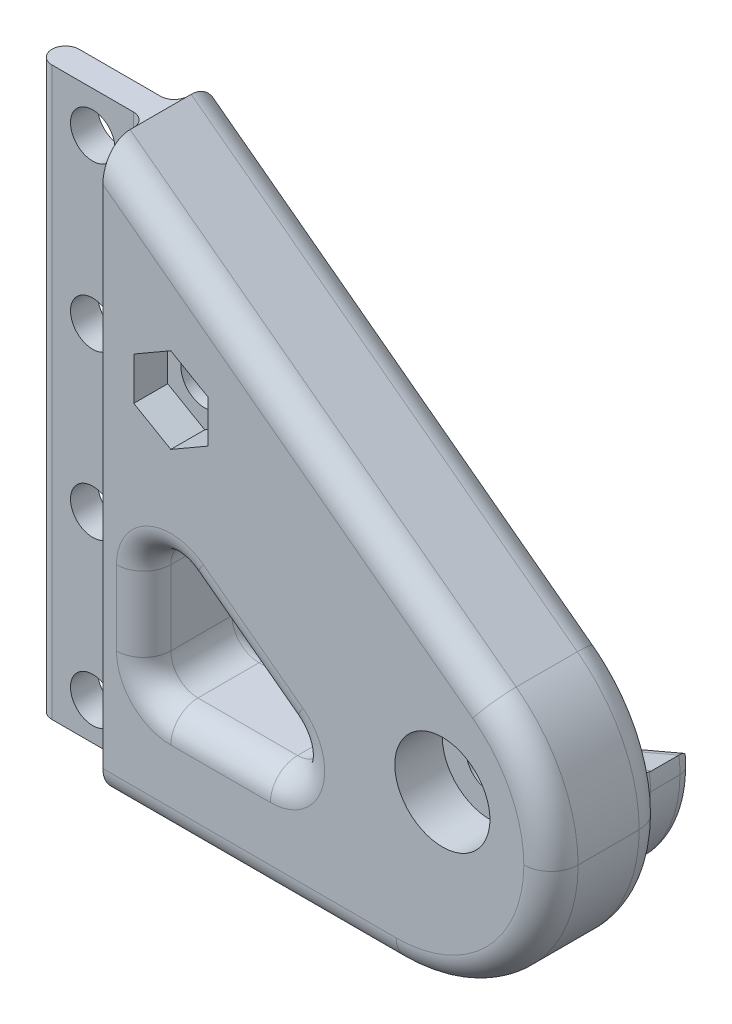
ISO-10303-21;
HEADER;
FILE_DESCRIPTION(('STEP AP214'),'2;1');
FILE_NAME('part.step','',(''),(''),'','','');
FILE_SCHEMA(('AUTOMOTIVE_DESIGN { 1 0 10303 214 1 1 1 1 }'));
ENDSEC;
DATA;
#1=APPLICATION_CONTEXT('core data for automotive mechanical design processes');
#2=APPLICATION_PROTOCOL_DEFINITION('international standard','automotive_design',2000,#1);
#3=PRODUCT_CONTEXT('',#1,'mechanical');
#4=PRODUCT('Part','Part','',(#3));
#5=PRODUCT_RELATED_PRODUCT_CATEGORY('part','',(#4));
#6=PRODUCT_DEFINITION_FORMATION('','',#4);
#7=PRODUCT_DEFINITION_CONTEXT('part definition',#1,'design');
#8=PRODUCT_DEFINITION('design','',#6,#7);
#9=PRODUCT_DEFINITION_SHAPE('','',#8);
#10=(LENGTH_UNIT() NAMED_UNIT(*) SI_UNIT(.MILLI.,.METRE.));
#11=(NAMED_UNIT(*) PLANE_ANGLE_UNIT() SI_UNIT($,.RADIAN.));
#12=(NAMED_UNIT(*) SI_UNIT($,.STERADIAN.) SOLID_ANGLE_UNIT());
#13=UNCERTAINTY_MEASURE_WITH_UNIT(LENGTH_MEASURE(1.E-05),#10,'distance_accuracy_value','');
#14=(GEOMETRIC_REPRESENTATION_CONTEXT(3) GLOBAL_UNCERTAINTY_ASSIGNED_CONTEXT((#13)) GLOBAL_UNIT_ASSIGNED_CONTEXT((#10,
#11,#12)) REPRESENTATION_CONTEXT('',''));
#15=CARTESIAN_POINT('',(0.,0.,0.));
#16=DIRECTION('',(0.,0.,1.));
#17=DIRECTION('',(1.,0.,0.));
#18=AXIS2_PLACEMENT_3D('',#15,#16,#17);
#19=CARTESIAN_POINT('',(0.,0.,-8.5));
#20=DIRECTION('',(0.,0.,1.));
#21=DIRECTION('',(-1.,0.,0.));
#22=AXIS2_PLACEMENT_3D('',#19,#20,#21);
#23=PLANE('',#22);
#24=CARTESIAN_POINT('',(-20.,0.999999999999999,-8.5));
#25=DIRECTION('',(0.,0.,1.));
#26=DIRECTION('',(1.,0.,0.));
#27=AXIS2_PLACEMENT_3D('',#24,#25,#26);
#28=CIRCLE('',#27,3.5);
#29=CARTESIAN_POINT('',(-16.5,0.999999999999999,-8.5));
#30=VERTEX_POINT('',#29);
#31=EDGE_CURVE('E1629',#30,#30,#28,.T.);
#32=ORIENTED_EDGE('',*,*,#31,.T.);
#33=EDGE_LOOP('',(#32));
#34=FACE_BOUND('',#33,.T.);
#35=DIRECTION('',(0.,-1.,0.));
#36=VECTOR('',#35,1.);
#37=CARTESIAN_POINT('',(-24.,-7.50000000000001,-8.5));
#38=LINE('',#37,#36);
#39=CARTESIAN_POINT('',(-24.,-17.,-8.5));
#40=VERTEX_POINT('',#39);
#41=CARTESIAN_POINT('',(-24.,-11.5,-8.5));
#42=VERTEX_POINT('',#41);
#43=EDGE_CURVE('E724',#40,#42,#38,.F.);
#44=ORIENTED_EDGE('',*,*,#43,.F.);
#45=CARTESIAN_POINT('',(-20.,-17.,-8.5));
#46=DIRECTION('',(0.,0.,-1.));
#47=DIRECTION('',(-1.,0.,0.));
#48=AXIS2_PLACEMENT_3D('',#45,#46,#47);
#49=CIRCLE('',#48,4.);
#50=CARTESIAN_POINT('',(-20.,-21.,-8.5));
#51=VERTEX_POINT('',#50);
#52=EDGE_CURVE('E712',#40,#51,#49,.F.);
#53=ORIENTED_EDGE('',*,*,#52,.T.);
#54=DIRECTION('',(1.,0.,0.));
#55=VECTOR('',#54,1.);
#56=CARTESIAN_POINT('',(-22.,-21.,-8.5));
#57=LINE('',#56,#55);
#58=CARTESIAN_POINT('',(-12.6666666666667,-21.,-8.5));
#59=VERTEX_POINT('',#58);
#60=EDGE_CURVE('E716',#59,#51,#57,.F.);
#61=ORIENTED_EDGE('',*,*,#60,.F.);
#62=CARTESIAN_POINT('',(-12.6666666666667,-17.,-8.5));
#63=DIRECTION('',(0.,0.,-1.));
#64=DIRECTION('',(-1.,0.,0.));
#65=AXIS2_PLACEMENT_3D('',#62,#63,#64);
#66=CIRCLE('',#65,4.);
#67=CARTESIAN_POINT('',(-10.2666666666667,-13.8,-8.5));
#68=VERTEX_POINT('',#67);
#69=EDGE_CURVE('E805',#68,#59,#66,.T.);
#70=ORIENTED_EDGE('',*,*,#69,.F.);
#71=DIRECTION('',(-0.8,0.6,0.));
#72=VECTOR('',#71,1.);
#73=CARTESIAN_POINT('',(-5.46666666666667,-17.4,-8.5));
#74=LINE('',#73,#72);
#75=CARTESIAN_POINT('',(-17.6,-8.30000000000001,-8.5));
#76=VERTEX_POINT('',#75);
#77=EDGE_CURVE('E727',#76,#68,#74,.F.);
#78=ORIENTED_EDGE('',*,*,#77,.F.);
#79=CARTESIAN_POINT('',(-20.,-11.5,-8.5));
#80=DIRECTION('',(0.,0.,-1.));
#81=DIRECTION('',(-1.,0.,0.));
#82=AXIS2_PLACEMENT_3D('',#79,#80,#81);
#83=CIRCLE('',#82,4.);
#84=EDGE_CURVE('E811',#42,#76,#83,.T.);
#85=ORIENTED_EDGE('',*,*,#84,.F.);
#86=EDGE_LOOP('',(#44,#53,#61,#70,#78,#85));
#87=FACE_BOUND('',#86,.T.);
#88=DIRECTION('',(-0.119615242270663,-0.992820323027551,0.));
#89=VECTOR('',#88,1.);
#90=CARTESIAN_POINT('',(-2.51724717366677,-12.1120646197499,-8.5));
#91=LINE('',#90,#89);
#92=CARTESIAN_POINT('',(-2.51724717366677,-12.1120646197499,-8.5));
#93=VERTEX_POINT('',#92);
#94=CARTESIAN_POINT('',(-2.89362358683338,-15.236032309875,-8.5));
#95=VERTEX_POINT('',#94);
#96=EDGE_CURVE('E1626',#93,#95,#91,.T.);
#97=ORIENTED_EDGE('',*,*,#96,.T.);
#98=DIRECTION('',(-0.8,0.599999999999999,0.));
#99=VECTOR('',#98,1.);
#100=CARTESIAN_POINT('',(-2.89362358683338,-15.236032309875,-8.5));
#101=LINE('',#100,#99);
#102=CARTESIAN_POINT('',(-4.79926216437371,-13.8068033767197,-8.5));
#103=VERTEX_POINT('',#102);
#104=EDGE_CURVE('E59',#95,#103,#101,.T.);
#105=ORIENTED_EDGE('',*,*,#104,.T.);
#106=DIRECTION('',(0.474206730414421,-0.880413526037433,0.));
#107=VECTOR('',#106,1.);
#108=CARTESIAN_POINT('',(-4.28664963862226,-14.7585212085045,-8.5));
#109=LINE('',#108,#107);
#110=CARTESIAN_POINT('',(-3.77403711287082,-15.7102390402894,-8.5));
#111=VERTEX_POINT('',#110);
#112=EDGE_CURVE('E535',#103,#111,#109,.T.);
#113=ORIENTED_EDGE('',*,*,#112,.T.);
#114=DIRECTION('',(-0.474206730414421,0.880413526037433,0.));
#115=VECTOR('',#114,1.);
#116=CARTESIAN_POINT('',(0.711935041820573,-24.0389073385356,-8.5));
#117=LINE('',#116,#115);
#118=CARTESIAN_POINT('',(0.926687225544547,-24.4376168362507,-8.5));
#119=VERTEX_POINT('',#118);
#120=EDGE_CURVE('E533',#111,#119,#117,.F.);
#121=ORIENTED_EDGE('',*,*,#120,.T.);
#122=CARTESIAN_POINT('',(-3.4,-15.6,-8.5));
#123=DIRECTION('',(0.,0.,-1.));
#124=DIRECTION('',(-1.,0.,0.));
#125=AXIS2_PLACEMENT_3D('',#122,#123,#124);
#126=CIRCLE('',#125,9.83990313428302);
#127=CARTESIAN_POINT('',(-0.490757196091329,-25.,-8.5));
#128=VERTEX_POINT('',#127);
#129=EDGE_CURVE('E540',#119,#128,#126,.T.);
#130=ORIENTED_EDGE('',*,*,#129,.T.);
#131=DIRECTION('',(1.,0.,0.));
#132=VECTOR('',#131,1.);
#133=CARTESIAN_POINT('',(0.,-25.,-8.5));
#134=LINE('',#133,#132);
#135=CARTESIAN_POINT('',(-25.,-25.,-8.5));
#136=VERTEX_POINT('',#135);
#137=EDGE_CURVE('E707',#136,#128,#134,.T.);
#138=ORIENTED_EDGE('',*,*,#137,.F.);
#139=DIRECTION('',(0.,-1.,0.));
#140=VECTOR('',#139,1.);
#141=CARTESIAN_POINT('',(-25.,-27.,-8.5));
#142=LINE('',#141,#140);
#143=CARTESIAN_POINT('',(-25.,12.25,-8.5));
#144=VERTEX_POINT('',#143);
#145=EDGE_CURVE('E1651',#144,#136,#142,.T.);
#146=ORIENTED_EDGE('',*,*,#145,.F.);
#147=DIRECTION('',(-0.8,0.6,0.));
#148=VECTOR('',#147,1.);
#149=CARTESIAN_POINT('',(-3.12,-4.16,-8.5));
#150=LINE('',#149,#148);
#151=CARTESIAN_POINT('',(1.00183224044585,-7.25137418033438,-8.5));
#152=VERTEX_POINT('',#151);
#153=EDGE_CURVE('E713',#152,#144,#150,.T.);
#154=ORIENTED_EDGE('',*,*,#153,.F.);
#155=CARTESIAN_POINT('',(6.37399216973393,-17.9305267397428,-8.39974447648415));
#156=CARTESIAN_POINT('',(5.71151803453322,-17.7461583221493,-8.62582534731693));
#157=CARTESIAN_POINT('',(5.71418515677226,-17.7364014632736,-9.34961671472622));
#158=CARTESIAN_POINT('',(6.43599160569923,-17.691361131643,-8.39736665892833));
#159=CARTESIAN_POINT('',(5.77175011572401,-17.5270630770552,-8.6251775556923));
#160=CARTESIAN_POINT('',(5.77401244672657,-17.5176239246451,-9.34604998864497));
#161=CARTESIAN_POINT('',(6.48824427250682,-17.4497717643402,-8.39523872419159));
#162=CARTESIAN_POINT('',(5.82276310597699,-17.3049808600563,-8.62454160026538));
#163=CARTESIAN_POINT('',(5.82457916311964,-17.2963203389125,-9.34285808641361));
#164=CARTESIAN_POINT('',(6.5730414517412,-16.9632995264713,-8.39153768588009));
#165=CARTESIAN_POINT('',(5.90582589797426,-16.8573980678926,-8.62337542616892));
#166=CARTESIAN_POINT('',(5.90692961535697,-16.8502474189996,-9.33730652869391));
#167=CARTESIAN_POINT('',(6.60558685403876,-16.7184168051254,-8.38996455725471));
#168=CARTESIAN_POINT('',(5.93794457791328,-16.6317507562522,-8.62284458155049));
#169=CARTESIAN_POINT('',(5.9387141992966,-16.6254782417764,-9.33494683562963));
#170=CARTESIAN_POINT('',(6.65074214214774,-16.2270900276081,-8.38742900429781));
#171=CARTESIAN_POINT('',(5.98292290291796,-16.1788221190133,-8.62196762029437));
#172=CARTESIAN_POINT('',(5.98322588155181,-16.1742241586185,-9.33114350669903));
#173=CARTESIAN_POINT('',(6.66336823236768,-15.9806474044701,-8.38646608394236));
#174=CARTESIAN_POINT('',(5.99584033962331,-15.9513886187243,-8.62162079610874));
#175=CARTESIAN_POINT('',(5.99596847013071,-15.9477407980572,-9.32969912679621));
#176=CARTESIAN_POINT('',(6.66869596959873,-15.4876589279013,-8.38517762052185));
#177=CARTESIAN_POINT('',(6.00243164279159,-15.4964398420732,-8.62115225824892));
#178=CARTESIAN_POINT('',(6.00238161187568,-15.4945650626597,-9.32776643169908));
#179=CARTESIAN_POINT('',(6.66139788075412,-15.2411130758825,-8.38485206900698));
#180=CARTESIAN_POINT('',(5.9961213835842,-15.268767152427,-8.62103022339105));
#181=CARTESIAN_POINT('',(5.9960524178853,-15.2678726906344,-9.32727810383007));
#182=CARTESIAN_POINT('',(6.60959034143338,-14.5033937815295,-8.38485572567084));
#183=CARTESIAN_POINT('',(5.94827975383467,-14.5878516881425,-8.62103497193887));
#184=CARTESIAN_POINT('',(5.94841764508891,-14.5896401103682,-9.32728358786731));
#185=CARTESIAN_POINT('',(6.53518579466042,-14.0139391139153,-8.38616419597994));
#186=CARTESIAN_POINT('',(5.87776915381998,-14.1355827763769,-8.62153247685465));
#187=CARTESIAN_POINT('',(5.87848281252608,-14.1397609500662,-9.32924629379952));
#188=CARTESIAN_POINT('',(6.3084477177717,-13.0534063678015,-8.39123535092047));
#189=CARTESIAN_POINT('',(5.66212590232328,-13.2510595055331,-8.62328361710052));
#190=CARTESIAN_POINT('',(5.66421878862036,-13.2584204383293,-9.33685302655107));
#191=CARTESIAN_POINT('',(6.15612325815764,-12.582326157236,-8.39499774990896));
#192=CARTESIAN_POINT('',(5.51649428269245,-12.817628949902,-8.62454170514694));
#193=CARTESIAN_POINT('',(5.51989825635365,-12.8269569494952,-9.34249662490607));
#194=CARTESIAN_POINT('',(5.7771069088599,-11.6699159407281,-8.40449394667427));
#195=CARTESIAN_POINT('',(5.15527387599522,-11.9824845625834,-8.62711689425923));
#196=CARTESIAN_POINT('',(5.16088231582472,-11.9940569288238,-9.35674091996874));
#197=CARTESIAN_POINT('',(5.55037208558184,-11.228603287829,-8.41022888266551));
#198=CARTESIAN_POINT('',(4.93875459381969,-11.5798152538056,-8.62843791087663));
#199=CARTESIAN_POINT('',(4.94614627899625,-11.5926378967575,-9.36534332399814));
#200=CARTESIAN_POINT('',(5.02794652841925,-10.3875028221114,-8.42293342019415));
#201=CARTESIAN_POINT('',(4.44253996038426,-10.817784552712,-8.63008084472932));
#202=CARTESIAN_POINT('',(4.45239381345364,-10.831533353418,-9.38440013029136));
#203=CARTESIAN_POINT('',(4.73225489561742,-9.9877155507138,-8.42990303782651));
#204=CARTESIAN_POINT('',(4.16163319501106,-10.4577488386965,-8.63039656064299));
#205=CARTESIAN_POINT('',(4.17337654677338,-10.4718483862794,-9.39485455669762));
#206=CARTESIAN_POINT('',(4.07877655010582,-9.2398805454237,-8.44417515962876));
#207=CARTESIAN_POINT('',(3.54500824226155,-9.79050422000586,-8.62872847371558));
#208=CARTESIAN_POINT('',(3.55877686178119,-9.80410561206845,-9.41626273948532));
#209=CARTESIAN_POINT('',(3.72093699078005,-8.89187731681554,-8.45147794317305));
#210=CARTESIAN_POINT('',(3.20780224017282,-9.48305271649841,-8.62671441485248));
#211=CARTESIAN_POINT('',(3.22314631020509,-9.49609218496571,-9.42721691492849));
#212=CARTESIAN_POINT('',(2.95156983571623,-8.25729949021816,-8.46542792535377));
#213=CARTESIAN_POINT('',(2.48851786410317,-8.92936101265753,-8.61895364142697));
#214=CARTESIAN_POINT('',(2.50465905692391,-8.94064701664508,-9.44814188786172));
#215=CARTESIAN_POINT('',(2.5400366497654,-7.97073129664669,-8.47207505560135));
#216=CARTESIAN_POINT('',(2.10485630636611,-8.68327674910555,-8.61314320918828));
#217=CARTESIAN_POINT('',(2.12179743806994,-8.69322159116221,-9.45811258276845));
#218=CARTESIAN_POINT('',(1.890733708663,-7.59346594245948,-8.48081663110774));
#219=CARTESIAN_POINT('',(1.50731414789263,-8.36630348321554,-8.60064906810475));
#220=CARTESIAN_POINT('',(1.52092221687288,-8.37308655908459,-9.47122494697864));
#221=CARTESIAN_POINT('',(1.66888774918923,-7.47644565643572,-8.48352632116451));
#222=CARTESIAN_POINT('',(1.30284141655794,-8.26876166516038,-8.59580616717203));
#223=CARTESIAN_POINT('',(1.31612868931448,-8.27485162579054,-9.47528948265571));
#224=CARTESIAN_POINT('',(1.21567782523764,-7.26066241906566,-8.48842686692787));
#225=CARTESIAN_POINT('',(0.886773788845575,-8.09111762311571,-8.58466340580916));
#226=CARTESIAN_POINT('',(0.898932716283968,-8.09593720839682,-9.48264030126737));
#227=CARTESIAN_POINT('',(0.984313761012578,-7.16189965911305,-8.49061771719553));
#228=CARTESIAN_POINT('',(0.67498765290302,-8.0111235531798,-8.57834668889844));
#229=CARTESIAN_POINT('',(0.68653019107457,-8.01525790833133,-9.48592657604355));
#230=CARTESIAN_POINT('',(0.513372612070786,-6.98341089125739,-8.49437473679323));
#231=CARTESIAN_POINT('',(0.245697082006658,-7.86907164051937,-8.56409208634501));
#232=CARTESIAN_POINT('',(0.255504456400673,-7.87202860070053,-9.49156210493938));
#233=CARTESIAN_POINT('',(0.273788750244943,-6.90370104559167,-8.49594037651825));
#234=CARTESIAN_POINT('',(0.0280097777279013,-7.80716861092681,-8.55613258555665));
#235=CARTESIAN_POINT('',(0.0368761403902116,-7.80949397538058,-9.49391056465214));
#236=CARTESIAN_POINT('',(-0.211906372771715,-6.76408020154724,-8.49835239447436));
#237=CARTESIAN_POINT('',(-0.411413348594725,-7.70167142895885,-8.53846123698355));
#238=CARTESIAN_POINT('',(-0.404888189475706,-7.70305223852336,-9.49752859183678));
#239=CARTESIAN_POINT('',(-0.458017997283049,-6.70417030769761,-8.49919873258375));
#240=CARTESIAN_POINT('',(-0.633314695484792,-7.65824564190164,-8.52872557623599));
#241=CARTESIAN_POINT('',(-0.628024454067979,-7.65914616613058,-9.49879809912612));
#242=CARTESIAN_POINT('',(-0.706629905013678,-6.6544920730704,-8.49963935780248));
#243=CARTESIAN_POINT('',(-0.855155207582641,-7.62437481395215,-8.51809949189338));
#244=CARTESIAN_POINT('',(-0.85263181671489,-7.6247613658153,-9.49945903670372));
#245=(BOUNDED_SURFACE() B_SPLINE_SURFACE(3,2,((#155,#156,#157),(#158,#159,#160),(#161,#162,
#163),(#164,#165,#166),(#167,#168,#169),(#170,#171,#172),(#173,#174,#175),(#176,#177,#178),
(#179,#180,#181),(#182,#183,#184),(#185,#186,#187),(#188,#189,#190),(#191,#192,#193),(#194,#195,
#196),(#197,#198,#199),(#200,#201,#202),(#203,#204,#205),(#206,#207,#208),(#209,#210,#211),
(#212,#213,#214),(#215,#216,#217),(#218,#219,#220),(#221,#222,#223),(#224,#225,#226),(#227,#228,
#229),(#230,#231,#232),(#233,#234,#235),(#236,#237,#238),(#239,#240,#241),(#242,#243,#244)),
.UNSPECIFIED.,.F.,.F.,.F.) B_SPLINE_SURFACE_WITH_KNOTS((4,2,2,2,2,2,2,2,2,2,2,2,2,2,4),(3,3),
(0.,0.764517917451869,1.52900131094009,2.29286247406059,3.05671351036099,4.58380181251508,
6.11071238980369,7.63850552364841,9.16631857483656,10.6954371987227,12.2247151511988,
12.989854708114,13.7550022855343,14.5207966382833,15.2866337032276),(0.,1.),
.UNSPECIFIED.) GEOMETRIC_REPRESENTATION_ITEM() RATIONAL_B_SPLINE_SURFACE(((1.,0.810048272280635,
1.),(1.,0.811174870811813,1.),(1.,0.812162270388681,1.),(1.,0.813856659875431,1.),(1.,
0.81456366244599,1.),(1.,0.815694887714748,1.),(1.,0.816119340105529,1.),(1.,0.816685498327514,
1.),(1.,0.81682720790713,1.),(1.,0.816826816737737,1.),(1.,0.816259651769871,1.),(1.,
0.813996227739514,1.),(1.,0.812300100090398,1.),(1.,0.80779514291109,1.),(1.,0.804985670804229,
1.),(1.,0.798282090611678,1.),(1.,0.794387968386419,1.),(1.,0.785552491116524,1.),(1.,
0.780610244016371,1.),(1.,0.769727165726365,1.),(1.,0.763786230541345,1.),(1.,0.754186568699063,
1.),(1.,0.750870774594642,1.),(1.,0.744016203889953,1.),(1.,0.740477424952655,1.),(1.,
0.733185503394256,1.),(1.,0.729432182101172,1.),(1.,0.721725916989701,1.),(1.,0.71777296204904,
1.),(1.,0.713726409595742,1.))) REPRESENTATION_ITEM('') SURFACE());
#246=CARTESIAN_POINT('',(1.00183224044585,-7.25137418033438,-8.5));
#247=CARTESIAN_POINT('',(1.30810808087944,-7.3901913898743,-8.5));
#248=CARTESIAN_POINT('',(1.60681841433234,-7.54576978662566,-8.5));
#249=CARTESIAN_POINT('',(2.18511506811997,-7.88793305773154,-8.5));
#250=CARTESIAN_POINT('',(2.46473838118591,-8.07445540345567,-8.5));
#251=CARTESIAN_POINT('',(2.93939378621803,-8.42962745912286,-8.5));
#252=CARTESIAN_POINT('',(3.13893474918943,-8.59228459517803,-8.5));
#253=CARTESIAN_POINT('',(3.52401798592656,-8.9337267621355,-8.5));
#254=CARTESIAN_POINT('',(3.70954537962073,-9.11252850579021,-8.5));
#255=CARTESIAN_POINT('',(4.24667105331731,-9.67524074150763,-8.5));
#256=CARTESIAN_POINT('',(4.57456917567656,-10.0822843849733,-8.5));
#257=CARTESIAN_POINT('',(5.15728873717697,-10.9459850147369,-8.5));
#258=CARTESIAN_POINT('',(5.41207869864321,-11.4026632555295,-8.5));
#259=CARTESIAN_POINT('',(5.72740205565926,-12.1009470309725,-8.5));
#260=CARTESIAN_POINT('',(5.81945567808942,-12.3287396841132,-8.5));
#261=CARTESIAN_POINT('',(5.98483404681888,-12.7903673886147,-8.5));
#262=CARTESIAN_POINT('',(6.05820609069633,-13.0241854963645,-8.5));
#263=CARTESIAN_POINT('',(6.12213472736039,-13.2606702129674,-8.5));
#264=B_SPLINE_CURVE_WITH_KNOTS('',3,(#246,#247,#248,#249,#250,#251,#252,#253,#254,#255,#256,
#257,#258,#259,#260,#261,#262,#263),.UNSPECIFIED.,.F.,.F.,(4,2,2,2,2,2,2,2,4),(0.,
1.00837570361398,2.0147380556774,2.78616980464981,3.55840949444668,5.1185872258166,
6.67943570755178,7.41582516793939,8.15033128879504),.UNSPECIFIED.);
#265=CARTESIAN_POINT('',(6.12213472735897,-13.260670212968,-8.5));
#266=VERTEX_POINT('',#265);
#267=EDGE_CURVE('E401',#152,#266,#264,.T.);
#268=ORIENTED_EDGE('',*,*,#267,.T.);
#269=DIRECTION('',(0.919615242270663,0.392820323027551,0.));
#270=VECTOR('',#269,1.);
#271=CARTESIAN_POINT('',(2.12442685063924,-14.9683201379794,-8.5));
#272=LINE('',#271,#270);
#273=CARTESIAN_POINT('',(2.65536695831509,-14.7415252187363,-8.5));
#274=VERTEX_POINT('',#273);
#275=EDGE_CURVE('E405',#266,#274,#272,.F.);
#276=ORIENTED_EDGE('',*,*,#275,.T.);
#277=DIRECTION('',(0.119615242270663,0.992820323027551,0.));
#278=VECTOR('',#277,1.);
#279=CARTESIAN_POINT('',(2.51724717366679,-15.8879353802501,-8.5));
#280=LINE('',#279,#278);
#281=CARTESIAN_POINT('',(2.8936235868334,-12.763967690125,-8.5));
#282=VERTEX_POINT('',#281);
#283=EDGE_CURVE('E1694',#274,#282,#280,.T.);
#284=ORIENTED_EDGE('',*,*,#283,.T.);
#285=DIRECTION('',(-0.8,0.6,0.));
#286=VECTOR('',#285,1.);
#287=CARTESIAN_POINT('',(2.8936235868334,-12.763967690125,-8.5));
#288=LINE('',#287,#286);
#289=CARTESIAN_POINT('',(0.376376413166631,-10.876032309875,-8.5));
#290=VERTEX_POINT('',#289);
#291=EDGE_CURVE('E1690',#282,#290,#288,.T.);
#292=ORIENTED_EDGE('',*,*,#291,.T.);
#293=DIRECTION('',(-0.919615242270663,-0.392820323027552,0.));
#294=VECTOR('',#293,1.);
#295=CARTESIAN_POINT('',(0.376376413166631,-10.876032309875,-8.5));
#296=LINE('',#295,#294);
#297=EDGE_CURVE('E1622',#290,#93,#296,.T.);
#298=ORIENTED_EDGE('',*,*,#297,.T.);
#299=EDGE_LOOP('',(#97,#105,#113,#121,#130,#138,#146,#154,#268,#276,#284,#292,#298));
#300=FACE_BOUND('',#299,.T.);
#301=ADVANCED_FACE('F39',(#34,#87,#300),#23,.F.);
#302=CARTESIAN_POINT('',(-3.4,-15.7,-6.5));
#303=DIRECTION('',(0.,0.,1.));
#304=DIRECTION('',(-1.,0.,0.));
#305=AXIS2_PLACEMENT_3D('',#302,#303,#304);
#306=TOROIDAL_SURFACE('',#305,9.4,2.);
#307=CARTESIAN_POINT('',(7.99989035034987,-15.6499999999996,-6.5));
#308=CARTESIAN_POINT('',(7.9998899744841,-15.6499999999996,-6.55626695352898));
#309=CARTESIAN_POINT('',(7.9975143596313,-15.6499999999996,-6.61250694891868));
#310=CARTESIAN_POINT('',(7.98803706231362,-15.6499999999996,-6.72458453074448));
#311=CARTESIAN_POINT('',(7.98093560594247,-15.6499999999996,-6.78042213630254));
#312=CARTESIAN_POINT('',(7.95260849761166,-15.6499999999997,-6.94664218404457));
#313=CARTESIAN_POINT('',(7.92435992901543,-15.6499999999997,-7.05591113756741));
#314=CARTESIAN_POINT('',(7.84991933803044,-15.6499999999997,-7.26815232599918));
#315=CARTESIAN_POINT('',(7.80371867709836,-15.6499999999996,-7.37112150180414));
#316=CARTESIAN_POINT('',(7.6946945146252,-15.6499999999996,-7.56783084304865));
#317=CARTESIAN_POINT('',(7.63187524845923,-15.6499999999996,-7.66157335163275));
#318=CARTESIAN_POINT('',(7.49139954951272,-15.6499999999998,-7.83717230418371));
#319=CARTESIAN_POINT('',(7.41374423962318,-15.6499999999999,-7.91902964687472));
#320=CARTESIAN_POINT('',(7.24575633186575,-15.6499999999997,-8.06858099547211));
#321=CARTESIAN_POINT('',(7.1554185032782,-15.6499999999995,-8.13626912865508));
#322=CARTESIAN_POINT('',(6.96463529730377,-15.6499999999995,-8.25553841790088));
#323=CARTESIAN_POINT('',(6.86418571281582,-15.6499999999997,-8.3071128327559));
#324=CARTESIAN_POINT('',(6.65611961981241,-15.6499999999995,-8.39260655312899));
#325=CARTESIAN_POINT('',(6.54851207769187,-15.6499999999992,-8.42654749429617));
#326=CARTESIAN_POINT('',(6.38100627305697,-15.6499999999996,-8.46424960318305));
#327=CARTESIAN_POINT('',(6.32253075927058,-15.6499999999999,-8.4746952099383));
#328=CARTESIAN_POINT('',(6.20493145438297,-15.6499999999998,-8.49034081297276));
#329=CARTESIAN_POINT('',(6.14580852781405,-15.6499999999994,-8.49554710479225));
#330=CARTESIAN_POINT('',(6.05769318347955,-15.6499999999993,-8.49937392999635));
#331=CARTESIAN_POINT('',(6.0287769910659,-15.6499999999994,-8.50000175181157));
#332=CARTESIAN_POINT('',(5.99986702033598,-15.6499999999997,-8.5));
#333=B_SPLINE_CURVE_WITH_KNOTS('',3,(#307,#308,#309,#310,#311,#312,#313,#314,#315,#316,#317,
#318,#319,#320,#321,#322,#323,#324,#325,#326,#327,#328,#329,#330,#331,#332),.UNSPECIFIED.,.F.,
.F.,(4,2,2,2,2,2,2,2,2,2,2,2,4),(0.,0.168697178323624,0.337386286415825,0.674233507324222,
1.01124302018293,1.34816672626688,1.6850649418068,2.02210251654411,2.35928090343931,
2.69604460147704,2.87405429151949,3.05184982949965,3.13858877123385),.UNSPECIFIED.);
#334=CARTESIAN_POINT('',(7.99989035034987,-15.6499999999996,-6.5));
#335=VERTEX_POINT('',#334);
#336=CARTESIAN_POINT('',(6.66654768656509,-15.6499999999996,-8.38561624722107));
#337=VERTEX_POINT('',#336);
#338=EDGE_CURVE('E586',#335,#337,#333,.T.);
#339=ORIENTED_EDGE('',*,*,#338,.T.);
#340=CARTESIAN_POINT('',(6.37399216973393,-17.9305267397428,-8.39974447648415));
#341=CARTESIAN_POINT('',(6.43599160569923,-17.691361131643,-8.39736665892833));
#342=CARTESIAN_POINT('',(6.48824427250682,-17.4497717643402,-8.39523872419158));
#343=CARTESIAN_POINT('',(6.5730414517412,-16.9632995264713,-8.39153768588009));
#344=CARTESIAN_POINT('',(6.60558685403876,-16.7184168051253,-8.38996455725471));
#345=CARTESIAN_POINT('',(6.65074214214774,-16.2270900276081,-8.38742900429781));
#346=CARTESIAN_POINT('',(6.66336823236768,-15.9806474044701,-8.38646608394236));
#347=CARTESIAN_POINT('',(6.66869596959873,-15.4876589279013,-8.38517762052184));
#348=CARTESIAN_POINT('',(6.66139788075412,-15.2411130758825,-8.38485206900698));
#349=CARTESIAN_POINT('',(6.60959034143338,-14.5033937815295,-8.38485572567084));
#350=CARTESIAN_POINT('',(6.53518579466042,-14.0139391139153,-8.38616419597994));
#351=CARTESIAN_POINT('',(6.3084477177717,-13.0534063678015,-8.39123535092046));
#352=CARTESIAN_POINT('',(6.15612325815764,-12.5823261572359,-8.39499774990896));
#353=CARTESIAN_POINT('',(5.7771069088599,-11.6699159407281,-8.40449394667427));
#354=CARTESIAN_POINT('',(5.55037208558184,-11.228603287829,-8.41022888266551));
#355=CARTESIAN_POINT('',(5.02794652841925,-10.3875028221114,-8.42293342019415));
#356=CARTESIAN_POINT('',(4.73225489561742,-9.9877155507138,-8.42990303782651));
#357=CARTESIAN_POINT('',(4.07877655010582,-9.2398805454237,-8.44417515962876));
#358=CARTESIAN_POINT('',(3.72093699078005,-8.89187731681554,-8.45147794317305));
#359=CARTESIAN_POINT('',(2.95156983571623,-8.25729949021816,-8.46542792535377));
#360=CARTESIAN_POINT('',(2.5400366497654,-7.97073129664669,-8.47207505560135));
#361=CARTESIAN_POINT('',(1.890733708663,-7.59346594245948,-8.48081663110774));
#362=CARTESIAN_POINT('',(1.66888774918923,-7.47644565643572,-8.48352632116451));
#363=CARTESIAN_POINT('',(1.21567782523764,-7.26066241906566,-8.48842686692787));
#364=CARTESIAN_POINT('',(0.984313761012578,-7.16189965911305,-8.49061771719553));
#365=CARTESIAN_POINT('',(0.513372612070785,-6.98341089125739,-8.49437473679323));
#366=CARTESIAN_POINT('',(0.273788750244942,-6.90370104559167,-8.49594037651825));
#367=CARTESIAN_POINT('',(-0.211906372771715,-6.76408020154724,-8.49835239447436));
#368=CARTESIAN_POINT('',(-0.45801799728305,-6.70417030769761,-8.49919873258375));
#369=CARTESIAN_POINT('',(-0.706629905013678,-6.6544920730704,-8.49963935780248));
#370=B_SPLINE_CURVE_WITH_KNOTS('',3,(#340,#341,#342,#343,#344,#345,#346,#347,#348,#349,#350,
#351,#352,#353,#354,#355,#356,#357,#358,#359,#360,#361,#362,#363,#364,#365,#366,#367,#368,#369),
.UNSPECIFIED.,.F.,.F.,(4,2,2,2,2,2,2,2,2,2,2,2,2,2,4),(0.,0.764517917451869,1.52900131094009,
2.29286247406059,3.05671351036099,4.58380181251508,6.11071238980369,7.63850552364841,
9.16631857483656,10.6954371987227,12.2247151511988,12.989854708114,13.7550022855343,
14.5207966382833,15.2866337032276),.UNSPECIFIED.);
#371=CARTESIAN_POINT('',(2.43552682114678,-7.91929757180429,-8.4732722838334));
#372=VERTEX_POINT('',#371);
#373=EDGE_CURVE('E475',#337,#372,#370,.T.);
#374=ORIENTED_EDGE('',*,*,#373,.T.);
#375=CARTESIAN_POINT('',(2.24,-8.17999999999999,-6.5));
#376=DIRECTION('',(-0.8,0.6,0.));
#377=DIRECTION('',(0.6,0.8,0.));
#378=AXIS2_PLACEMENT_3D('',#375,#376,#377);
#379=CIRCLE('',#378,2.);
#380=CARTESIAN_POINT('',(3.44,-6.57999999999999,-6.5));
#381=VERTEX_POINT('',#380);
#382=EDGE_CURVE('E588',#381,#372,#379,.T.);
#383=ORIENTED_EDGE('',*,*,#382,.F.);
#384=CARTESIAN_POINT('',(-3.4,-15.7,-6.5));
#385=DIRECTION('',(0.,0.,-1.));
#386=DIRECTION('',(-1.,0.,0.));
#387=AXIS2_PLACEMENT_3D('',#384,#385,#386);
#388=CIRCLE('',#387,11.4);
#389=EDGE_CURVE('E659',#381,#335,#388,.T.);
#390=ORIENTED_EDGE('',*,*,#389,.T.);
#391=EDGE_LOOP('',(#339,#374,#383,#390));
#392=FACE_BOUND('',#391,.T.);
#393=ADVANCED_FACE('F445',(#392),#306,.T.);
#394=CARTESIAN_POINT('',(-29.,-24.25,-8.6127419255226));
#395=DIRECTION('',(0.,0.,1.));
#396=DIRECTION('',(1.,0.,0.));
#397=AXIS2_PLACEMENT_3D('',#394,#395,#396);
#398=CYLINDRICAL_SURFACE('',#397,1.6363631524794);
#399=CARTESIAN_POINT('',(-29.,-24.25,-3.25));
#400=DIRECTION('',(0.,0.,1.));
#401=DIRECTION('',(1.,0.,0.));
#402=AXIS2_PLACEMENT_3D('',#399,#400,#401);
#403=CIRCLE('',#402,1.6363631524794);
#404=CARTESIAN_POINT('',(-27.3636368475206,-24.25,-3.25));
#405=VERTEX_POINT('',#404);
#406=EDGE_CURVE('E614',#405,#405,#403,.T.);
#407=ORIENTED_EDGE('',*,*,#406,.T.);
#408=EDGE_LOOP('',(#407));
#409=FACE_BOUND('',#408,.T.);
#410=CARTESIAN_POINT('',(-29.,-24.25,-5.24999999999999));
#411=DIRECTION('',(0.,0.,1.));
#412=DIRECTION('',(0.,-1.,0.));
#413=AXIS2_PLACEMENT_3D('',#410,#411,#412);
#414=CIRCLE('',#413,1.6363631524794);
#415=CARTESIAN_POINT('',(-29.,-25.8863631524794,-5.24999999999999));
#416=VERTEX_POINT('',#415);
#417=EDGE_CURVE('E617',#416,#416,#414,.T.);
#418=ORIENTED_EDGE('',*,*,#417,.F.);
#419=EDGE_LOOP('',(#418));
#420=FACE_BOUND('',#419,.T.);
#421=ADVANCED_FACE('F450',(#409,#420),#398,.F.);
#422=CARTESIAN_POINT('',(-29.,-12.25,-8.6127419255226));
#423=DIRECTION('',(0.,0.,1.));
#424=DIRECTION('',(1.,0.,0.));
#425=AXIS2_PLACEMENT_3D('',#422,#423,#424);
#426=CYLINDRICAL_SURFACE('',#425,1.6363631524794);
#427=CARTESIAN_POINT('',(-29.,-12.25,-3.25));
#428=DIRECTION('',(0.,0.,1.));
#429=DIRECTION('',(1.,0.,0.));
#430=AXIS2_PLACEMENT_3D('',#427,#428,#429);
#431=CIRCLE('',#430,1.6363631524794);
#432=CARTESIAN_POINT('',(-27.3636368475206,-12.25,-3.25));
#433=VERTEX_POINT('',#432);
#434=EDGE_CURVE('E592',#433,#433,#431,.T.);
#435=ORIENTED_EDGE('',*,*,#434,.T.);
#436=EDGE_LOOP('',(#435));
#437=FACE_BOUND('',#436,.T.);
#438=CARTESIAN_POINT('',(-29.,-12.25,-5.24999999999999));
#439=DIRECTION('',(0.,0.,1.));
#440=DIRECTION('',(0.,-1.,0.));
#441=AXIS2_PLACEMENT_3D('',#438,#439,#440);
#442=CIRCLE('',#441,1.6363631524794);
#443=CARTESIAN_POINT('',(-29.,-13.8863631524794,-5.24999999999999));
#444=VERTEX_POINT('',#443);
#445=EDGE_CURVE('E611',#444,#444,#442,.T.);
#446=ORIENTED_EDGE('',*,*,#445,.F.);
#447=EDGE_LOOP('',(#446));
#448=FACE_BOUND('',#447,.T.);
#449=ADVANCED_FACE('F1544',(#437,#448),#426,.F.);
#450=CARTESIAN_POINT('',(-25.,-27.,8.5));
#451=DIRECTION('',(1.,0.,0.));
#452=DIRECTION('',(0.,0.,-1.));
#453=AXIS2_PLACEMENT_3D('',#450,#451,#452);
#454=PLANE('',#453);
#455=DIRECTION('',(0.,0.,1.));
#456=VECTOR('',#455,1.);
#457=CARTESIAN_POINT('',(-25.,14.75,-8.5));
#458=LINE('',#457,#456);
#459=CARTESIAN_POINT('',(-25.,14.75,-2.25));
#460=VERTEX_POINT('',#459);
#461=CARTESIAN_POINT('',(-25.,14.75,-2.));
#462=VERTEX_POINT('',#461);
#463=EDGE_CURVE('E1645',#460,#462,#458,.T.);
#464=ORIENTED_EDGE('',*,*,#463,.F.);
#465=DIRECTION('',(0.,-1.,0.));
#466=VECTOR('',#465,1.);
#467=CARTESIAN_POINT('',(-25.,-27.,-2.25));
#468=LINE('',#467,#466);
#469=CARTESIAN_POINT('',(-25.,-27.,-2.25));
#470=VERTEX_POINT('',#469);
#471=EDGE_CURVE('E640',#460,#470,#468,.T.);
#472=ORIENTED_EDGE('',*,*,#471,.T.);
#473=DIRECTION('',(0.,0.,1.));
#474=VECTOR('',#473,1.);
#475=CARTESIAN_POINT('',(-25.,-27.,-8.5));
#476=LINE('',#475,#474);
#477=CARTESIAN_POINT('',(-25.,-27.,-2.));
#478=VERTEX_POINT('',#477);
#479=EDGE_CURVE('E1653',#470,#478,#476,.T.);
#480=ORIENTED_EDGE('',*,*,#479,.T.);
#481=CARTESIAN_POINT('',(-25.,-25.,-2.));
#482=DIRECTION('',(-1.,0.,0.));
#483=DIRECTION('',(0.,0.,1.));
#484=AXIS2_PLACEMENT_3D('',#481,#482,#483);
#485=CIRCLE('',#484,2.);
#486=CARTESIAN_POINT('',(-25.,-25.,0.));
#487=VERTEX_POINT('',#486);
#488=EDGE_CURVE('E771',#487,#478,#485,.F.);
#489=ORIENTED_EDGE('',*,*,#488,.F.);
#490=DIRECTION('',(0.,1.,0.));
#491=VECTOR('',#490,1.);
#492=CARTESIAN_POINT('',(-25.,-27.,0.));
#493=LINE('',#492,#491);
#494=CARTESIAN_POINT('',(-25.,12.25,0.));
#495=VERTEX_POINT('',#494);
#496=EDGE_CURVE('E607',#487,#495,#493,.T.);
#497=ORIENTED_EDGE('',*,*,#496,.T.);
#498=CARTESIAN_POINT('',(-25.,12.25,-2.));
#499=DIRECTION('',(-1.,0.,0.));
#500=DIRECTION('',(0.,-1.,0.));
#501=AXIS2_PLACEMENT_3D('',#498,#499,#500);
#502=ELLIPSE('',#501,2.5,2.);
#503=EDGE_CURVE('E768',#462,#495,#502,.F.);
#504=ORIENTED_EDGE('',*,*,#503,.F.);
#505=EDGE_LOOP('',(#464,#472,#480,#489,#497,#504));
#506=FACE_BOUND('',#505,.T.);
#507=ADVANCED_FACE('F1533',(#506),#454,.F.);
#508=CARTESIAN_POINT('',(-22.725,-0.573279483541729,2.5));
#509=DIRECTION('',(-1.,0.,0.));
#510=DIRECTION('',(0.,0.,1.));
#511=AXIS2_PLACEMENT_3D('',#508,#509,#510);
#512=PLANE('',#511);
#513=DIRECTION('',(0.,0.,-1.));
#514=VECTOR('',#513,1.);
#515=CARTESIAN_POINT('',(-22.725,2.57327948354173,2.5));
#516=LINE('',#515,#514);
#517=CARTESIAN_POINT('',(-22.725,2.57327948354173,0.));
#518=VERTEX_POINT('',#517);
#519=CARTESIAN_POINT('',(-22.725,2.57327948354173,-2.5));
#520=VERTEX_POINT('',#519);
#521=EDGE_CURVE('E601',#518,#520,#516,.T.);
#522=ORIENTED_EDGE('',*,*,#521,.F.);
#523=DIRECTION('',(0.,-1.,0.));
#524=VECTOR('',#523,1.);
#525=CARTESIAN_POINT('',(-22.725,-0.573279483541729,0.));
#526=LINE('',#525,#524);
#527=CARTESIAN_POINT('',(-22.725,-0.573279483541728,0.));
#528=VERTEX_POINT('',#527);
#529=EDGE_CURVE('E587',#518,#528,#526,.T.);
#530=ORIENTED_EDGE('',*,*,#529,.T.);
#531=DIRECTION('',(0.,0.,-1.));
#532=VECTOR('',#531,1.);
#533=CARTESIAN_POINT('',(-22.725,-0.573279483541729,2.5));
#534=LINE('',#533,#532);
#535=CARTESIAN_POINT('',(-22.725,-0.573279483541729,-2.5));
#536=VERTEX_POINT('',#535);
#537=EDGE_CURVE('E590',#528,#536,#534,.T.);
#538=ORIENTED_EDGE('',*,*,#537,.T.);
#539=DIRECTION('',(0.,1.,0.));
#540=VECTOR('',#539,1.);
#541=CARTESIAN_POINT('',(-22.725,-0.573279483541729,-2.5));
#542=LINE('',#541,#540);
#543=EDGE_CURVE('E1672',#536,#520,#542,.T.);
#544=ORIENTED_EDGE('',*,*,#543,.T.);
#545=EDGE_LOOP('',(#522,#530,#538,#544));
#546=FACE_BOUND('',#545,.T.);
#547=ADVANCED_FACE('F1523',(#546),#512,.F.);
#548=CARTESIAN_POINT('',(-20.,-2.14655896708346,2.5));
#549=DIRECTION('',(-0.5,-0.866025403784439,0.));
#550=DIRECTION('',(0.866025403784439,-0.5,0.));
#551=AXIS2_PLACEMENT_3D('',#548,#549,#550);
#552=PLANE('',#551);
#553=ORIENTED_EDGE('',*,*,#537,.F.);
#554=DIRECTION('',(0.866025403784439,-0.5,0.));
#555=VECTOR('',#554,1.);
#556=CARTESIAN_POINT('',(-20.,-2.14655896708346,0.));
#557=LINE('',#556,#555);
#558=CARTESIAN_POINT('',(-20.,-2.14655896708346,0.));
#559=VERTEX_POINT('',#558);
#560=EDGE_CURVE('E1724',#528,#559,#557,.T.);
#561=ORIENTED_EDGE('',*,*,#560,.T.);
#562=DIRECTION('',(0.,0.,-1.));
#563=VECTOR('',#562,1.);
#564=CARTESIAN_POINT('',(-20.,-2.14655896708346,2.5));
#565=LINE('',#564,#563);
#566=CARTESIAN_POINT('',(-20.,-2.14655896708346,-2.5));
#567=VERTEX_POINT('',#566);
#568=EDGE_CURVE('E593',#559,#567,#565,.T.);
#569=ORIENTED_EDGE('',*,*,#568,.T.);
#570=DIRECTION('',(-0.866025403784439,0.5,0.));
#571=VECTOR('',#570,1.);
#572=CARTESIAN_POINT('',(-20.,-2.14655896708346,-2.5));
#573=LINE('',#572,#571);
#574=EDGE_CURVE('E1652',#567,#536,#573,.T.);
#575=ORIENTED_EDGE('',*,*,#574,.T.);
#576=EDGE_LOOP('',(#553,#561,#569,#575));
#577=FACE_BOUND('',#576,.T.);
#578=ADVANCED_FACE('F1513',(#577),#552,.F.);
#579=CARTESIAN_POINT('',(-17.275,-0.573279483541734,2.5));
#580=DIRECTION('',(0.5,-0.866025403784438,0.));
#581=DIRECTION('',(0.866025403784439,0.5,0.));
#582=AXIS2_PLACEMENT_3D('',#579,#580,#581);
#583=PLANE('',#582);
#584=ORIENTED_EDGE('',*,*,#568,.F.);
#585=DIRECTION('',(0.866025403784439,0.5,0.));
#586=VECTOR('',#585,1.);
#587=CARTESIAN_POINT('',(-17.275,-0.573279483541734,0.));
#588=LINE('',#587,#586);
#589=CARTESIAN_POINT('',(-17.275,-0.573279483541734,0.));
#590=VERTEX_POINT('',#589);
#591=EDGE_CURVE('E1727',#559,#590,#588,.T.);
#592=ORIENTED_EDGE('',*,*,#591,.T.);
#593=DIRECTION('',(0.,0.,-1.));
#594=VECTOR('',#593,1.);
#595=CARTESIAN_POINT('',(-17.275,-0.573279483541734,2.5));
#596=LINE('',#595,#594);
#597=CARTESIAN_POINT('',(-17.275,-0.573279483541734,-2.5));
#598=VERTEX_POINT('',#597);
#599=EDGE_CURVE('E595',#590,#598,#596,.T.);
#600=ORIENTED_EDGE('',*,*,#599,.T.);
#601=DIRECTION('',(-0.866025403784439,-0.5,0.));
#602=VECTOR('',#601,1.);
#603=CARTESIAN_POINT('',(-17.275,-0.573279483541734,-2.5));
#604=LINE('',#603,#602);
#605=EDGE_CURVE('E1655',#598,#567,#604,.T.);
#606=ORIENTED_EDGE('',*,*,#605,.T.);
#607=EDGE_LOOP('',(#584,#592,#600,#606));
#608=FACE_BOUND('',#607,.T.);
#609=ADVANCED_FACE('F1502',(#608),#583,.F.);
#610=CARTESIAN_POINT('',(-17.275,2.57327948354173,2.5));
#611=DIRECTION('',(1.,0.,0.));
#612=DIRECTION('',(0.,0.,-1.));
#613=AXIS2_PLACEMENT_3D('',#610,#611,#612);
#614=PLANE('',#613);
#615=ORIENTED_EDGE('',*,*,#599,.F.);
#616=DIRECTION('',(0.,1.,0.));
#617=VECTOR('',#616,1.);
#618=CARTESIAN_POINT('',(-17.275,2.57327948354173,0.));
#619=LINE('',#618,#617);
#620=CARTESIAN_POINT('',(-17.275,2.57327948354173,0.));
#621=VERTEX_POINT('',#620);
#622=EDGE_CURVE('E1730',#590,#621,#619,.T.);
#623=ORIENTED_EDGE('',*,*,#622,.T.);
#624=DIRECTION('',(0.,0.,-1.));
#625=VECTOR('',#624,1.);
#626=CARTESIAN_POINT('',(-17.275,2.57327948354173,2.5));
#627=LINE('',#626,#625);
#628=CARTESIAN_POINT('',(-17.275,2.57327948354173,-2.5));
#629=VERTEX_POINT('',#628);
#630=EDGE_CURVE('E597',#621,#629,#627,.T.);
#631=ORIENTED_EDGE('',*,*,#630,.T.);
#632=DIRECTION('',(0.,-1.,0.));
#633=VECTOR('',#632,1.);
#634=CARTESIAN_POINT('',(-17.275,2.57327948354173,-2.5));
#635=LINE('',#634,#633);
#636=EDGE_CURVE('E1661',#629,#598,#635,.T.);
#637=ORIENTED_EDGE('',*,*,#636,.T.);
#638=EDGE_LOOP('',(#615,#623,#631,#637));
#639=FACE_BOUND('',#638,.T.);
#640=ADVANCED_FACE('F1491',(#639),#614,.F.);
#641=CARTESIAN_POINT('',(-20.,4.14655896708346,2.5));
#642=DIRECTION('',(0.5,0.866025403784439,0.));
#643=DIRECTION('',(-0.866025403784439,0.5,0.));
#644=AXIS2_PLACEMENT_3D('',#641,#642,#643);
#645=PLANE('',#644);
#646=ORIENTED_EDGE('',*,*,#630,.F.);
#647=DIRECTION('',(-0.866025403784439,0.5,0.));
#648=VECTOR('',#647,1.);
#649=CARTESIAN_POINT('',(-20.,4.14655896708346,0.));
#650=LINE('',#649,#648);
#651=CARTESIAN_POINT('',(-20.,4.14655896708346,0.));
#652=VERTEX_POINT('',#651);
#653=EDGE_CURVE('E1733',#621,#652,#650,.T.);
#654=ORIENTED_EDGE('',*,*,#653,.T.);
#655=DIRECTION('',(0.,0.,-1.));
#656=VECTOR('',#655,1.);
#657=CARTESIAN_POINT('',(-20.,4.14655896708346,2.5));
#658=LINE('',#657,#656);
#659=CARTESIAN_POINT('',(-20.,4.14655896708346,-2.5));
#660=VERTEX_POINT('',#659);
#661=EDGE_CURVE('E599',#652,#660,#658,.T.);
#662=ORIENTED_EDGE('',*,*,#661,.T.);
#663=DIRECTION('',(0.866025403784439,-0.5,0.));
#664=VECTOR('',#663,1.);
#665=CARTESIAN_POINT('',(-20.,4.14655896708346,-2.5));
#666=LINE('',#665,#664);
#667=EDGE_CURVE('E1666',#660,#629,#666,.T.);
#668=ORIENTED_EDGE('',*,*,#667,.T.);
#669=EDGE_LOOP('',(#646,#654,#662,#668));
#670=FACE_BOUND('',#669,.T.);
#671=ADVANCED_FACE('F1480',(#670),#645,.F.);
#672=CARTESIAN_POINT('',(-22.725,2.57327948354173,2.5));
#673=DIRECTION('',(-0.5,0.866025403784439,0.));
#674=DIRECTION('',(-0.866025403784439,-0.5,0.));
#675=AXIS2_PLACEMENT_3D('',#672,#673,#674);
#676=PLANE('',#675);
#677=ORIENTED_EDGE('',*,*,#661,.F.);
#678=DIRECTION('',(-0.866025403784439,-0.5,0.));
#679=VECTOR('',#678,1.);
#680=CARTESIAN_POINT('',(-22.725,2.57327948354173,0.));
#681=LINE('',#680,#679);
#682=EDGE_CURVE('E1736',#652,#518,#681,.T.);
#683=ORIENTED_EDGE('',*,*,#682,.T.);
#684=ORIENTED_EDGE('',*,*,#521,.T.);
#685=DIRECTION('',(0.866025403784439,0.5,0.));
#686=VECTOR('',#685,1.);
#687=CARTESIAN_POINT('',(-22.725,2.57327948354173,-2.5));
#688=LINE('',#687,#686);
#689=EDGE_CURVE('E1669',#520,#660,#688,.T.);
#690=ORIENTED_EDGE('',*,*,#689,.T.);
#691=EDGE_LOOP('',(#677,#683,#684,#690));
#692=FACE_BOUND('',#691,.T.);
#693=ADVANCED_FACE('F1469',(#692),#676,.F.);
#694=CARTESIAN_POINT('',(0.,-14.,3.5));
#695=DIRECTION('',(0.,0.,-1.));
#696=DIRECTION('',(-1.,0.,0.));
#697=AXIS2_PLACEMENT_3D('',#694,#695,#696);
#698=CYLINDRICAL_SURFACE('',#697,3.5);
#699=CARTESIAN_POINT('',(0.,-14.,0.));
#700=DIRECTION('',(0.,0.,-1.));
#701=DIRECTION('',(-1.,0.,0.));
#702=AXIS2_PLACEMENT_3D('',#699,#700,#701);
#703=CIRCLE('',#702,3.5);
#704=CARTESIAN_POINT('',(-3.5,-14.,0.));
#705=VERTEX_POINT('',#704);
#706=EDGE_CURVE('E1739',#705,#705,#703,.F.);
#707=ORIENTED_EDGE('',*,*,#706,.T.);
#708=EDGE_LOOP('',(#707));
#709=FACE_BOUND('',#708,.T.);
#710=CARTESIAN_POINT('',(0.,-14.,-3.5));
#711=DIRECTION('',(0.,0.,-1.));
#712=DIRECTION('',(-1.,0.,0.));
#713=AXIS2_PLACEMENT_3D('',#710,#711,#712);
#714=CIRCLE('',#713,3.5);
#715=CARTESIAN_POINT('',(-3.5,-14.,-3.5));
#716=VERTEX_POINT('',#715);
#717=EDGE_CURVE('E1637',#716,#716,#714,.T.);
#718=ORIENTED_EDGE('',*,*,#717,.T.);
#719=EDGE_LOOP('',(#718));
#720=FACE_BOUND('',#719,.T.);
#721=ADVANCED_FACE('F974',(#709,#720),#698,.F.);
#722=CARTESIAN_POINT('',(-25.,-27.,-8.5));
#723=DIRECTION('',(1.,0.,0.));
#724=DIRECTION('',(0.,0.,1.));
#725=AXIS2_PLACEMENT_3D('',#722,#723,#724);
#726=PLANE('',#725);
#727=CARTESIAN_POINT('',(-25.,-27.,-6.5));
#728=VERTEX_POINT('',#727);
#729=CARTESIAN_POINT('',(-25.,-27.,-6.25));
#730=VERTEX_POINT('',#729);
#731=EDGE_CURVE('E1648',#728,#730,#476,.T.);
#732=ORIENTED_EDGE('',*,*,#731,.T.);
#733=DIRECTION('',(0.,1.,0.));
#734=VECTOR('',#733,1.);
#735=CARTESIAN_POINT('',(-25.,14.75,-6.24999999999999));
#736=LINE('',#735,#734);
#737=CARTESIAN_POINT('',(-25.,14.75,-6.24999999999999));
#738=VERTEX_POINT('',#737);
#739=EDGE_CURVE('E637',#730,#738,#736,.T.);
#740=ORIENTED_EDGE('',*,*,#739,.T.);
#741=CARTESIAN_POINT('',(-25.,14.75,-6.5));
#742=VERTEX_POINT('',#741);
#743=EDGE_CURVE('E1640',#742,#738,#458,.T.);
#744=ORIENTED_EDGE('',*,*,#743,.F.);
#745=CARTESIAN_POINT('',(-25.,12.25,-6.5));
#746=DIRECTION('',(-1.,0.,0.));
#747=DIRECTION('',(0.,1.,0.));
#748=AXIS2_PLACEMENT_3D('',#745,#746,#747);
#749=ELLIPSE('',#748,2.5,2.);
#750=EDGE_CURVE('E783',#144,#742,#749,.F.);
#751=ORIENTED_EDGE('',*,*,#750,.F.);
#752=ORIENTED_EDGE('',*,*,#145,.T.);
#753=CARTESIAN_POINT('',(-25.,-25.,-6.5));
#754=DIRECTION('',(-1.,0.,0.));
#755=DIRECTION('',(0.,0.,1.));
#756=AXIS2_PLACEMENT_3D('',#753,#754,#755);
#757=CIRCLE('',#756,2.);
#758=EDGE_CURVE('E709',#728,#136,#757,.F.);
#759=ORIENTED_EDGE('',*,*,#758,.F.);
#760=EDGE_LOOP('',(#732,#740,#744,#751,#752,#759));
#761=FACE_BOUND('',#760,.T.);
#762=ADVANCED_FACE('F970',(#761),#726,.F.);
#763=CARTESIAN_POINT('',(0.,-14.,-8.5));
#764=DIRECTION('',(0.,0.,1.));
#765=DIRECTION('',(-1.,0.,0.));
#766=AXIS2_PLACEMENT_3D('',#763,#764,#765);
#767=CYLINDRICAL_SURFACE('',#766,1.75);
#768=CARTESIAN_POINT('',(0.,-14.,-6.));
#769=DIRECTION('',(0.,0.,1.));
#770=DIRECTION('',(1.,0.,0.));
#771=AXIS2_PLACEMENT_3D('',#768,#769,#770);
#772=CIRCLE('',#771,1.75);
#773=CARTESIAN_POINT('',(1.75000000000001,-14.,-6.));
#774=VERTEX_POINT('',#773);
#775=EDGE_CURVE('E1633',#774,#774,#772,.T.);
#776=ORIENTED_EDGE('',*,*,#775,.F.);
#777=EDGE_LOOP('',(#776));
#778=FACE_BOUND('',#777,.T.);
#779=CARTESIAN_POINT('',(0.,-14.,-3.5));
#780=DIRECTION('',(0.,0.,-1.));
#781=DIRECTION('',(-1.,0.,0.));
#782=AXIS2_PLACEMENT_3D('',#779,#780,#781);
#783=CIRCLE('',#782,1.75);
#784=CARTESIAN_POINT('',(-1.75,-14.,-3.5));
#785=VERTEX_POINT('',#784);
#786=EDGE_CURVE('E1635',#785,#785,#783,.T.);
#787=ORIENTED_EDGE('',*,*,#786,.F.);
#788=EDGE_LOOP('',(#787));
#789=FACE_BOUND('',#788,.T.);
#790=ADVANCED_FACE('F973',(#778,#789),#767,.F.);
#791=CARTESIAN_POINT('',(-20.,0.999999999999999,-8.5));
#792=DIRECTION('',(0.,0.,1.));
#793=DIRECTION('',(-1.,0.,0.));
#794=AXIS2_PLACEMENT_3D('',#791,#792,#793);
#795=CYLINDRICAL_SURFACE('',#794,1.75);
#796=CARTESIAN_POINT('',(-20.,0.999999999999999,-2.5));
#797=DIRECTION('',(0.,0.,-1.));
#798=DIRECTION('',(-1.,0.,0.));
#799=AXIS2_PLACEMENT_3D('',#796,#797,#798);
#800=CIRCLE('',#799,1.75);
#801=CARTESIAN_POINT('',(-21.75,0.999999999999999,-2.5));
#802=VERTEX_POINT('',#801);
#803=EDGE_CURVE('E1617',#802,#802,#800,.T.);
#804=ORIENTED_EDGE('',*,*,#803,.F.);
#805=EDGE_LOOP('',(#804));
#806=FACE_BOUND('',#805,.T.);
#807=CARTESIAN_POINT('',(-20.,0.999999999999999,-5.));
#808=DIRECTION('',(0.,0.,1.));
#809=DIRECTION('',(1.,0.,0.));
#810=AXIS2_PLACEMENT_3D('',#807,#808,#809);
#811=CIRCLE('',#810,1.75);
#812=CARTESIAN_POINT('',(-18.25,0.999999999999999,-5.));
#813=VERTEX_POINT('',#812);
#814=EDGE_CURVE('E1620',#813,#813,#811,.T.);
#815=ORIENTED_EDGE('',*,*,#814,.F.);
#816=EDGE_LOOP('',(#815));
#817=FACE_BOUND('',#816,.T.);
#818=ADVANCED_FACE('F963',(#806,#817),#795,.F.);
#819=CARTESIAN_POINT('',(-25.,14.75,-8.5));
#820=DIRECTION('',(-0.6,-0.8,0.));
#821=DIRECTION('',(0.8,-0.6,0.));
#822=AXIS2_PLACEMENT_3D('',#819,#820,#821);
#823=PLANE('',#822);
#824=DIRECTION('',(0.,0.,1.));
#825=VECTOR('',#824,1.);
#826=CARTESIAN_POINT('',(3.44,-6.57999999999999,-8.5));
#827=LINE('',#826,#825);
#828=CARTESIAN_POINT('',(3.44,-6.57999999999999,-2.));
#829=VERTEX_POINT('',#828);
#830=EDGE_CURVE('E1638',#381,#829,#827,.T.);
#831=ORIENTED_EDGE('',*,*,#830,.F.);
#832=DIRECTION('',(-0.8,0.6,0.));
#833=VECTOR('',#832,1.);
#834=CARTESIAN_POINT('',(-25.,14.75,-6.5));
#835=LINE('',#834,#833);
#836=EDGE_CURVE('E799',#742,#381,#835,.F.);
#837=ORIENTED_EDGE('',*,*,#836,.F.);
#838=ORIENTED_EDGE('',*,*,#743,.T.);
#839=DIRECTION('',(0.,0.,1.));
#840=VECTOR('',#839,1.);
#841=CARTESIAN_POINT('',(-25.,14.75,-3.25));
#842=LINE('',#841,#840);
#843=EDGE_CURVE('E863',#738,#460,#842,.T.);
#844=ORIENTED_EDGE('',*,*,#843,.T.);
#845=ORIENTED_EDGE('',*,*,#463,.T.);
#846=DIRECTION('',(-0.8,0.6,0.));
#847=VECTOR('',#846,1.);
#848=CARTESIAN_POINT('',(-25.,14.75,-2.));
#849=LINE('',#848,#847);
#850=EDGE_CURVE('E802',#829,#462,#849,.T.);
#851=ORIENTED_EDGE('',*,*,#850,.F.);
#852=EDGE_LOOP('',(#831,#837,#838,#844,#845,#851));
#853=FACE_BOUND('',#852,.T.);
#854=ADVANCED_FACE('F968',(#853),#823,.F.);
#855=CARTESIAN_POINT('',(-25.,-27.,-8.5));
#856=DIRECTION('',(0.,1.,0.));
#857=DIRECTION('',(0.,0.,-1.));
#858=AXIS2_PLACEMENT_3D('',#855,#856,#857);
#859=PLANE('',#858);
#860=DIRECTION('',(1.,0.,0.));
#861=VECTOR('',#860,1.);
#862=CARTESIAN_POINT('',(-33.,-27.,-3.25));
#863=LINE('',#862,#861);
#864=CARTESIAN_POINT('',(-32.,-27.,-3.25));
#865=VERTEX_POINT('',#864);
#866=CARTESIAN_POINT('',(-26.,-27.,-3.25));
#867=VERTEX_POINT('',#866);
#868=EDGE_CURVE('E1711',#865,#867,#863,.T.);
#869=ORIENTED_EDGE('',*,*,#868,.F.);
#870=CARTESIAN_POINT('',(-32.,-27.,-4.25));
#871=DIRECTION('',(0.,1.,0.));
#872=DIRECTION('',(0.,0.,1.));
#873=AXIS2_PLACEMENT_3D('',#870,#871,#872);
#874=CIRCLE('',#873,1.);
#875=CARTESIAN_POINT('',(-33.,-27.,-4.25));
#876=VERTEX_POINT('',#875);
#877=EDGE_CURVE('E627',#865,#876,#874,.F.);
#878=ORIENTED_EDGE('',*,*,#877,.T.);
#879=CARTESIAN_POINT('',(-32.,-27.,-4.25));
#880=DIRECTION('',(0.,1.,0.));
#881=DIRECTION('',(0.,0.,1.));
#882=AXIS2_PLACEMENT_3D('',#879,#880,#881);
#883=CIRCLE('',#882,1.);
#884=CARTESIAN_POINT('',(-32.,-27.,-5.25));
#885=VERTEX_POINT('',#884);
#886=EDGE_CURVE('E625',#876,#885,#883,.F.);
#887=ORIENTED_EDGE('',*,*,#886,.T.);
#888=DIRECTION('',(1.,0.,0.));
#889=VECTOR('',#888,1.);
#890=CARTESIAN_POINT('',(-33.,-27.,-5.25));
#891=LINE('',#890,#889);
#892=CARTESIAN_POINT('',(-26.,-27.,-5.25));
#893=VERTEX_POINT('',#892);
#894=EDGE_CURVE('E1714',#885,#893,#891,.T.);
#895=ORIENTED_EDGE('',*,*,#894,.T.);
#896=CARTESIAN_POINT('',(-26.,-27.,-6.25));
#897=DIRECTION('',(0.,1.,0.));
#898=DIRECTION('',(0.,0.,1.));
#899=AXIS2_PLACEMENT_3D('',#896,#897,#898);
#900=CIRCLE('',#899,1.);
#901=EDGE_CURVE('E645',#893,#730,#900,.T.);
#902=ORIENTED_EDGE('',*,*,#901,.T.);
#903=ORIENTED_EDGE('',*,*,#731,.F.);
#904=DIRECTION('',(1.,0.,0.));
#905=VECTOR('',#904,1.);
#906=CARTESIAN_POINT('',(-25.,-27.,-6.5));
#907=LINE('',#906,#905);
#908=CARTESIAN_POINT('',(-3.4,-27.,-6.5));
#909=VERTEX_POINT('',#908);
#910=EDGE_CURVE('E763',#909,#728,#907,.F.);
#911=ORIENTED_EDGE('',*,*,#910,.F.);
#912=DIRECTION('',(0.,0.,1.));
#913=VECTOR('',#912,1.);
#914=CARTESIAN_POINT('',(-3.4,-27.,-8.5));
#915=LINE('',#914,#913);
#916=CARTESIAN_POINT('',(-3.4,-27.,-2.));
#917=VERTEX_POINT('',#916);
#918=EDGE_CURVE('E872',#917,#909,#915,.F.);
#919=ORIENTED_EDGE('',*,*,#918,.F.);
#920=DIRECTION('',(1.,0.,0.));
#921=VECTOR('',#920,1.);
#922=CARTESIAN_POINT('',(-3.4,-27.,-2.));
#923=LINE('',#922,#921);
#924=EDGE_CURVE('E765',#478,#917,#923,.T.);
#925=ORIENTED_EDGE('',*,*,#924,.F.);
#926=ORIENTED_EDGE('',*,*,#479,.F.);
#927=CARTESIAN_POINT('',(-26.,-27.,-2.25));
#928=DIRECTION('',(0.,1.,0.));
#929=DIRECTION('',(0.,0.,1.));
#930=AXIS2_PLACEMENT_3D('',#927,#928,#929);
#931=CIRCLE('',#930,1.);
#932=EDGE_CURVE('E647',#470,#867,#931,.T.);
#933=ORIENTED_EDGE('',*,*,#932,.T.);
#934=EDGE_LOOP('',(#869,#878,#887,#895,#902,#903,#911,#919,#925,#926,#933));
#935=FACE_BOUND('',#934,.T.);
#936=ADVANCED_FACE('F965',(#935),#859,.F.);
#937=CARTESIAN_POINT('',(-22.,-7.50000000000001,-8.5));
#938=DIRECTION('',(1.,0.,0.));
#939=DIRECTION('',(0.,0.,1.));
#940=AXIS2_PLACEMENT_3D('',#937,#938,#939);
#941=PLANE('',#940);
#942=DIRECTION('',(0.,-1.,0.));
#943=VECTOR('',#942,1.);
#944=CARTESIAN_POINT('',(-22.,-19.,-6.5));
#945=LINE('',#944,#943);
#946=CARTESIAN_POINT('',(-22.,-11.5,-6.5));
#947=VERTEX_POINT('',#946);
#948=CARTESIAN_POINT('',(-22.,-17.,-6.5));
#949=VERTEX_POINT('',#948);
#950=EDGE_CURVE('E757',#947,#949,#945,.T.);
#951=ORIENTED_EDGE('',*,*,#950,.F.);
#952=DIRECTION('',(0.,0.,1.));
#953=VECTOR('',#952,1.);
#954=CARTESIAN_POINT('',(-22.,-11.5,-8.5));
#955=LINE('',#954,#953);
#956=CARTESIAN_POINT('',(-22.,-11.5,-2.));
#957=VERTEX_POINT('',#956);
#958=EDGE_CURVE('E751',#957,#947,#955,.F.);
#959=ORIENTED_EDGE('',*,*,#958,.F.);
#960=DIRECTION('',(0.,-1.,0.));
#961=VECTOR('',#960,1.);
#962=CARTESIAN_POINT('',(-22.,-7.50000000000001,-2.));
#963=LINE('',#962,#961);
#964=CARTESIAN_POINT('',(-22.,-17.,-2.));
#965=VERTEX_POINT('',#964);
#966=EDGE_CURVE('E754',#965,#957,#963,.F.);
#967=ORIENTED_EDGE('',*,*,#966,.F.);
#968=DIRECTION('',(0.,0.,1.));
#969=VECTOR('',#968,1.);
#970=CARTESIAN_POINT('',(-22.,-17.,0.));
#971=LINE('',#970,#969);
#972=EDGE_CURVE('E760',#949,#965,#971,.T.);
#973=ORIENTED_EDGE('',*,*,#972,.F.);
#974=EDGE_LOOP('',(#951,#959,#967,#973));
#975=FACE_BOUND('',#974,.T.);
#976=ADVANCED_FACE('F939',(#975),#941,.T.);
#977=CARTESIAN_POINT('',(-22.,-19.,-8.5));
#978=DIRECTION('',(0.,1.,0.));
#979=DIRECTION('',(0.,0.,-1.));
#980=AXIS2_PLACEMENT_3D('',#977,#978,#979);
#981=PLANE('',#980);
#982=DIRECTION('',(1.,0.,0.));
#983=VECTOR('',#982,1.);
#984=CARTESIAN_POINT('',(-6.66666666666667,-19.,-6.5));
#985=LINE('',#984,#983);
#986=CARTESIAN_POINT('',(-20.,-19.,-6.5));
#987=VERTEX_POINT('',#986);
#988=CARTESIAN_POINT('',(-12.6666666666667,-19.,-6.5));
#989=VERTEX_POINT('',#988);
#990=EDGE_CURVE('E793',#987,#989,#985,.T.);
#991=ORIENTED_EDGE('',*,*,#990,.F.);
#992=DIRECTION('',(0.,0.,1.));
#993=VECTOR('',#992,1.);
#994=CARTESIAN_POINT('',(-20.,-19.,-8.5));
#995=LINE('',#994,#993);
#996=CARTESIAN_POINT('',(-20.,-19.,-2.));
#997=VERTEX_POINT('',#996);
#998=EDGE_CURVE('E790',#997,#987,#995,.F.);
#999=ORIENTED_EDGE('',*,*,#998,.F.);
#1000=DIRECTION('',(1.,0.,0.));
#1001=VECTOR('',#1000,1.);
#1002=CARTESIAN_POINT('',(-22.,-19.,-2.));
#1003=LINE('',#1002,#1001);
#1004=CARTESIAN_POINT('',(-12.6666666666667,-19.,-2.));
#1005=VERTEX_POINT('',#1004);
#1006=EDGE_CURVE('E787',#1005,#997,#1003,.F.);
#1007=ORIENTED_EDGE('',*,*,#1006,.F.);
#1008=DIRECTION('',(0.,0.,1.));
#1009=VECTOR('',#1008,1.);
#1010=CARTESIAN_POINT('',(-12.6666666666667,-19.,0.));
#1011=LINE('',#1010,#1009);
#1012=EDGE_CURVE('E796',#989,#1005,#1011,.T.);
#1013=ORIENTED_EDGE('',*,*,#1012,.F.);
#1014=EDGE_LOOP('',(#991,#999,#1007,#1013));
#1015=FACE_BOUND('',#1014,.T.);
#1016=ADVANCED_FACE('F905',(#1015),#981,.T.);
#1017=CARTESIAN_POINT('',(-6.66666666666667,-19.,-8.5));
#1018=DIRECTION('',(-0.6,-0.8,0.));
#1019=DIRECTION('',(0.8,-0.6,0.));
#1020=AXIS2_PLACEMENT_3D('',#1017,#1018,#1019);
#1021=PLANE('',#1020);
#1022=DIRECTION('',(-0.8,0.6,0.));
#1023=VECTOR('',#1022,1.);
#1024=CARTESIAN_POINT('',(-6.66666666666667,-19.,-2.));
#1025=LINE('',#1024,#1023);
#1026=CARTESIAN_POINT('',(-18.8,-9.90000000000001,-2.));
#1027=VERTEX_POINT('',#1026);
#1028=CARTESIAN_POINT('',(-11.4666666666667,-15.4,-2.));
#1029=VERTEX_POINT('',#1028);
#1030=EDGE_CURVE('E877',#1027,#1029,#1025,.F.);
#1031=ORIENTED_EDGE('',*,*,#1030,.F.);
#1032=DIRECTION('',(0.,0.,1.));
#1033=VECTOR('',#1032,1.);
#1034=CARTESIAN_POINT('',(-18.8,-9.90000000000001,0.));
#1035=LINE('',#1034,#1033);
#1036=CARTESIAN_POINT('',(-18.8,-9.90000000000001,-6.5));
#1037=VERTEX_POINT('',#1036);
#1038=EDGE_CURVE('E874',#1037,#1027,#1035,.T.);
#1039=ORIENTED_EDGE('',*,*,#1038,.F.);
#1040=DIRECTION('',(-0.8,0.6,0.));
#1041=VECTOR('',#1040,1.);
#1042=CARTESIAN_POINT('',(-22.,-7.50000000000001,-6.5));
#1043=LINE('',#1042,#1041);
#1044=CARTESIAN_POINT('',(-11.4666666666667,-15.4,-6.5));
#1045=VERTEX_POINT('',#1044);
#1046=EDGE_CURVE('E880',#1045,#1037,#1043,.T.);
#1047=ORIENTED_EDGE('',*,*,#1046,.F.);
#1048=DIRECTION('',(0.,0.,1.));
#1049=VECTOR('',#1048,1.);
#1050=CARTESIAN_POINT('',(-11.4666666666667,-15.4,-8.5));
#1051=LINE('',#1050,#1049);
#1052=EDGE_CURVE('E718',#1029,#1045,#1051,.F.);
#1053=ORIENTED_EDGE('',*,*,#1052,.F.);
#1054=EDGE_LOOP('',(#1031,#1039,#1047,#1053));
#1055=FACE_BOUND('',#1054,.T.);
#1056=ADVANCED_FACE('F893',(#1055),#1021,.T.);
#1057=CARTESIAN_POINT('',(0.,0.,-2.5));
#1058=DIRECTION('',(0.,0.,1.));
#1059=DIRECTION('',(-1.,0.,0.));
#1060=AXIS2_PLACEMENT_3D('',#1057,#1058,#1059);
#1061=PLANE('',#1060);
#1062=ORIENTED_EDGE('',*,*,#803,.T.);
#1063=EDGE_LOOP('',(#1062));
#1064=FACE_BOUND('',#1063,.T.);
#1065=ORIENTED_EDGE('',*,*,#543,.F.);
#1066=ORIENTED_EDGE('',*,*,#574,.F.);
#1067=ORIENTED_EDGE('',*,*,#605,.F.);
#1068=ORIENTED_EDGE('',*,*,#636,.F.);
#1069=ORIENTED_EDGE('',*,*,#667,.F.);
#1070=ORIENTED_EDGE('',*,*,#689,.F.);
#1071=EDGE_LOOP('',(#1065,#1066,#1067,#1068,#1069,#1070));
#1072=FACE_BOUND('',#1071,.T.);
#1073=ADVANCED_FACE('F1286',(#1064,#1072),#1061,.T.);
#1074=CARTESIAN_POINT('',(0.376376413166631,-10.876032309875,-6.));
#1075=DIRECTION('',(-0.392820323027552,0.919615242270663,0.));
#1076=DIRECTION('',(-0.919615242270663,-0.392820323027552,0.));
#1077=AXIS2_PLACEMENT_3D('',#1074,#1075,#1076);
#1078=PLANE('',#1077);
#1079=ORIENTED_EDGE('',*,*,#297,.F.);
#1080=DIRECTION('',(0.,0.,-1.));
#1081=VECTOR('',#1080,1.);
#1082=CARTESIAN_POINT('',(0.376376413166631,-10.876032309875,-6.));
#1083=LINE('',#1082,#1081);
#1084=CARTESIAN_POINT('',(0.376376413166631,-10.876032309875,-6.));
#1085=VERTEX_POINT('',#1084);
#1086=EDGE_CURVE('E1688',#1085,#290,#1083,.T.);
#1087=ORIENTED_EDGE('',*,*,#1086,.F.);
#1088=DIRECTION('',(-0.919615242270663,-0.392820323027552,0.));
#1089=VECTOR('',#1088,1.);
#1090=CARTESIAN_POINT('',(0.376376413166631,-10.876032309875,-6.));
#1091=LINE('',#1090,#1089);
#1092=CARTESIAN_POINT('',(-2.51724717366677,-12.1120646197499,-6.));
#1093=VERTEX_POINT('',#1092);
#1094=EDGE_CURVE('E1693',#1085,#1093,#1091,.T.);
#1095=ORIENTED_EDGE('',*,*,#1094,.T.);
#1096=DIRECTION('',(0.,0.,-1.));
#1097=VECTOR('',#1096,1.);
#1098=CARTESIAN_POINT('',(-2.51724717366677,-12.1120646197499,-6.));
#1099=LINE('',#1098,#1097);
#1100=EDGE_CURVE('E1675',#1093,#93,#1099,.T.);
#1101=ORIENTED_EDGE('',*,*,#1100,.T.);
#1102=EDGE_LOOP('',(#1079,#1087,#1095,#1101));
#1103=FACE_BOUND('',#1102,.T.);
#1104=ADVANCED_FACE('F1276',(#1103),#1078,.F.);
#1105=CARTESIAN_POINT('',(2.8936235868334,-12.763967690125,-6.));
#1106=DIRECTION('',(0.6,0.8,0.));
#1107=DIRECTION('',(-0.8,0.6,0.));
#1108=AXIS2_PLACEMENT_3D('',#1105,#1106,#1107);
#1109=PLANE('',#1108);
#1110=ORIENTED_EDGE('',*,*,#291,.F.);
#1111=DIRECTION('',(0.,0.,-1.));
#1112=VECTOR('',#1111,1.);
#1113=CARTESIAN_POINT('',(2.8936235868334,-12.763967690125,-6.));
#1114=LINE('',#1113,#1112);
#1115=CARTESIAN_POINT('',(2.8936235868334,-12.763967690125,-6.));
#1116=VERTEX_POINT('',#1115);
#1117=EDGE_CURVE('E1685',#1116,#282,#1114,.T.);
#1118=ORIENTED_EDGE('',*,*,#1117,.F.);
#1119=DIRECTION('',(-0.8,0.6,0.));
#1120=VECTOR('',#1119,1.);
#1121=CARTESIAN_POINT('',(2.8936235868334,-12.763967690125,-6.));
#1122=LINE('',#1121,#1120);
#1123=EDGE_CURVE('E1678',#1116,#1085,#1122,.T.);
#1124=ORIENTED_EDGE('',*,*,#1123,.T.);
#1125=ORIENTED_EDGE('',*,*,#1086,.T.);
#1126=EDGE_LOOP('',(#1110,#1118,#1124,#1125));
#1127=FACE_BOUND('',#1126,.T.);
#1128=ADVANCED_FACE('F1266',(#1127),#1109,.F.);
#1129=CARTESIAN_POINT('',(2.51724717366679,-15.8879353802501,-6.));
#1130=DIRECTION('',(0.992820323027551,-0.119615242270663,0.));
#1131=DIRECTION('',(0.119615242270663,0.992820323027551,0.));
#1132=AXIS2_PLACEMENT_3D('',#1129,#1130,#1131);
#1133=PLANE('',#1132);
#1134=ORIENTED_EDGE('',*,*,#283,.F.);
#1135=CARTESIAN_POINT('',(2.65536695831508,-14.7415252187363,-9.5));
#1136=DIRECTION('',(0.992820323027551,-0.119615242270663,0.));
#1137=DIRECTION('',(-0.119615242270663,-0.992820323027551,0.));
#1138=AXIS2_PLACEMENT_3D('',#1135,#1136,#1137);
#1139=ELLIPSE('',#1138,1.15470053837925,1.);
#1140=CARTESIAN_POINT('',(2.51724717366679,-15.8879353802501,-9.5));
#1141=VERTEX_POINT('',#1140);
#1142=EDGE_CURVE('E11',#274,#1141,#1139,.T.);
#1143=ORIENTED_EDGE('',*,*,#1142,.T.);
#1144=DIRECTION('',(0.,0.,-1.));
#1145=VECTOR('',#1144,1.);
#1146=CARTESIAN_POINT('',(2.51724717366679,-15.8879353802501,-6.));
#1147=LINE('',#1146,#1145);
#1148=CARTESIAN_POINT('',(2.51724717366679,-15.8879353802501,-6.));
#1149=VERTEX_POINT('',#1148);
#1150=EDGE_CURVE('E1683',#1149,#1141,#1147,.T.);
#1151=ORIENTED_EDGE('',*,*,#1150,.F.);
#1152=DIRECTION('',(0.119615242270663,0.992820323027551,0.));
#1153=VECTOR('',#1152,1.);
#1154=CARTESIAN_POINT('',(2.51724717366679,-15.8879353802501,-6.));
#1155=LINE('',#1154,#1153);
#1156=EDGE_CURVE('E1698',#1149,#1116,#1155,.T.);
#1157=ORIENTED_EDGE('',*,*,#1156,.T.);
#1158=ORIENTED_EDGE('',*,*,#1117,.T.);
#1159=EDGE_LOOP('',(#1134,#1143,#1151,#1157,#1158));
#1160=FACE_BOUND('',#1159,.T.);
#1161=ADVANCED_FACE('F1147',(#1160),#1133,.F.);
#1162=CARTESIAN_POINT('',(-0.376376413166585,-17.123967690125,-6.));
#1163=DIRECTION('',(0.392820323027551,-0.919615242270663,0.));
#1164=DIRECTION('',(0.919615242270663,0.392820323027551,0.));
#1165=AXIS2_PLACEMENT_3D('',#1162,#1163,#1164);
#1166=PLANE('',#1165);
#1167=DIRECTION('',(0.,0.,1.));
#1168=VECTOR('',#1167,1.);
#1169=CARTESIAN_POINT('',(5.91472073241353,-14.4366798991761,-12.5));
#1170=LINE('',#1169,#1168);
#1171=CARTESIAN_POINT('',(5.91472073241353,-14.4366798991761,-11.5));
#1172=VERTEX_POINT('',#1171);
#1173=CARTESIAN_POINT('',(5.91472073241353,-14.4366798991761,-9.5));
#1174=VERTEX_POINT('',#1173);
#1175=EDGE_CURVE('E398',#1172,#1174,#1170,.T.);
#1176=ORIENTED_EDGE('',*,*,#1175,.F.);
#1177=DIRECTION('',(0.919615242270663,0.392820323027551,0.));
#1178=VECTOR('',#1177,1.);
#1179=CARTESIAN_POINT('',(-0.376376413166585,-17.123967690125,-11.5));
#1180=LINE('',#1179,#1178);
#1181=CARTESIAN_POINT('',(-0.376376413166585,-17.123967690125,-11.5));
#1182=VERTEX_POINT('',#1181);
#1183=EDGE_CURVE('E530',#1172,#1182,#1180,.F.);
#1184=ORIENTED_EDGE('',*,*,#1183,.T.);
#1185=DIRECTION('',(0.,0.,-1.));
#1186=VECTOR('',#1185,1.);
#1187=CARTESIAN_POINT('',(-0.376376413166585,-17.123967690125,-6.));
#1188=LINE('',#1187,#1186);
#1189=CARTESIAN_POINT('',(-0.376376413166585,-17.123967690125,-6.));
#1190=VERTEX_POINT('',#1189);
#1191=EDGE_CURVE('E1681',#1190,#1182,#1188,.T.);
#1192=ORIENTED_EDGE('',*,*,#1191,.F.);
#1193=DIRECTION('',(0.919615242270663,0.392820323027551,0.));
#1194=VECTOR('',#1193,1.);
#1195=CARTESIAN_POINT('',(-0.376376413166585,-17.123967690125,-6.));
#1196=LINE('',#1195,#1194);
#1197=EDGE_CURVE('E1700',#1190,#1149,#1196,.T.);
#1198=ORIENTED_EDGE('',*,*,#1197,.T.);
#1199=ORIENTED_EDGE('',*,*,#1150,.T.);
#1200=DIRECTION('',(0.919615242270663,0.392820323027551,0.));
#1201=VECTOR('',#1200,1.);
#1202=CARTESIAN_POINT('',(5.91472073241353,-14.4366798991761,-9.5));
#1203=LINE('',#1202,#1201);
#1204=EDGE_CURVE('E528',#1141,#1174,#1203,.T.);
#1205=ORIENTED_EDGE('',*,*,#1204,.T.);
#1206=EDGE_LOOP('',(#1176,#1184,#1192,#1198,#1199,#1205));
#1207=FACE_BOUND('',#1206,.T.);
#1208=ADVANCED_FACE('F1143',(#1207),#1166,.F.);
#1209=CARTESIAN_POINT('',(-2.89362358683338,-15.236032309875,-6.));
#1210=DIRECTION('',(-0.599999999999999,-0.8,0.));
#1211=DIRECTION('',(0.8,-0.599999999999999,0.));
#1212=AXIS2_PLACEMENT_3D('',#1209,#1210,#1211);
#1213=PLANE('',#1212);
#1214=ORIENTED_EDGE('',*,*,#1191,.T.);
#1215=DIRECTION('',(0.8,-0.599999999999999,0.));
#1216=VECTOR('',#1215,1.);
#1217=CARTESIAN_POINT('',(-2.89362358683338,-15.236032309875,-11.5));
#1218=LINE('',#1217,#1216);
#1219=CARTESIAN_POINT('',(-2.89362358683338,-15.236032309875,-11.5));
#1220=VERTEX_POINT('',#1219);
#1221=EDGE_CURVE('E690',#1182,#1220,#1218,.F.);
#1222=ORIENTED_EDGE('',*,*,#1221,.T.);
#1223=DIRECTION('',(0.,0.,1.));
#1224=VECTOR('',#1223,1.);
#1225=CARTESIAN_POINT('',(-2.89362358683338,-15.236032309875,-12.5));
#1226=LINE('',#1225,#1224);
#1227=CARTESIAN_POINT('',(-2.89362358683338,-15.236032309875,-9.5));
#1228=VERTEX_POINT('',#1227);
#1229=EDGE_CURVE('E410',#1220,#1228,#1226,.T.);
#1230=ORIENTED_EDGE('',*,*,#1229,.T.);
#1231=CARTESIAN_POINT('',(-4.79926216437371,-13.8068033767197,-9.5));
#1232=DIRECTION('',(-0.599999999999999,-0.8,0.));
#1233=DIRECTION('',(0.8,-0.599999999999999,0.));
#1234=AXIS2_PLACEMENT_3D('',#1231,#1232,#1233);
#1235=ELLIPSE('',#1234,2.38204822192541,1.);
#1236=EDGE_CURVE('E500',#1228,#103,#1235,.T.);
#1237=ORIENTED_EDGE('',*,*,#1236,.T.);
#1238=ORIENTED_EDGE('',*,*,#104,.F.);
#1239=DIRECTION('',(0.,0.,-1.));
#1240=VECTOR('',#1239,1.);
#1241=CARTESIAN_POINT('',(-2.89362358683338,-15.236032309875,-6.));
#1242=LINE('',#1241,#1240);
#1243=CARTESIAN_POINT('',(-2.89362358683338,-15.236032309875,-6.));
#1244=VERTEX_POINT('',#1243);
#1245=EDGE_CURVE('E1677',#1244,#95,#1242,.T.);
#1246=ORIENTED_EDGE('',*,*,#1245,.F.);
#1247=DIRECTION('',(0.800000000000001,-0.599999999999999,0.));
#1248=VECTOR('',#1247,1.);
#1249=CARTESIAN_POINT('',(-2.89362358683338,-15.236032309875,-6.));
#1250=LINE('',#1249,#1248);
#1251=EDGE_CURVE('E1702',#1244,#1190,#1250,.T.);
#1252=ORIENTED_EDGE('',*,*,#1251,.T.);
#1253=EDGE_LOOP('',(#1214,#1222,#1230,#1237,#1238,#1246,#1252));
#1254=FACE_BOUND('',#1253,.T.);
#1255=ADVANCED_FACE('F702',(#1254),#1213,.F.);
#1256=CARTESIAN_POINT('',(-2.51724717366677,-12.1120646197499,-6.));
#1257=DIRECTION('',(-0.992820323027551,0.119615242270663,0.));
#1258=DIRECTION('',(-0.119615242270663,-0.992820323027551,0.));
#1259=AXIS2_PLACEMENT_3D('',#1256,#1257,#1258);
#1260=PLANE('',#1259);
#1261=ORIENTED_EDGE('',*,*,#96,.F.);
#1262=ORIENTED_EDGE('',*,*,#1100,.F.);
#1263=DIRECTION('',(-0.119615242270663,-0.992820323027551,0.));
#1264=VECTOR('',#1263,1.);
#1265=CARTESIAN_POINT('',(-2.51724717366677,-12.1120646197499,-6.));
#1266=LINE('',#1265,#1264);
#1267=EDGE_CURVE('E1704',#1093,#1244,#1266,.T.);
#1268=ORIENTED_EDGE('',*,*,#1267,.T.);
#1269=ORIENTED_EDGE('',*,*,#1245,.T.);
#1270=EDGE_LOOP('',(#1261,#1262,#1268,#1269));
#1271=FACE_BOUND('',#1270,.T.);
#1272=ADVANCED_FACE('F1155',(#1271),#1260,.F.);
#1273=CARTESIAN_POINT('',(0.,0.,-6.));
#1274=DIRECTION('',(0.,0.,-1.));
#1275=DIRECTION('',(1.,0.,0.));
#1276=AXIS2_PLACEMENT_3D('',#1273,#1274,#1275);
#1277=PLANE('',#1276);
#1278=ORIENTED_EDGE('',*,*,#775,.T.);
#1279=EDGE_LOOP('',(#1278));
#1280=FACE_BOUND('',#1279,.T.);
#1281=ORIENTED_EDGE('',*,*,#1094,.F.);
#1282=ORIENTED_EDGE('',*,*,#1123,.F.);
#1283=ORIENTED_EDGE('',*,*,#1156,.F.);
#1284=ORIENTED_EDGE('',*,*,#1197,.F.);
#1285=ORIENTED_EDGE('',*,*,#1251,.F.);
#1286=ORIENTED_EDGE('',*,*,#1267,.F.);
#1287=EDGE_LOOP('',(#1281,#1282,#1283,#1284,#1285,#1286));
#1288=FACE_BOUND('',#1287,.T.);
#1289=ADVANCED_FACE('F1794',(#1280,#1288),#1277,.T.);
#1290=CARTESIAN_POINT('',(-20.,0.999999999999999,-5.));
#1291=DIRECTION('',(0.,0.,-1.));
#1292=DIRECTION('',(1.,0.,0.));
#1293=AXIS2_PLACEMENT_3D('',#1290,#1291,#1292);
#1294=CYLINDRICAL_SURFACE('',#1293,3.5);
#1295=CARTESIAN_POINT('',(-20.,0.999999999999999,-5.));
#1296=DIRECTION('',(0.,0.,1.));
#1297=DIRECTION('',(1.,0.,0.));
#1298=AXIS2_PLACEMENT_3D('',#1295,#1296,#1297);
#1299=CIRCLE('',#1298,3.5);
#1300=CARTESIAN_POINT('',(-16.5,0.999999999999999,-5.));
#1301=VERTEX_POINT('',#1300);
#1302=EDGE_CURVE('E1623',#1301,#1301,#1299,.T.);
#1303=ORIENTED_EDGE('',*,*,#1302,.T.);
#1304=EDGE_LOOP('',(#1303));
#1305=FACE_BOUND('',#1304,.T.);
#1306=ORIENTED_EDGE('',*,*,#31,.F.);
#1307=EDGE_LOOP('',(#1306));
#1308=FACE_BOUND('',#1307,.T.);
#1309=ADVANCED_FACE('F1840',(#1305,#1308),#1294,.F.);
#1310=CARTESIAN_POINT('',(-20.,0.999999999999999,-5.));
#1311=DIRECTION('',(0.,0.,-1.));
#1312=DIRECTION('',(1.,0.,0.));
#1313=AXIS2_PLACEMENT_3D('',#1310,#1311,#1312);
#1314=PLANE('',#1313);
#1315=ORIENTED_EDGE('',*,*,#814,.T.);
#1316=EDGE_LOOP('',(#1315));
#1317=FACE_BOUND('',#1316,.T.);
#1318=ORIENTED_EDGE('',*,*,#1302,.F.);
#1319=EDGE_LOOP('',(#1318));
#1320=FACE_BOUND('',#1319,.T.);
#1321=ADVANCED_FACE('F1846',(#1317,#1320),#1314,.T.);
#1322=CARTESIAN_POINT('',(0.,-14.,-3.5));
#1323=DIRECTION('',(0.,0.,1.));
#1324=DIRECTION('',(-1.,0.,0.));
#1325=AXIS2_PLACEMENT_3D('',#1322,#1323,#1324);
#1326=PLANE('',#1325);
#1327=ORIENTED_EDGE('',*,*,#786,.T.);
#1328=EDGE_LOOP('',(#1327));
#1329=FACE_BOUND('',#1328,.T.);
#1330=ORIENTED_EDGE('',*,*,#717,.F.);
#1331=EDGE_LOOP('',(#1330));
#1332=FACE_BOUND('',#1331,.T.);
#1333=ADVANCED_FACE('F1339',(#1329,#1332),#1326,.T.);
#1334=CARTESIAN_POINT('',(-33.,-27.,-3.25));
#1335=DIRECTION('',(0.,0.,-1.));
#1336=DIRECTION('',(1.,0.,0.));
#1337=AXIS2_PLACEMENT_3D('',#1334,#1335,#1336);
#1338=PLANE('',#1337);
#1339=CARTESIAN_POINT('',(-29.,-0.25,-3.25));
#1340=DIRECTION('',(0.,0.,1.));
#1341=DIRECTION('',(1.,0.,0.));
#1342=AXIS2_PLACEMENT_3D('',#1339,#1340,#1341);
#1343=CIRCLE('',#1342,1.6363631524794);
#1344=CARTESIAN_POINT('',(-27.3636368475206,-0.25,-3.25));
#1345=VERTEX_POINT('',#1344);
#1346=EDGE_CURVE('E655',#1345,#1345,#1343,.T.);
#1347=ORIENTED_EDGE('',*,*,#1346,.F.);
#1348=EDGE_LOOP('',(#1347));
#1349=FACE_BOUND('',#1348,.T.);
#1350=CARTESIAN_POINT('',(-29.,11.75,-3.25));
#1351=DIRECTION('',(0.,0.,1.));
#1352=DIRECTION('',(1.,0.,0.));
#1353=AXIS2_PLACEMENT_3D('',#1350,#1351,#1352);
#1354=CIRCLE('',#1353,1.6363631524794);
#1355=CARTESIAN_POINT('',(-27.3636368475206,11.75,-3.25));
#1356=VERTEX_POINT('',#1355);
#1357=EDGE_CURVE('E608',#1356,#1356,#1354,.T.);
#1358=ORIENTED_EDGE('',*,*,#1357,.F.);
#1359=EDGE_LOOP('',(#1358));
#1360=FACE_BOUND('',#1359,.T.);
#1361=DIRECTION('',(1.,0.,0.));
#1362=VECTOR('',#1361,1.);
#1363=CARTESIAN_POINT('',(-33.,14.75,-3.25));
#1364=LINE('',#1363,#1362);
#1365=CARTESIAN_POINT('',(-32.,14.75,-3.25));
#1366=VERTEX_POINT('',#1365);
#1367=CARTESIAN_POINT('',(-26.,14.75,-3.25));
#1368=VERTEX_POINT('',#1367);
#1369=EDGE_CURVE('E868',#1366,#1368,#1364,.T.);
#1370=ORIENTED_EDGE('',*,*,#1369,.F.);
#1371=DIRECTION('',(0.,-1.,0.));
#1372=VECTOR('',#1371,1.);
#1373=CARTESIAN_POINT('',(-32.,-27.,-3.25));
#1374=LINE('',#1373,#1372);
#1375=EDGE_CURVE('E622',#1366,#865,#1374,.T.);
#1376=ORIENTED_EDGE('',*,*,#1375,.T.);
#1377=ORIENTED_EDGE('',*,*,#868,.T.);
#1378=DIRECTION('',(0.,-1.,0.));
#1379=VECTOR('',#1378,1.);
#1380=CARTESIAN_POINT('',(-26.,14.75,-3.25));
#1381=LINE('',#1380,#1379);
#1382=EDGE_CURVE('E620',#867,#1368,#1381,.F.);
#1383=ORIENTED_EDGE('',*,*,#1382,.T.);
#1384=EDGE_LOOP('',(#1370,#1376,#1377,#1383));
#1385=FACE_BOUND('',#1384,.T.);
#1386=ORIENTED_EDGE('',*,*,#434,.F.);
#1387=EDGE_LOOP('',(#1386));
#1388=FACE_BOUND('',#1387,.T.);
#1389=ORIENTED_EDGE('',*,*,#406,.F.);
#1390=EDGE_LOOP('',(#1389));
#1391=FACE_BOUND('',#1390,.T.);
#1392=ADVANCED_FACE('F1333',(#1349,#1360,#1385,#1388,#1391),#1338,.F.);
#1393=CARTESIAN_POINT('',(-33.,-27.,-5.25));
#1394=DIRECTION('',(0.,0.,1.));
#1395=DIRECTION('',(0.,1.,0.));
#1396=AXIS2_PLACEMENT_3D('',#1393,#1394,#1395);
#1397=PLANE('',#1396);
#1398=CARTESIAN_POINT('',(-29.,-0.25,-5.24999999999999));
#1399=DIRECTION('',(0.,0.,1.));
#1400=DIRECTION('',(0.,-1.,0.));
#1401=AXIS2_PLACEMENT_3D('',#1398,#1399,#1400);
#1402=CIRCLE('',#1401,1.6363631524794);
#1403=CARTESIAN_POINT('',(-29.,-1.8863631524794,-5.24999999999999));
#1404=VERTEX_POINT('',#1403);
#1405=EDGE_CURVE('E1746',#1404,#1404,#1402,.T.);
#1406=ORIENTED_EDGE('',*,*,#1405,.T.);
#1407=EDGE_LOOP('',(#1406));
#1408=FACE_BOUND('',#1407,.T.);
#1409=CARTESIAN_POINT('',(-29.,11.75,-5.24999999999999));
#1410=DIRECTION('',(0.,0.,1.));
#1411=DIRECTION('',(0.,-1.,0.));
#1412=AXIS2_PLACEMENT_3D('',#1409,#1410,#1411);
#1413=CIRCLE('',#1412,1.6363631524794);
#1414=CARTESIAN_POINT('',(-29.,10.1136368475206,-5.24999999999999));
#1415=VERTEX_POINT('',#1414);
#1416=EDGE_CURVE('E604',#1415,#1415,#1413,.T.);
#1417=ORIENTED_EDGE('',*,*,#1416,.T.);
#1418=EDGE_LOOP('',(#1417));
#1419=FACE_BOUND('',#1418,.T.);
#1420=ORIENTED_EDGE('',*,*,#894,.F.);
#1421=DIRECTION('',(0.,1.,0.));
#1422=VECTOR('',#1421,1.);
#1423=CARTESIAN_POINT('',(-32.,-27.,-5.25));
#1424=LINE('',#1423,#1422);
#1425=CARTESIAN_POINT('',(-32.,14.75,-5.24999999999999));
#1426=VERTEX_POINT('',#1425);
#1427=EDGE_CURVE('E635',#885,#1426,#1424,.T.);
#1428=ORIENTED_EDGE('',*,*,#1427,.T.);
#1429=DIRECTION('',(1.,0.,0.));
#1430=VECTOR('',#1429,1.);
#1431=CARTESIAN_POINT('',(-33.,14.75,-5.24999999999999));
#1432=LINE('',#1431,#1430);
#1433=CARTESIAN_POINT('',(-26.,14.75,-5.24999999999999));
#1434=VERTEX_POINT('',#1433);
#1435=EDGE_CURVE('E1717',#1426,#1434,#1432,.T.);
#1436=ORIENTED_EDGE('',*,*,#1435,.T.);
#1437=DIRECTION('',(0.,1.,0.));
#1438=VECTOR('',#1437,1.);
#1439=CARTESIAN_POINT('',(-26.,-27.,-5.25));
#1440=LINE('',#1439,#1438);
#1441=EDGE_CURVE('E633',#1434,#893,#1440,.F.);
#1442=ORIENTED_EDGE('',*,*,#1441,.T.);
#1443=EDGE_LOOP('',(#1420,#1428,#1436,#1442));
#1444=FACE_BOUND('',#1443,.T.);
#1445=ORIENTED_EDGE('',*,*,#445,.T.);
#1446=EDGE_LOOP('',(#1445));
#1447=FACE_BOUND('',#1446,.T.);
#1448=ORIENTED_EDGE('',*,*,#417,.T.);
#1449=EDGE_LOOP('',(#1448));
#1450=FACE_BOUND('',#1449,.T.);
#1451=ADVANCED_FACE('F1338',(#1408,#1419,#1444,#1447,#1450),#1397,.F.);
#1452=CARTESIAN_POINT('',(-33.,14.75,-3.25));
#1453=DIRECTION('',(0.,-1.,0.));
#1454=DIRECTION('',(0.,0.,1.));
#1455=AXIS2_PLACEMENT_3D('',#1452,#1453,#1454);
#1456=PLANE('',#1455);
#1457=CARTESIAN_POINT('',(-32.,14.75,-4.24999999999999));
#1458=DIRECTION('',(0.,-1.,0.));
#1459=DIRECTION('',(0.,0.,-1.));
#1460=AXIS2_PLACEMENT_3D('',#1457,#1458,#1459);
#1461=CIRCLE('',#1460,1.);
#1462=CARTESIAN_POINT('',(-33.,14.75,-4.24999999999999));
#1463=VERTEX_POINT('',#1462);
#1464=EDGE_CURVE('E629',#1426,#1463,#1461,.F.);
#1465=ORIENTED_EDGE('',*,*,#1464,.T.);
#1466=CARTESIAN_POINT('',(-32.,14.75,-4.25));
#1467=DIRECTION('',(0.,-1.,0.));
#1468=DIRECTION('',(0.,0.,-1.));
#1469=AXIS2_PLACEMENT_3D('',#1466,#1467,#1468);
#1470=CIRCLE('',#1469,1.);
#1471=EDGE_CURVE('E631',#1463,#1366,#1470,.F.);
#1472=ORIENTED_EDGE('',*,*,#1471,.T.);
#1473=ORIENTED_EDGE('',*,*,#1369,.T.);
#1474=CARTESIAN_POINT('',(-26.,14.75,-2.25));
#1475=DIRECTION('',(0.,-1.,0.));
#1476=DIRECTION('',(0.,0.,-1.));
#1477=AXIS2_PLACEMENT_3D('',#1474,#1475,#1476);
#1478=CIRCLE('',#1477,1.);
#1479=EDGE_CURVE('E649',#1368,#460,#1478,.T.);
#1480=ORIENTED_EDGE('',*,*,#1479,.T.);
#1481=ORIENTED_EDGE('',*,*,#843,.F.);
#1482=CARTESIAN_POINT('',(-26.,14.75,-6.24999999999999));
#1483=DIRECTION('',(0.,-1.,0.));
#1484=DIRECTION('',(0.,0.,-1.));
#1485=AXIS2_PLACEMENT_3D('',#1482,#1483,#1484);
#1486=CIRCLE('',#1485,1.);
#1487=EDGE_CURVE('E643',#738,#1434,#1486,.T.);
#1488=ORIENTED_EDGE('',*,*,#1487,.T.);
#1489=ORIENTED_EDGE('',*,*,#1435,.F.);
#1490=EDGE_LOOP('',(#1465,#1472,#1473,#1480,#1481,#1488,#1489));
#1491=FACE_BOUND('',#1490,.T.);
#1492=ADVANCED_FACE('F986',(#1491),#1456,.F.);
#1493=CARTESIAN_POINT('',(-3.4,-15.6,-8.5));
#1494=DIRECTION('',(0.,0.,1.));
#1495=DIRECTION('',(-1.,0.,0.));
#1496=AXIS2_PLACEMENT_3D('',#1493,#1494,#1495);
#1497=CYLINDRICAL_SURFACE('',#1496,11.4);
#1498=ORIENTED_EDGE('',*,*,#918,.T.);
#1499=CARTESIAN_POINT('',(-3.4,-15.6,-6.5));
#1500=DIRECTION('',(0.,0.,-1.));
#1501=DIRECTION('',(-1.,0.,0.));
#1502=AXIS2_PLACEMENT_3D('',#1499,#1500,#1501);
#1503=CIRCLE('',#1502,11.4);
#1504=EDGE_CURVE('E774',#335,#909,#1503,.T.);
#1505=ORIENTED_EDGE('',*,*,#1504,.F.);
#1506=DIRECTION('',(0.,0.,1.));
#1507=VECTOR('',#1506,1.);
#1508=CARTESIAN_POINT('',(7.99989035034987,-15.6499999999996,-4.25));
#1509=LINE('',#1508,#1507);
#1510=CARTESIAN_POINT('',(7.99989035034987,-15.6499999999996,-2.));
#1511=VERTEX_POINT('',#1510);
#1512=EDGE_CURVE('E857',#335,#1511,#1509,.T.);
#1513=ORIENTED_EDGE('',*,*,#1512,.T.);
#1514=CARTESIAN_POINT('',(-3.4,-15.6,-2.));
#1515=DIRECTION('',(0.,0.,-1.));
#1516=DIRECTION('',(-1.,0.,0.));
#1517=AXIS2_PLACEMENT_3D('',#1514,#1515,#1516);
#1518=CIRCLE('',#1517,11.4);
#1519=EDGE_CURVE('E776',#917,#1511,#1518,.F.);
#1520=ORIENTED_EDGE('',*,*,#1519,.F.);
#1521=EDGE_LOOP('',(#1498,#1505,#1513,#1520));
#1522=FACE_BOUND('',#1521,.T.);
#1523=ADVANCED_FACE('F982',(#1522),#1497,.T.);
#1524=CARTESIAN_POINT('',(-3.4,-15.7,-8.5));
#1525=DIRECTION('',(0.,0.,1.));
#1526=DIRECTION('',(-1.,0.,0.));
#1527=AXIS2_PLACEMENT_3D('',#1524,#1525,#1526);
#1528=CYLINDRICAL_SURFACE('',#1527,11.4);
#1529=ORIENTED_EDGE('',*,*,#1512,.F.);
#1530=ORIENTED_EDGE('',*,*,#389,.F.);
#1531=ORIENTED_EDGE('',*,*,#830,.T.);
#1532=CARTESIAN_POINT('',(-3.4,-15.7,-2.));
#1533=DIRECTION('',(0.,0.,-1.));
#1534=DIRECTION('',(-1.,0.,0.));
#1535=AXIS2_PLACEMENT_3D('',#1532,#1533,#1534);
#1536=CIRCLE('',#1535,11.4);
#1537=EDGE_CURVE('E780',#1511,#829,#1536,.F.);
#1538=ORIENTED_EDGE('',*,*,#1537,.F.);
#1539=EDGE_LOOP('',(#1529,#1530,#1531,#1538));
#1540=FACE_BOUND('',#1539,.T.);
#1541=ADVANCED_FACE('F979',(#1540),#1528,.T.);
#1542=CARTESIAN_POINT('',(-20.,-17.,-2.));
#1543=DIRECTION('',(0.,0.,1.));
#1544=DIRECTION('',(-1.,0.,0.));
#1545=AXIS2_PLACEMENT_3D('',#1542,#1543,#1544);
#1546=TOROIDAL_SURFACE('',#1545,4.,2.);
#1547=CARTESIAN_POINT('',(-20.,-17.,-2.));
#1548=DIRECTION('',(0.,0.,-1.));
#1549=DIRECTION('',(-1.,0.,0.));
#1550=AXIS2_PLACEMENT_3D('',#1547,#1548,#1549);
#1551=CIRCLE('',#1550,2.);
#1552=EDGE_CURVE('E851',#997,#965,#1551,.T.);
#1553=ORIENTED_EDGE('',*,*,#1552,.T.);
#1554=CARTESIAN_POINT('',(-24.,-17.,-2.));
#1555=DIRECTION('',(0.,1.,0.));
#1556=DIRECTION('',(0.,0.,1.));
#1557=AXIS2_PLACEMENT_3D('',#1554,#1555,#1556);
#1558=CIRCLE('',#1557,2.);
#1559=CARTESIAN_POINT('',(-24.,-17.,0.));
#1560=VERTEX_POINT('',#1559);
#1561=EDGE_CURVE('E854',#965,#1560,#1558,.F.);
#1562=ORIENTED_EDGE('',*,*,#1561,.T.);
#1563=CARTESIAN_POINT('',(-20.,-17.,0.));
#1564=DIRECTION('',(0.,0.,-1.));
#1565=DIRECTION('',(-1.,0.,0.));
#1566=AXIS2_PLACEMENT_3D('',#1563,#1564,#1565);
#1567=CIRCLE('',#1566,4.);
#1568=CARTESIAN_POINT('',(-20.,-21.,0.));
#1569=VERTEX_POINT('',#1568);
#1570=EDGE_CURVE('E743',#1569,#1560,#1567,.T.);
#1571=ORIENTED_EDGE('',*,*,#1570,.F.);
#1572=CARTESIAN_POINT('',(-20.,-21.,-2.));
#1573=DIRECTION('',(1.,0.,0.));
#1574=DIRECTION('',(0.,0.,-1.));
#1575=AXIS2_PLACEMENT_3D('',#1572,#1573,#1574);
#1576=CIRCLE('',#1575,2.);
#1577=EDGE_CURVE('E856',#1569,#997,#1576,.F.);
#1578=ORIENTED_EDGE('',*,*,#1577,.T.);
#1579=EDGE_LOOP('',(#1553,#1562,#1571,#1578));
#1580=FACE_BOUND('',#1579,.T.);
#1581=ADVANCED_FACE('F942',(#1580),#1546,.T.);
#1582=CARTESIAN_POINT('',(0.,-21.,-2.));
#1583=DIRECTION('',(1.,0.,0.));
#1584=DIRECTION('',(0.,0.,1.));
#1585=AXIS2_PLACEMENT_3D('',#1582,#1583,#1584);
#1586=CYLINDRICAL_SURFACE('',#1585,2.);
#1587=ORIENTED_EDGE('',*,*,#1577,.F.);
#1588=DIRECTION('',(1.,0.,0.));
#1589=VECTOR('',#1588,1.);
#1590=CARTESIAN_POINT('',(0.,-21.,0.));
#1591=LINE('',#1590,#1589);
#1592=CARTESIAN_POINT('',(-12.6666666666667,-21.,0.));
#1593=VERTEX_POINT('',#1592);
#1594=EDGE_CURVE('E740',#1569,#1593,#1591,.T.);
#1595=ORIENTED_EDGE('',*,*,#1594,.T.);
#1596=CARTESIAN_POINT('',(-12.6666666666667,-21.,-2.));
#1597=DIRECTION('',(-1.,0.,0.));
#1598=DIRECTION('',(0.,0.,1.));
#1599=AXIS2_PLACEMENT_3D('',#1596,#1597,#1598);
#1600=CIRCLE('',#1599,2.);
#1601=EDGE_CURVE('E848',#1593,#1005,#1600,.T.);
#1602=ORIENTED_EDGE('',*,*,#1601,.T.);
#1603=ORIENTED_EDGE('',*,*,#1006,.T.);
#1604=EDGE_LOOP('',(#1587,#1595,#1602,#1603));
#1605=FACE_BOUND('',#1604,.T.);
#1606=ADVANCED_FACE('F917',(#1605),#1586,.T.);
#1607=CARTESIAN_POINT('',(-10.32,-13.76,-2.));
#1608=DIRECTION('',(-0.8,0.6,0.));
#1609=DIRECTION('',(-0.6,-0.8,0.));
#1610=AXIS2_PLACEMENT_3D('',#1607,#1608,#1609);
#1611=CYLINDRICAL_SURFACE('',#1610,2.);
#1612=CARTESIAN_POINT('',(-17.6,-8.30000000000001,-2.));
#1613=DIRECTION('',(0.800000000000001,-0.599999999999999,0.));
#1614=DIRECTION('',(-0.599999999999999,-0.8,0.));
#1615=AXIS2_PLACEMENT_3D('',#1612,#1613,#1614);
#1616=CIRCLE('',#1615,2.);
#1617=CARTESIAN_POINT('',(-17.6,-8.30000000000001,0.));
#1618=VERTEX_POINT('',#1617);
#1619=EDGE_CURVE('E842',#1618,#1027,#1616,.T.);
#1620=ORIENTED_EDGE('',*,*,#1619,.T.);
#1621=ORIENTED_EDGE('',*,*,#1030,.T.);
#1622=CARTESIAN_POINT('',(-10.2666666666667,-13.8,-2.));
#1623=DIRECTION('',(-0.8,0.6,0.));
#1624=DIRECTION('',(0.6,0.8,0.));
#1625=AXIS2_PLACEMENT_3D('',#1622,#1623,#1624);
#1626=CIRCLE('',#1625,2.);
#1627=CARTESIAN_POINT('',(-10.2666666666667,-13.8,0.));
#1628=VERTEX_POINT('',#1627);
#1629=EDGE_CURVE('E845',#1029,#1628,#1626,.T.);
#1630=ORIENTED_EDGE('',*,*,#1629,.T.);
#1631=DIRECTION('',(-0.8,0.6,0.));
#1632=VECTOR('',#1631,1.);
#1633=CARTESIAN_POINT('',(-10.32,-13.76,0.));
#1634=LINE('',#1633,#1632);
#1635=EDGE_CURVE('E748',#1628,#1618,#1634,.T.);
#1636=ORIENTED_EDGE('',*,*,#1635,.T.);
#1637=EDGE_LOOP('',(#1620,#1621,#1630,#1636));
#1638=FACE_BOUND('',#1637,.T.);
#1639=ADVANCED_FACE('F922',(#1638),#1611,.T.);
#1640=CARTESIAN_POINT('',(-24.,0.,-2.));
#1641=DIRECTION('',(0.,-1.,0.));
#1642=DIRECTION('',(0.,0.,1.));
#1643=AXIS2_PLACEMENT_3D('',#1640,#1641,#1642);
#1644=CYLINDRICAL_SURFACE('',#1643,2.);
#1645=ORIENTED_EDGE('',*,*,#1561,.F.);
#1646=ORIENTED_EDGE('',*,*,#966,.T.);
#1647=CARTESIAN_POINT('',(-24.,-11.5,-2.));
#1648=DIRECTION('',(0.,-1.,0.));
#1649=DIRECTION('',(0.,0.,-1.));
#1650=AXIS2_PLACEMENT_3D('',#1647,#1648,#1649);
#1651=CIRCLE('',#1650,2.);
#1652=CARTESIAN_POINT('',(-24.,-11.5,0.));
#1653=VERTEX_POINT('',#1652);
#1654=EDGE_CURVE('E839',#957,#1653,#1651,.T.);
#1655=ORIENTED_EDGE('',*,*,#1654,.T.);
#1656=DIRECTION('',(0.,-1.,0.));
#1657=VECTOR('',#1656,1.);
#1658=CARTESIAN_POINT('',(-24.,0.,0.));
#1659=LINE('',#1658,#1657);
#1660=EDGE_CURVE('E745',#1653,#1560,#1659,.T.);
#1661=ORIENTED_EDGE('',*,*,#1660,.T.);
#1662=EDGE_LOOP('',(#1645,#1646,#1655,#1661));
#1663=FACE_BOUND('',#1662,.T.);
#1664=ADVANCED_FACE('F941',(#1663),#1644,.T.);
#1665=CARTESIAN_POINT('',(-20.,-17.,-8.5));
#1666=DIRECTION('',(0.,0.,-1.));
#1667=DIRECTION('',(1.,0.,0.));
#1668=AXIS2_PLACEMENT_3D('',#1665,#1666,#1667);
#1669=CYLINDRICAL_SURFACE('',#1668,2.);
#1670=ORIENTED_EDGE('',*,*,#1552,.F.);
#1671=ORIENTED_EDGE('',*,*,#998,.T.);
#1672=CARTESIAN_POINT('',(-20.,-17.,-6.5));
#1673=DIRECTION('',(0.,0.,-1.));
#1674=DIRECTION('',(-1.,0.,0.));
#1675=AXIS2_PLACEMENT_3D('',#1672,#1673,#1674);
#1676=CIRCLE('',#1675,2.);
#1677=EDGE_CURVE('E836',#987,#949,#1676,.T.);
#1678=ORIENTED_EDGE('',*,*,#1677,.T.);
#1679=ORIENTED_EDGE('',*,*,#972,.T.);
#1680=EDGE_LOOP('',(#1670,#1671,#1678,#1679));
#1681=FACE_BOUND('',#1680,.T.);
#1682=ADVANCED_FACE('F914',(#1681),#1669,.F.);
#1683=CARTESIAN_POINT('',(-12.6666666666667,-17.,-2.));
#1684=DIRECTION('',(0.,0.,1.));
#1685=DIRECTION('',(-1.,0.,0.));
#1686=AXIS2_PLACEMENT_3D('',#1683,#1684,#1685);
#1687=TOROIDAL_SURFACE('',#1686,4.,2.);
#1688=CARTESIAN_POINT('',(-12.6666666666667,-17.,0.));
#1689=DIRECTION('',(0.,0.,-1.));
#1690=DIRECTION('',(-1.,0.,0.));
#1691=AXIS2_PLACEMENT_3D('',#1688,#1689,#1690);
#1692=CIRCLE('',#1691,4.);
#1693=EDGE_CURVE('E603',#1593,#1628,#1692,.F.);
#1694=ORIENTED_EDGE('',*,*,#1693,.T.);
#1695=ORIENTED_EDGE('',*,*,#1629,.F.);
#1696=CARTESIAN_POINT('',(-12.6666666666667,-17.,-2.));
#1697=DIRECTION('',(0.,0.,-1.));
#1698=DIRECTION('',(-1.,0.,0.));
#1699=AXIS2_PLACEMENT_3D('',#1696,#1697,#1698);
#1700=CIRCLE('',#1699,2.);
#1701=EDGE_CURVE('E832',#1029,#1005,#1700,.T.);
#1702=ORIENTED_EDGE('',*,*,#1701,.T.);
#1703=ORIENTED_EDGE('',*,*,#1601,.F.);
#1704=EDGE_LOOP('',(#1694,#1695,#1702,#1703));
#1705=FACE_BOUND('',#1704,.T.);
#1706=ADVANCED_FACE('F920',(#1705),#1687,.T.);
#1707=CARTESIAN_POINT('',(-20.,-11.5,-2.));
#1708=DIRECTION('',(0.,0.,1.));
#1709=DIRECTION('',(-1.,0.,0.));
#1710=AXIS2_PLACEMENT_3D('',#1707,#1708,#1709);
#1711=TOROIDAL_SURFACE('',#1710,4.,2.);
#1712=CARTESIAN_POINT('',(-20.,-11.5,0.));
#1713=DIRECTION('',(0.,0.,-1.));
#1714=DIRECTION('',(-1.,0.,0.));
#1715=AXIS2_PLACEMENT_3D('',#1712,#1713,#1714);
#1716=CIRCLE('',#1715,4.);
#1717=EDGE_CURVE('E808',#1618,#1653,#1716,.F.);
#1718=ORIENTED_EDGE('',*,*,#1717,.T.);
#1719=ORIENTED_EDGE('',*,*,#1654,.F.);
#1720=CARTESIAN_POINT('',(-20.,-11.5,-2.));
#1721=DIRECTION('',(0.,0.,-1.));
#1722=DIRECTION('',(-1.,0.,0.));
#1723=AXIS2_PLACEMENT_3D('',#1720,#1721,#1722);
#1724=CIRCLE('',#1723,2.);
#1725=EDGE_CURVE('E830',#957,#1027,#1724,.T.);
#1726=ORIENTED_EDGE('',*,*,#1725,.T.);
#1727=ORIENTED_EDGE('',*,*,#1619,.F.);
#1728=EDGE_LOOP('',(#1718,#1719,#1726,#1727));
#1729=FACE_BOUND('',#1728,.T.);
#1730=ADVANCED_FACE('F945',(#1729),#1711,.T.);
#1731=CARTESIAN_POINT('',(-20.,-17.,-6.5));
#1732=DIRECTION('',(0.,0.,1.));
#1733=DIRECTION('',(-1.,0.,0.));
#1734=AXIS2_PLACEMENT_3D('',#1731,#1732,#1733);
#1735=TOROIDAL_SURFACE('',#1734,4.,2.);
#1736=CARTESIAN_POINT('',(-24.,-17.,-6.5));
#1737=DIRECTION('',(0.,1.,0.));
#1738=DIRECTION('',(0.,0.,1.));
#1739=AXIS2_PLACEMENT_3D('',#1736,#1737,#1738);
#1740=CIRCLE('',#1739,2.);
#1741=EDGE_CURVE('E828',#40,#949,#1740,.F.);
#1742=ORIENTED_EDGE('',*,*,#1741,.T.);
#1743=ORIENTED_EDGE('',*,*,#1677,.F.);
#1744=CARTESIAN_POINT('',(-20.,-21.,-6.5));
#1745=DIRECTION('',(1.,0.,0.));
#1746=DIRECTION('',(0.,0.,-1.));
#1747=AXIS2_PLACEMENT_3D('',#1744,#1745,#1746);
#1748=CIRCLE('',#1747,2.);
#1749=EDGE_CURVE('E834',#987,#51,#1748,.F.);
#1750=ORIENTED_EDGE('',*,*,#1749,.T.);
#1751=ORIENTED_EDGE('',*,*,#52,.F.);
#1752=EDGE_LOOP('',(#1742,#1743,#1750,#1751));
#1753=FACE_BOUND('',#1752,.T.);
#1754=ADVANCED_FACE('F911',(#1753),#1735,.T.);
#1755=CARTESIAN_POINT('',(-22.,-21.,-6.5));
#1756=DIRECTION('',(-1.,0.,0.));
#1757=DIRECTION('',(0.,0.,-1.));
#1758=AXIS2_PLACEMENT_3D('',#1755,#1756,#1757);
#1759=CYLINDRICAL_SURFACE('',#1758,2.);
#1760=ORIENTED_EDGE('',*,*,#1749,.F.);
#1761=ORIENTED_EDGE('',*,*,#990,.T.);
#1762=CARTESIAN_POINT('',(-12.6666666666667,-21.,-6.5));
#1763=DIRECTION('',(-1.,0.,0.));
#1764=DIRECTION('',(0.,0.,1.));
#1765=AXIS2_PLACEMENT_3D('',#1762,#1763,#1764);
#1766=CIRCLE('',#1765,2.);
#1767=EDGE_CURVE('E826',#989,#59,#1766,.T.);
#1768=ORIENTED_EDGE('',*,*,#1767,.T.);
#1769=ORIENTED_EDGE('',*,*,#60,.T.);
#1770=EDGE_LOOP('',(#1760,#1761,#1768,#1769));
#1771=FACE_BOUND('',#1770,.T.);
#1772=ADVANCED_FACE('F907',(#1771),#1759,.T.);
#1773=CARTESIAN_POINT('',(-12.6666666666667,-17.,-8.5));
#1774=DIRECTION('',(0.,0.,-1.));
#1775=DIRECTION('',(1.,0.,0.));
#1776=AXIS2_PLACEMENT_3D('',#1773,#1774,#1775);
#1777=CYLINDRICAL_SURFACE('',#1776,2.);
#1778=ORIENTED_EDGE('',*,*,#1701,.F.);
#1779=ORIENTED_EDGE('',*,*,#1052,.T.);
#1780=CARTESIAN_POINT('',(-12.6666666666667,-17.,-6.5));
#1781=DIRECTION('',(0.,0.,-1.));
#1782=DIRECTION('',(-1.,0.,0.));
#1783=AXIS2_PLACEMENT_3D('',#1780,#1781,#1782);
#1784=CIRCLE('',#1783,2.);
#1785=EDGE_CURVE('E824',#1045,#989,#1784,.T.);
#1786=ORIENTED_EDGE('',*,*,#1785,.T.);
#1787=ORIENTED_EDGE('',*,*,#1012,.T.);
#1788=EDGE_LOOP('',(#1778,#1779,#1786,#1787));
#1789=FACE_BOUND('',#1788,.T.);
#1790=ADVANCED_FACE('F886',(#1789),#1777,.F.);
#1791=CARTESIAN_POINT('',(-20.,-11.5,-8.5));
#1792=DIRECTION('',(0.,0.,-1.));
#1793=DIRECTION('',(1.,0.,0.));
#1794=AXIS2_PLACEMENT_3D('',#1791,#1792,#1793);
#1795=CYLINDRICAL_SURFACE('',#1794,2.);
#1796=ORIENTED_EDGE('',*,*,#1725,.F.);
#1797=ORIENTED_EDGE('',*,*,#958,.T.);
#1798=CARTESIAN_POINT('',(-20.,-11.5,-6.5));
#1799=DIRECTION('',(0.,0.,-1.));
#1800=DIRECTION('',(-1.,0.,0.));
#1801=AXIS2_PLACEMENT_3D('',#1798,#1799,#1800);
#1802=CIRCLE('',#1801,2.);
#1803=EDGE_CURVE('E821',#947,#1037,#1802,.T.);
#1804=ORIENTED_EDGE('',*,*,#1803,.T.);
#1805=ORIENTED_EDGE('',*,*,#1038,.T.);
#1806=EDGE_LOOP('',(#1796,#1797,#1804,#1805));
#1807=FACE_BOUND('',#1806,.T.);
#1808=ADVANCED_FACE('F926',(#1807),#1795,.F.);
#1809=CARTESIAN_POINT('',(-24.,-7.50000000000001,-6.5));
#1810=DIRECTION('',(0.,1.,0.));
#1811=DIRECTION('',(0.,0.,-1.));
#1812=AXIS2_PLACEMENT_3D('',#1809,#1810,#1811);
#1813=CYLINDRICAL_SURFACE('',#1812,2.);
#1814=ORIENTED_EDGE('',*,*,#1741,.F.);
#1815=ORIENTED_EDGE('',*,*,#43,.T.);
#1816=CARTESIAN_POINT('',(-24.,-11.5,-6.5));
#1817=DIRECTION('',(0.,-1.,0.));
#1818=DIRECTION('',(0.,0.,-1.));
#1819=AXIS2_PLACEMENT_3D('',#1816,#1817,#1818);
#1820=CIRCLE('',#1819,2.);
#1821=EDGE_CURVE('E819',#42,#947,#1820,.T.);
#1822=ORIENTED_EDGE('',*,*,#1821,.T.);
#1823=ORIENTED_EDGE('',*,*,#950,.T.);
#1824=EDGE_LOOP('',(#1814,#1815,#1822,#1823));
#1825=FACE_BOUND('',#1824,.T.);
#1826=ADVANCED_FACE('F937',(#1825),#1813,.T.);
#1827=CARTESIAN_POINT('',(-12.6666666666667,-17.,-6.5));
#1828=DIRECTION('',(0.,0.,1.));
#1829=DIRECTION('',(-1.,0.,0.));
#1830=AXIS2_PLACEMENT_3D('',#1827,#1828,#1829);
#1831=TOROIDAL_SURFACE('',#1830,4.,2.);
#1832=ORIENTED_EDGE('',*,*,#1767,.F.);
#1833=ORIENTED_EDGE('',*,*,#1785,.F.);
#1834=CARTESIAN_POINT('',(-10.2666666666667,-13.8,-6.5));
#1835=DIRECTION('',(-0.8,0.6,0.));
#1836=DIRECTION('',(0.6,0.8,0.));
#1837=AXIS2_PLACEMENT_3D('',#1834,#1835,#1836);
#1838=CIRCLE('',#1837,2.);
#1839=EDGE_CURVE('E817',#1045,#68,#1838,.F.);
#1840=ORIENTED_EDGE('',*,*,#1839,.T.);
#1841=ORIENTED_EDGE('',*,*,#69,.T.);
#1842=EDGE_LOOP('',(#1832,#1833,#1840,#1841));
#1843=FACE_BOUND('',#1842,.T.);
#1844=ADVANCED_FACE('F898',(#1843),#1831,.T.);
#1845=CARTESIAN_POINT('',(-20.,-11.5,-6.5));
#1846=DIRECTION('',(0.,0.,1.));
#1847=DIRECTION('',(-1.,0.,0.));
#1848=AXIS2_PLACEMENT_3D('',#1845,#1846,#1847);
#1849=TOROIDAL_SURFACE('',#1848,4.,2.);
#1850=ORIENTED_EDGE('',*,*,#1821,.F.);
#1851=ORIENTED_EDGE('',*,*,#84,.T.);
#1852=CARTESIAN_POINT('',(-17.6,-8.30000000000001,-6.5));
#1853=DIRECTION('',(0.8,-0.6,0.));
#1854=DIRECTION('',(-0.6,-0.8,0.));
#1855=AXIS2_PLACEMENT_3D('',#1852,#1853,#1854);
#1856=CIRCLE('',#1855,2.);
#1857=EDGE_CURVE('E582',#76,#1037,#1856,.F.);
#1858=ORIENTED_EDGE('',*,*,#1857,.T.);
#1859=ORIENTED_EDGE('',*,*,#1803,.F.);
#1860=EDGE_LOOP('',(#1850,#1851,#1858,#1859));
#1861=FACE_BOUND('',#1860,.T.);
#1862=ADVANCED_FACE('F932',(#1861),#1849,.T.);
#1863=CARTESIAN_POINT('',(-5.46666666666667,-17.4,-6.5));
#1864=DIRECTION('',(0.8,-0.6,0.));
#1865=DIRECTION('',(0.6,0.8,0.));
#1866=AXIS2_PLACEMENT_3D('',#1863,#1864,#1865);
#1867=CYLINDRICAL_SURFACE('',#1866,2.);
#1868=ORIENTED_EDGE('',*,*,#1839,.F.);
#1869=ORIENTED_EDGE('',*,*,#1046,.T.);
#1870=ORIENTED_EDGE('',*,*,#1857,.F.);
#1871=ORIENTED_EDGE('',*,*,#77,.T.);
#1872=EDGE_LOOP('',(#1868,#1869,#1870,#1871));
#1873=FACE_BOUND('',#1872,.T.);
#1874=ADVANCED_FACE('F561',(#1873),#1867,.T.);
#1875=CARTESIAN_POINT('',(-26.2,13.15,-2.));
#1876=DIRECTION('',(0.8,-0.6,0.));
#1877=DIRECTION('',(0.6,0.8,0.));
#1878=AXIS2_PLACEMENT_3D('',#1875,#1876,#1877);
#1879=CYLINDRICAL_SURFACE('',#1878,2.);
#1880=ORIENTED_EDGE('',*,*,#503,.T.);
#1881=DIRECTION('',(-0.8,0.6,0.));
#1882=VECTOR('',#1881,1.);
#1883=CARTESIAN_POINT('',(2.24000000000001,-8.18,0.));
#1884=LINE('',#1883,#1882);
#1885=CARTESIAN_POINT('',(2.24,-8.18,0.));
#1886=VERTEX_POINT('',#1885);
#1887=EDGE_CURVE('E730',#495,#1886,#1884,.F.);
#1888=ORIENTED_EDGE('',*,*,#1887,.T.);
#1889=CARTESIAN_POINT('',(2.24,-8.17999999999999,-2.));
#1890=DIRECTION('',(-0.8,0.599999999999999,0.));
#1891=DIRECTION('',(0.6,0.800000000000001,0.));
#1892=AXIS2_PLACEMENT_3D('',#1889,#1890,#1891);
#1893=CIRCLE('',#1892,2.);
#1894=EDGE_CURVE('E578',#1886,#829,#1893,.T.);
#1895=ORIENTED_EDGE('',*,*,#1894,.T.);
#1896=ORIENTED_EDGE('',*,*,#850,.T.);
#1897=EDGE_LOOP('',(#1880,#1888,#1895,#1896));
#1898=FACE_BOUND('',#1897,.T.);
#1899=ADVANCED_FACE('F557',(#1898),#1879,.T.);
#1900=CARTESIAN_POINT('',(-3.4,-15.7,-2.));
#1901=DIRECTION('',(0.,0.,1.));
#1902=DIRECTION('',(-1.,0.,0.));
#1903=AXIS2_PLACEMENT_3D('',#1900,#1901,#1902);
#1904=TOROIDAL_SURFACE('',#1903,9.4,2.);
#1905=ORIENTED_EDGE('',*,*,#1894,.F.);
#1906=CARTESIAN_POINT('',(-3.4,-15.7,0.));
#1907=DIRECTION('',(0.,0.,-1.));
#1908=DIRECTION('',(-1.,0.,0.));
#1909=AXIS2_PLACEMENT_3D('',#1906,#1907,#1908);
#1910=CIRCLE('',#1909,9.4);
#1911=CARTESIAN_POINT('',(5.99986702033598,-15.6499999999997,0.));
#1912=VERTEX_POINT('',#1911);
#1913=EDGE_CURVE('E733',#1886,#1912,#1910,.T.);
#1914=ORIENTED_EDGE('',*,*,#1913,.T.);
#1915=CARTESIAN_POINT('',(7.99989035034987,-15.6499999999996,-2.));
#1916=CARTESIAN_POINT('',(7.9998899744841,-15.6499999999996,-1.94373304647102));
#1917=CARTESIAN_POINT('',(7.99751435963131,-15.6499999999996,-1.88749305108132));
#1918=CARTESIAN_POINT('',(7.98803706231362,-15.6499999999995,-1.77541546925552));
#1919=CARTESIAN_POINT('',(7.98093560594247,-15.6499999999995,-1.71957786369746));
#1920=CARTESIAN_POINT('',(7.95260849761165,-15.6499999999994,-1.55335781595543));
#1921=CARTESIAN_POINT('',(7.92435992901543,-15.6499999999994,-1.44408886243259));
#1922=CARTESIAN_POINT('',(7.84991933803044,-15.6499999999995,-1.23184767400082));
#1923=CARTESIAN_POINT('',(7.80371867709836,-15.6499999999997,-1.12887849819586));
#1924=CARTESIAN_POINT('',(7.6946945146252,-15.6499999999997,-0.932169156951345));
#1925=CARTESIAN_POINT('',(7.63187524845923,-15.6499999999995,-0.838426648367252));
#1926=CARTESIAN_POINT('',(7.49139954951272,-15.6499999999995,-0.662827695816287));
#1927=CARTESIAN_POINT('',(7.41374423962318,-15.6499999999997,-0.580970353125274));
#1928=CARTESIAN_POINT('',(7.24575633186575,-15.6499999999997,-0.431419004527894));
#1929=CARTESIAN_POINT('',(7.1554185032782,-15.6499999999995,-0.36373087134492));
#1930=CARTESIAN_POINT('',(6.96463529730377,-15.6499999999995,-0.244461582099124));
#1931=CARTESIAN_POINT('',(6.86418571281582,-15.6499999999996,-0.1928871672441));
#1932=CARTESIAN_POINT('',(6.65611961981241,-15.6499999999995,-0.107393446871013));
#1933=CARTESIAN_POINT('',(6.54851207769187,-15.6499999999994,-0.0734525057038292));
#1934=CARTESIAN_POINT('',(6.38100627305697,-15.6499999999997,-0.0357503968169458));
#1935=CARTESIAN_POINT('',(6.32253075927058,-15.6499999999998,-0.0253047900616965));
#1936=CARTESIAN_POINT('',(6.20493145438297,-15.6499999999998,-0.00965918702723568));
#1937=CARTESIAN_POINT('',(6.14580852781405,-15.6499999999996,-0.00445289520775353));
#1938=CARTESIAN_POINT('',(6.05769318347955,-15.6499999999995,-0.000626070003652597));
#1939=CARTESIAN_POINT('',(6.0287769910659,-15.6499999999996,1.7518115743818E-06));
#1940=CARTESIAN_POINT('',(5.99986702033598,-15.6499999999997,0.));
#1941=B_SPLINE_CURVE_WITH_KNOTS('',3,(#1915,#1916,#1917,#1918,#1919,#1920,#1921,#1922,#1923,
#1924,#1925,#1926,#1927,#1928,#1929,#1930,#1931,#1932,#1933,#1934,#1935,#1936,#1937,#1938,#1939,
#1940),.UNSPECIFIED.,.F.,.F.,(4,2,2,2,2,2,2,2,2,2,2,2,4),(0.,0.168697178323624,
0.337386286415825,0.674233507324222,1.01124302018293,1.34816672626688,1.6850649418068,
2.02210251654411,2.35928090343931,2.69604460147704,2.87405429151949,3.05184982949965,
3.13858877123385),.UNSPECIFIED.);
#1942=EDGE_CURVE('E572',#1912,#1511,#1941,.F.);
#1943=ORIENTED_EDGE('',*,*,#1942,.T.);
#1944=ORIENTED_EDGE('',*,*,#1537,.T.);
#1945=EDGE_LOOP('',(#1905,#1914,#1943,#1944));
#1946=FACE_BOUND('',#1945,.T.);
#1947=ADVANCED_FACE('F560',(#1946),#1904,.T.);
#1948=CARTESIAN_POINT('',(-3.4,-15.6,-2.));
#1949=DIRECTION('',(0.,0.,1.));
#1950=DIRECTION('',(-1.,0.,0.));
#1951=AXIS2_PLACEMENT_3D('',#1948,#1949,#1950);
#1952=TOROIDAL_SURFACE('',#1951,9.4,2.);
#1953=ORIENTED_EDGE('',*,*,#1942,.F.);
#1954=CARTESIAN_POINT('',(-3.4,-15.6,0.));
#1955=DIRECTION('',(0.,0.,-1.));
#1956=DIRECTION('',(-1.,0.,0.));
#1957=AXIS2_PLACEMENT_3D('',#1954,#1955,#1956);
#1958=CIRCLE('',#1957,9.4);
#1959=CARTESIAN_POINT('',(-3.4,-25.,0.));
#1960=VERTEX_POINT('',#1959);
#1961=EDGE_CURVE('E736',#1912,#1960,#1958,.T.);
#1962=ORIENTED_EDGE('',*,*,#1961,.T.);
#1963=CARTESIAN_POINT('',(-3.4,-25.,-2.));
#1964=DIRECTION('',(1.,0.,0.));
#1965=DIRECTION('',(0.,0.,-1.));
#1966=AXIS2_PLACEMENT_3D('',#1963,#1964,#1965);
#1967=CIRCLE('',#1966,2.);
#1968=EDGE_CURVE('E579',#1960,#917,#1967,.T.);
#1969=ORIENTED_EDGE('',*,*,#1968,.T.);
#1970=ORIENTED_EDGE('',*,*,#1519,.T.);
#1971=EDGE_LOOP('',(#1953,#1962,#1969,#1970));
#1972=FACE_BOUND('',#1971,.T.);
#1973=ADVANCED_FACE('F563',(#1972),#1952,.T.);
#1974=CARTESIAN_POINT('',(-25.,-25.,-2.));
#1975=DIRECTION('',(-1.,0.,0.));
#1976=DIRECTION('',(0.,0.,-1.));
#1977=AXIS2_PLACEMENT_3D('',#1974,#1975,#1976);
#1978=CYLINDRICAL_SURFACE('',#1977,2.);
#1979=ORIENTED_EDGE('',*,*,#488,.T.);
#1980=ORIENTED_EDGE('',*,*,#924,.T.);
#1981=ORIENTED_EDGE('',*,*,#1968,.F.);
#1982=DIRECTION('',(1.,0.,0.));
#1983=VECTOR('',#1982,1.);
#1984=CARTESIAN_POINT('',(-25.,-25.,0.));
#1985=LINE('',#1984,#1983);
#1986=EDGE_CURVE('E80',#1960,#487,#1985,.F.);
#1987=ORIENTED_EDGE('',*,*,#1986,.T.);
#1988=EDGE_LOOP('',(#1979,#1980,#1981,#1987));
#1989=FACE_BOUND('',#1988,.T.);
#1990=ADVANCED_FACE('F567',(#1989),#1978,.T.);
#1991=CARTESIAN_POINT('',(-3.12,-4.16,-6.5));
#1992=DIRECTION('',(-0.8,0.6,0.));
#1993=DIRECTION('',(-0.6,-0.8,0.));
#1994=AXIS2_PLACEMENT_3D('',#1991,#1992,#1993);
#1995=CYLINDRICAL_SURFACE('',#1994,2.);
#1996=ORIENTED_EDGE('',*,*,#382,.T.);
#1997=CARTESIAN_POINT('',(1.00183224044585,-7.25137418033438,-8.5));
#1998=CARTESIAN_POINT('',(1.05999443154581,-7.27774633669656,-8.50000251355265));
#1999=CARTESIAN_POINT('',(1.11821441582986,-7.30398955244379,-8.49985710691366));
#2000=CARTESIAN_POINT('',(1.234686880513,-7.35640196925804,-8.4992727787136));
#2001=CARTESIAN_POINT('',(1.29293936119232,-7.38257116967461,-8.49883385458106));
#2002=CARTESIAN_POINT('',(1.46762151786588,-7.46124382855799,-8.4970802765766));
#2003=CARTESIAN_POINT('',(1.5839737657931,-7.51391138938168,-8.49532881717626));
#2004=CARTESIAN_POINT('',(1.81215317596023,-7.61876693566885,-8.49090827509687));
#2005=CARTESIAN_POINT('',(1.92400089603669,-7.67091145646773,-8.48827204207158));
#2006=CARTESIAN_POINT('',(2.15471830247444,-7.7806752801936,-8.4820987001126));
#2007=CARTESIAN_POINT('',(2.27352670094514,-7.83842129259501,-8.47851115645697));
#2008=CARTESIAN_POINT('',(2.40633281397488,-7.90466545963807,-8.47422538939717));
#2009=CARTESIAN_POINT('',(2.42093463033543,-7.91197206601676,-8.47375040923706));
#2010=CARTESIAN_POINT('',(2.43552682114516,-7.91929757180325,-8.47327228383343));
#2011=B_SPLINE_CURVE_WITH_KNOTS('',3,(#1997,#1998,#1999,#2000,#2001,#2002,#2003,#2004,#2005,
#2006,#2007,#2008,#2009,#2010),.UNSPECIFIED.,.F.,.F.,(4,2,2,2,2,2,4),(0.,0.191584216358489,
0.383170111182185,0.766348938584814,1.13663808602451,1.53305061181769,1.58205491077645),.UNSPECIFIED.);
#2012=EDGE_CURVE('E477',#372,#152,#2011,.F.);
#2013=ORIENTED_EDGE('',*,*,#2012,.T.);
#2014=ORIENTED_EDGE('',*,*,#153,.T.);
#2015=ORIENTED_EDGE('',*,*,#750,.T.);
#2016=ORIENTED_EDGE('',*,*,#836,.T.);
#2017=EDGE_LOOP('',(#1996,#2013,#2014,#2015,#2016));
#2018=FACE_BOUND('',#2017,.T.);
#2019=ADVANCED_FACE('F455',(#2018),#1995,.T.);
#2020=CARTESIAN_POINT('',(-3.4,-15.6,-6.5));
#2021=DIRECTION('',(0.,0.,1.));
#2022=DIRECTION('',(-1.,0.,0.));
#2023=AXIS2_PLACEMENT_3D('',#2020,#2021,#2022);
#2024=TOROIDAL_SURFACE('',#2023,9.4,2.);
#2025=CARTESIAN_POINT('',(-3.4,-25.,-6.5));
#2026=DIRECTION('',(1.,0.,0.));
#2027=DIRECTION('',(0.,0.,-1.));
#2028=AXIS2_PLACEMENT_3D('',#2025,#2026,#2027);
#2029=CIRCLE('',#2028,2.);
#2030=CARTESIAN_POINT('',(-3.4,-25.6666666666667,-8.38561808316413));
#2031=VERTEX_POINT('',#2030);
#2032=EDGE_CURVE('E583',#909,#2031,#2029,.T.);
#2033=ORIENTED_EDGE('',*,*,#2032,.T.);
#2034=CARTESIAN_POINT('',(-3.4,-15.6,-8.38561808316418));
#2035=DIRECTION('',(0.,0.,1.));
#2036=DIRECTION('',(1.,0.,0.));
#2037=AXIS2_PLACEMENT_3D('',#2034,#2035,#2036);
#2038=CIRCLE('',#2037,10.0666666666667);
#2039=EDGE_CURVE('E391',#2031,#337,#2038,.T.);
#2040=ORIENTED_EDGE('',*,*,#2039,.T.);
#2041=ORIENTED_EDGE('',*,*,#338,.F.);
#2042=ORIENTED_EDGE('',*,*,#1504,.T.);
#2043=EDGE_LOOP('',(#2033,#2040,#2041,#2042));
#2044=FACE_BOUND('',#2043,.T.);
#2045=ADVANCED_FACE('F452',(#2044),#2024,.T.);
#2046=CARTESIAN_POINT('',(0.,-25.,-6.5));
#2047=DIRECTION('',(1.,0.,0.));
#2048=DIRECTION('',(0.,0.,1.));
#2049=AXIS2_PLACEMENT_3D('',#2046,#2047,#2048);
#2050=CYLINDRICAL_SURFACE('',#2049,2.);
#2051=ORIENTED_EDGE('',*,*,#758,.T.);
#2052=ORIENTED_EDGE('',*,*,#137,.T.);
#2053=CARTESIAN_POINT('',(-0.490757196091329,-25.,-8.5));
#2054=CARTESIAN_POINT('',(-0.656904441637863,-25.0514864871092,-8.50001387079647));
#2055=CARTESIAN_POINT('',(-0.823583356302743,-25.1012472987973,-8.49801306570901));
#2056=CARTESIAN_POINT('',(-1.15803248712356,-25.1967162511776,-8.49087371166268));
#2057=CARTESIAN_POINT('',(-1.32580270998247,-25.2424243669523,-8.48573514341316));
#2058=CARTESIAN_POINT('',(-1.66238267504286,-25.3291659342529,-8.47321478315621));
#2059=CARTESIAN_POINT('',(-1.83119190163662,-25.3702015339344,-8.46583402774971));
#2060=CARTESIAN_POINT('',(-2.16986848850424,-25.4472993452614,-8.44973646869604));
#2061=CARTESIAN_POINT('',(-2.33973581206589,-25.4833617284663,-8.44101971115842));
#2062=CARTESIAN_POINT('',(-2.73328513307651,-25.5606404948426,-8.42035006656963));
#2063=CARTESIAN_POINT('',(-2.95733118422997,-25.5999909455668,-8.4082314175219));
#2064=CARTESIAN_POINT('',(-3.24655698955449,-25.6445477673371,-8.39332167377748));
#2065=CARTESIAN_POINT('',(-3.31106262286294,-25.6540877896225,-8.39004314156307));
#2066=CARTESIAN_POINT('',(-3.38375073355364,-25.6643840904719,-8.38642393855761));
#2067=CARTESIAN_POINT('',(-3.39187489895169,-25.6655285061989,-8.38602048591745));
#2068=CARTESIAN_POINT('',(-3.4,-25.6666666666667,-8.38561808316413));
#2069=B_SPLINE_CURVE_WITH_KNOTS('',3,(#2053,#2054,#2055,#2056,#2057,#2058,#2059,#2060,#2061,
#2062,#2063,#2064,#2065,#2066,#2067,#2068),.UNSPECIFIED.,.F.,.F.,(4,2,2,2,2,2,2,4),(0.,
0.521801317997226,1.04360584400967,1.56516949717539,2.08671515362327,2.76988166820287,
2.96574756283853,2.99039042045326),.UNSPECIFIED.);
#2070=EDGE_CURVE('E545',#128,#2031,#2069,.T.);
#2071=ORIENTED_EDGE('',*,*,#2070,.T.);
#2072=ORIENTED_EDGE('',*,*,#2032,.F.);
#2073=ORIENTED_EDGE('',*,*,#910,.T.);
#2074=EDGE_LOOP('',(#2051,#2052,#2071,#2072,#2073));
#2075=FACE_BOUND('',#2074,.T.);
#2076=ADVANCED_FACE('F551',(#2075),#2050,.T.);
#2077=CARTESIAN_POINT('',(-25.,-27.,0.));
#2078=DIRECTION('',(0.,0.,-1.));
#2079=DIRECTION('',(-1.,0.,0.));
#2080=AXIS2_PLACEMENT_3D('',#2077,#2078,#2079);
#2081=PLANE('',#2080);
#2082=ORIENTED_EDGE('',*,*,#1986,.F.);
#2083=ORIENTED_EDGE('',*,*,#1961,.F.);
#2084=ORIENTED_EDGE('',*,*,#1913,.F.);
#2085=ORIENTED_EDGE('',*,*,#1887,.F.);
#2086=ORIENTED_EDGE('',*,*,#496,.F.);
#2087=EDGE_LOOP('',(#2082,#2083,#2084,#2085,#2086));
#2088=FACE_BOUND('',#2087,.T.);
#2089=ORIENTED_EDGE('',*,*,#1594,.F.);
#2090=ORIENTED_EDGE('',*,*,#1570,.T.);
#2091=ORIENTED_EDGE('',*,*,#1660,.F.);
#2092=ORIENTED_EDGE('',*,*,#1717,.F.);
#2093=ORIENTED_EDGE('',*,*,#1635,.F.);
#2094=ORIENTED_EDGE('',*,*,#1693,.F.);
#2095=EDGE_LOOP('',(#2089,#2090,#2091,#2092,#2093,#2094));
#2096=FACE_BOUND('',#2095,.T.);
#2097=ORIENTED_EDGE('',*,*,#706,.F.);
#2098=EDGE_LOOP('',(#2097));
#2099=FACE_BOUND('',#2098,.T.);
#2100=ORIENTED_EDGE('',*,*,#682,.F.);
#2101=ORIENTED_EDGE('',*,*,#653,.F.);
#2102=ORIENTED_EDGE('',*,*,#622,.F.);
#2103=ORIENTED_EDGE('',*,*,#591,.F.);
#2104=ORIENTED_EDGE('',*,*,#560,.F.);
#2105=ORIENTED_EDGE('',*,*,#529,.F.);
#2106=EDGE_LOOP('',(#2100,#2101,#2102,#2103,#2104,#2105));
#2107=FACE_BOUND('',#2106,.T.);
#2108=ADVANCED_FACE('F555',(#2088,#2096,#2099,#2107),#2081,.F.);
#2109=CARTESIAN_POINT('',(-29.,11.75,-8.6127419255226));
#2110=DIRECTION('',(0.,0.,1.));
#2111=DIRECTION('',(1.,0.,0.));
#2112=AXIS2_PLACEMENT_3D('',#2109,#2110,#2111);
#2113=CYLINDRICAL_SURFACE('',#2112,1.6363631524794);
#2114=ORIENTED_EDGE('',*,*,#1357,.T.);
#2115=EDGE_LOOP('',(#2114));
#2116=FACE_BOUND('',#2115,.T.);
#2117=ORIENTED_EDGE('',*,*,#1416,.F.);
#2118=EDGE_LOOP('',(#2117));
#2119=FACE_BOUND('',#2118,.T.);
#2120=ADVANCED_FACE('F1079',(#2116,#2119),#2113,.F.);
#2121=CARTESIAN_POINT('',(-29.,-0.25,-8.6127419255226));
#2122=DIRECTION('',(0.,0.,1.));
#2123=DIRECTION('',(1.,0.,0.));
#2124=AXIS2_PLACEMENT_3D('',#2121,#2122,#2123);
#2125=CYLINDRICAL_SURFACE('',#2124,1.6363631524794);
#2126=ORIENTED_EDGE('',*,*,#1346,.T.);
#2127=EDGE_LOOP('',(#2126));
#2128=FACE_BOUND('',#2127,.T.);
#2129=ORIENTED_EDGE('',*,*,#1405,.F.);
#2130=EDGE_LOOP('',(#2129));
#2131=FACE_BOUND('',#2130,.T.);
#2132=ADVANCED_FACE('F1086',(#2128,#2131),#2125,.F.);
#2133=CARTESIAN_POINT('',(-32.,-27.,-4.25));
#2134=DIRECTION('',(0.,1.,0.));
#2135=DIRECTION('',(0.,0.,1.));
#2136=AXIS2_PLACEMENT_3D('',#2133,#2134,#2135);
#2137=CYLINDRICAL_SURFACE('',#2136,1.);
#2138=DIRECTION('',(0.,1.,0.));
#2139=VECTOR('',#2138,1.);
#2140=CARTESIAN_POINT('',(-33.,0.,-4.24999999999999));
#2141=LINE('',#2140,#2139);
#2142=EDGE_CURVE('E653',#1463,#876,#2141,.F.);
#2143=ORIENTED_EDGE('',*,*,#2142,.F.);
#2144=ORIENTED_EDGE('',*,*,#1464,.F.);
#2145=ORIENTED_EDGE('',*,*,#1427,.F.);
#2146=ORIENTED_EDGE('',*,*,#886,.F.);
#2147=EDGE_LOOP('',(#2143,#2144,#2145,#2146));
#2148=FACE_BOUND('',#2147,.T.);
#2149=ADVANCED_FACE('F1095',(#2148),#2137,.T.);
#2150=CARTESIAN_POINT('',(-32.,-27.,-4.25));
#2151=DIRECTION('',(0.,-1.,0.));
#2152=DIRECTION('',(0.,0.,-1.));
#2153=AXIS2_PLACEMENT_3D('',#2150,#2151,#2152);
#2154=CYLINDRICAL_SURFACE('',#2153,1.);
#2155=ORIENTED_EDGE('',*,*,#1471,.F.);
#2156=ORIENTED_EDGE('',*,*,#2142,.T.);
#2157=ORIENTED_EDGE('',*,*,#877,.F.);
#2158=ORIENTED_EDGE('',*,*,#1375,.F.);
#2159=EDGE_LOOP('',(#2155,#2156,#2157,#2158));
#2160=FACE_BOUND('',#2159,.T.);
#2161=ADVANCED_FACE('F1104',(#2160),#2154,.T.);
#2162=CARTESIAN_POINT('',(-26.,-27.,-6.25));
#2163=DIRECTION('',(0.,-1.,0.));
#2164=DIRECTION('',(0.,0.,-1.));
#2165=AXIS2_PLACEMENT_3D('',#2162,#2163,#2164);
#2166=CYLINDRICAL_SURFACE('',#2165,1.);
#2167=ORIENTED_EDGE('',*,*,#901,.F.);
#2168=ORIENTED_EDGE('',*,*,#1441,.F.);
#2169=ORIENTED_EDGE('',*,*,#1487,.F.);
#2170=ORIENTED_EDGE('',*,*,#739,.F.);
#2171=EDGE_LOOP('',(#2167,#2168,#2169,#2170));
#2172=FACE_BOUND('',#2171,.T.);
#2173=ADVANCED_FACE('F1113',(#2172),#2166,.F.);
#2174=CARTESIAN_POINT('',(-26.,-27.,-2.25));
#2175=DIRECTION('',(0.,1.,0.));
#2176=DIRECTION('',(0.,0.,1.));
#2177=AXIS2_PLACEMENT_3D('',#2174,#2175,#2176);
#2178=CYLINDRICAL_SURFACE('',#2177,1.);
#2179=ORIENTED_EDGE('',*,*,#1479,.F.);
#2180=ORIENTED_EDGE('',*,*,#1382,.F.);
#2181=ORIENTED_EDGE('',*,*,#932,.F.);
#2182=ORIENTED_EDGE('',*,*,#471,.F.);
#2183=EDGE_LOOP('',(#2179,#2180,#2181,#2182));
#2184=FACE_BOUND('',#2183,.T.);
#2185=ADVANCED_FACE('F1121',(#2184),#2178,.F.);
#2186=CARTESIAN_POINT('',(-2.07541776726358,-15.6070457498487,-12.5));
#2187=DIRECTION('',(0.,0.,1.));
#2188=DIRECTION('',(1.,0.,0.));
#2189=AXIS2_PLACEMENT_3D('',#2186,#2187,#2188);
#2190=CYLINDRICAL_SURFACE('',#2189,8.07539902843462);
#2191=DIRECTION('',(0.,0.,1.));
#2192=VECTOR('',#2191,1.);
#2193=CARTESIAN_POINT('',(5.99986702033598,-15.6499999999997,-12.5));
#2194=LINE('',#2193,#2192);
#2195=CARTESIAN_POINT('',(5.99986702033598,-15.6499999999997,-11.5));
#2196=VERTEX_POINT('',#2195);
#2197=CARTESIAN_POINT('',(5.99986702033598,-15.6499999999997,-9.32842712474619));
#2198=VERTEX_POINT('',#2197);
#2199=EDGE_CURVE('E1755',#2196,#2198,#2194,.T.);
#2200=ORIENTED_EDGE('',*,*,#2199,.F.);
#2201=CARTESIAN_POINT('',(-2.07541776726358,-15.6070457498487,-11.5));
#2202=DIRECTION('',(0.,0.,1.));
#2203=DIRECTION('',(1.,0.,0.));
#2204=AXIS2_PLACEMENT_3D('',#2201,#2202,#2203);
#2205=CIRCLE('',#2204,8.07539902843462);
#2206=EDGE_CURVE('E670',#2196,#1172,#2205,.T.);
#2207=ORIENTED_EDGE('',*,*,#2206,.T.);
#2208=ORIENTED_EDGE('',*,*,#1175,.T.);
#2209=CARTESIAN_POINT('',(5.91472073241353,-14.4366798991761,-9.5));
#2210=CARTESIAN_POINT('',(5.91472158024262,-14.4366731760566,-9.47118991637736));
#2211=CARTESIAN_POINT('',(5.91453578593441,-14.4354068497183,-9.44249357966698));
#2212=CARTESIAN_POINT('',(5.91379091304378,-14.4303549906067,-9.38532840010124));
#2213=CARTESIAN_POINT('',(5.91323183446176,-14.4265694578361,-9.35685955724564));
#2214=CARTESIAN_POINT('',(5.91248611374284,-14.4215243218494,-9.32850446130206));
#2215=B_SPLINE_CURVE_WITH_KNOTS('',3,(#2209,#2210,#2211,#2212,#2213,#2214),.UNSPECIFIED.,.F.,
.F.,(4,2,4),(0.,0.0861745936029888,0.172349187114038),.UNSPECIFIED.);
#2216=CARTESIAN_POINT('',(5.91248611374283,-14.4215243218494,-9.32850446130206));
#2217=VERTEX_POINT('',#2216);
#2218=EDGE_CURVE('E50',#1174,#2217,#2215,.T.);
#2219=ORIENTED_EDGE('',*,*,#2218,.T.);
#2220=CARTESIAN_POINT('',(-0.85263181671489,-7.6247613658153,-9.49945903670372));
#2221=CARTESIAN_POINT('',(-0.628024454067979,-7.65914616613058,-9.49879809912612));
#2222=CARTESIAN_POINT('',(-0.404888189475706,-7.70305223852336,-9.49752859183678));
#2223=CARTESIAN_POINT('',(0.0368761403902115,-7.80949397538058,-9.49391056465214));
#2224=CARTESIAN_POINT('',(0.255504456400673,-7.87202860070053,-9.49156210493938));
#2225=CARTESIAN_POINT('',(0.68653019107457,-8.01525790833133,-9.48592657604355));
#2226=CARTESIAN_POINT('',(0.898932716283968,-8.09593720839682,-9.48264030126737));
#2227=CARTESIAN_POINT('',(1.31612868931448,-8.27485162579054,-9.47528948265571));
#2228=CARTESIAN_POINT('',(1.52092221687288,-8.37308655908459,-9.47122494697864));
#2229=CARTESIAN_POINT('',(2.12179743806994,-8.69322159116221,-9.45811258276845));
#2230=CARTESIAN_POINT('',(2.50465905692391,-8.94064701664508,-9.44814188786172));
#2231=CARTESIAN_POINT('',(3.22314631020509,-9.49609218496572,-9.42721691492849));
#2232=CARTESIAN_POINT('',(3.55877686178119,-9.80410561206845,-9.41626273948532));
#2233=CARTESIAN_POINT('',(4.17337654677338,-10.4718483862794,-9.39485455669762));
#2234=CARTESIAN_POINT('',(4.45239381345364,-10.831533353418,-9.38440013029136));
#2235=CARTESIAN_POINT('',(4.94614627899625,-11.5926378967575,-9.36534332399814));
#2236=CARTESIAN_POINT('',(5.16088231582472,-11.9940569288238,-9.35674091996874));
#2237=CARTESIAN_POINT('',(5.51989825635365,-12.8269569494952,-9.34249662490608));
#2238=CARTESIAN_POINT('',(5.66421878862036,-13.2584204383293,-9.33685302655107));
#2239=CARTESIAN_POINT('',(5.87848281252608,-14.1397609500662,-9.32924629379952));
#2240=CARTESIAN_POINT('',(5.94841764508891,-14.5896401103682,-9.32728358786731));
#2241=CARTESIAN_POINT('',(5.9960524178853,-15.2678726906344,-9.32727810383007));
#2242=CARTESIAN_POINT('',(6.00238161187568,-15.4945650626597,-9.32776643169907));
#2243=CARTESIAN_POINT('',(5.99596847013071,-15.9477407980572,-9.32969912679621));
#2244=CARTESIAN_POINT('',(5.98322588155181,-16.1742241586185,-9.33114350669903));
#2245=CARTESIAN_POINT('',(5.9387141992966,-16.6254782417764,-9.33494683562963));
#2246=CARTESIAN_POINT('',(5.90692961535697,-16.8502474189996,-9.33730652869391));
#2247=CARTESIAN_POINT('',(5.82457916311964,-17.2963203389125,-9.34285808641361));
#2248=CARTESIAN_POINT('',(5.77401244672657,-17.5176239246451,-9.34604998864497));
#2249=CARTESIAN_POINT('',(5.71418515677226,-17.7364014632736,-9.34961671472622));
#2250=B_SPLINE_CURVE_WITH_KNOTS('',3,(#2220,#2221,#2222,#2223,#2224,#2225,#2226,#2227,#2228,
#2229,#2230,#2231,#2232,#2233,#2234,#2235,#2236,#2237,#2238,#2239,#2240,#2241,#2242,#2243,#2244,
#2245,#2246,#2247,#2248,#2249),.UNSPECIFIED.,.F.,.F.,(4,2,2,2,2,2,2,2,2,2,2,2,2,2,4),(0.,
0.765837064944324,1.53163141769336,2.29677899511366,3.06191855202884,4.59119650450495,
6.12031512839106,7.64812817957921,9.17592131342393,10.7028318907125,12.2299201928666,
12.993771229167,13.7576323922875,14.5221157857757,15.2866337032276),.UNSPECIFIED.);
#2251=CARTESIAN_POINT('',(5.99989096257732,-15.6452345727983,-9.32842707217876));
#2252=VERTEX_POINT('',#2251);
#2253=EDGE_CURVE('E379',#2217,#2252,#2250,.T.);
#2254=ORIENTED_EDGE('',*,*,#2253,.T.);
#2255=CARTESIAN_POINT('',(5.99989096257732,-15.6452345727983,-9.32842707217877));
#2256=CARTESIAN_POINT('',(5.99989002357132,-15.6454331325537,-9.32842707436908));
#2257=CARTESIAN_POINT('',(5.99988907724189,-15.6456316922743,-9.32842707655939));
#2258=CARTESIAN_POINT('',(5.99988716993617,-15.6460288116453,-9.32842708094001));
#2259=CARTESIAN_POINT('',(5.99988620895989,-15.6462273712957,-9.32842708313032));
#2260=CARTESIAN_POINT('',(5.99988427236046,-15.6466244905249,-9.32842708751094));
#2261=CARTESIAN_POINT('',(5.99988329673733,-15.6468230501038,-9.32842708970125));
#2262=CARTESIAN_POINT('',(5.99988133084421,-15.6472201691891,-9.32842709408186));
#2263=CARTESIAN_POINT('',(5.99988034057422,-15.6474187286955,-9.32842709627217));
#2264=CARTESIAN_POINT('',(5.99987834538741,-15.6478158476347,-9.32842710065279));
#2265=CARTESIAN_POINT('',(5.99987734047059,-15.6480144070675,-9.3284271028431));
#2266=CARTESIAN_POINT('',(5.99987531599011,-15.6484115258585,-9.32842710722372));
#2267=CARTESIAN_POINT('',(5.99987429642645,-15.6486100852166,-9.32842710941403));
#2268=CARTESIAN_POINT('',(5.9998722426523,-15.6490072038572,-9.32842711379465));
#2269=CARTESIAN_POINT('',(5.99987120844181,-15.6492057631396,-9.32842711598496));
#2270=CARTESIAN_POINT('',(5.99986912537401,-15.6496028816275,-9.32842712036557));
#2271=CARTESIAN_POINT('',(5.9998680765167,-15.6498014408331,-9.32842712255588));
#2272=CARTESIAN_POINT('',(5.99986702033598,-15.6499999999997,-9.32842712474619));
#2273=B_SPLINE_CURVE_WITH_KNOTS('',3,(#2255,#2256,#2257,#2258,#2259,#2260,#2261,#2262,#2263,
#2264,#2265,#2266,#2267,#2268,#2269,#2270,#2271,#2272),.UNSPECIFIED.,.F.,.F.,(4,2,2,2,2,2,2,2,
4),(0.,0.000595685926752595,0.00119137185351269,0.00178705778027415,0.00238274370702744,
0.00297842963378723,0.00357411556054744,0.00416980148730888,0.00476548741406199),.UNSPECIFIED.);
#2274=EDGE_CURVE('E390',#2252,#2198,#2273,.T.);
#2275=ORIENTED_EDGE('',*,*,#2274,.T.);
#2276=EDGE_LOOP('',(#2200,#2207,#2208,#2219,#2254,#2275));
#2277=FACE_BOUND('',#2276,.T.);
#2278=ADVANCED_FACE('F396',(#2277),#2190,.T.);
#2279=CARTESIAN_POINT('',(-3.4,-15.6,-12.5));
#2280=DIRECTION('',(0.,0.,1.));
#2281=DIRECTION('',(1.,0.,0.));
#2282=AXIS2_PLACEMENT_3D('',#2279,#2280,#2281);
#2283=CYLINDRICAL_SURFACE('',#2282,9.4);
#2284=ORIENTED_EDGE('',*,*,#2199,.T.);
#2285=CARTESIAN_POINT('',(-3.4,-15.6,-9.32842712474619));
#2286=DIRECTION('',(0.,0.,-1.));
#2287=DIRECTION('',(-1.,0.,0.));
#2288=AXIS2_PLACEMENT_3D('',#2285,#2286,#2287);
#2289=CIRCLE('',#2288,9.4);
#2290=CARTESIAN_POINT('',(1.57975133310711,-23.5725828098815,-9.32842712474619));
#2291=VERTEX_POINT('',#2290);
#2292=EDGE_CURVE('E665',#2198,#2291,#2289,.T.);
#2293=ORIENTED_EDGE('',*,*,#2292,.T.);
#2294=CARTESIAN_POINT('',(1.57975133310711,-23.5725828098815,-9.32842712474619));
#2295=CARTESIAN_POINT('',(1.58394713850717,-23.5699591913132,-9.35680851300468));
#2296=CARTESIAN_POINT('',(1.58709481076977,-23.5679905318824,-9.38529694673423));
#2297=CARTESIAN_POINT('',(1.59129388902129,-23.5653631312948,-9.44248790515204));
#2298=CARTESIAN_POINT('',(1.59234529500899,-23.5647043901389,-9.47119042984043));
#2299=CARTESIAN_POINT('',(1.59234856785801,-23.5647006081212,-9.5));
#2300=B_SPLINE_CURVE_WITH_KNOTS('',3,(#2294,#2295,#2296,#2297,#2298,#2299),.UNSPECIFIED.,.F.,
.F.,(4,2,4),(0.,0.0861879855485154,0.172375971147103),.UNSPECIFIED.);
#2301=CARTESIAN_POINT('',(1.59234856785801,-23.5647006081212,-9.5));
#2302=VERTEX_POINT('',#2301);
#2303=EDGE_CURVE('E494',#2291,#2302,#2300,.T.);
#2304=ORIENTED_EDGE('',*,*,#2303,.T.);
#2305=DIRECTION('',(0.,0.,1.));
#2306=VECTOR('',#2305,1.);
#2307=CARTESIAN_POINT('',(1.59234856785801,-23.5647006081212,-12.5));
#2308=LINE('',#2307,#2306);
#2309=CARTESIAN_POINT('',(1.59234856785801,-23.5647006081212,-11.5));
#2310=VERTEX_POINT('',#2309);
#2311=EDGE_CURVE('E699',#2310,#2302,#2308,.T.);
#2312=ORIENTED_EDGE('',*,*,#2311,.F.);
#2313=CARTESIAN_POINT('',(-3.4,-15.6,-11.5));
#2314=DIRECTION('',(0.,0.,1.));
#2315=DIRECTION('',(1.,0.,0.));
#2316=AXIS2_PLACEMENT_3D('',#2313,#2314,#2315);
#2317=CIRCLE('',#2316,9.4);
#2318=EDGE_CURVE('E652',#2310,#2196,#2317,.T.);
#2319=ORIENTED_EDGE('',*,*,#2318,.T.);
#2320=EDGE_LOOP('',(#2284,#2293,#2304,#2312,#2319));
#2321=FACE_BOUND('',#2320,.T.);
#2322=ADVANCED_FACE('F506',(#2321),#2283,.T.);
#2323=CARTESIAN_POINT('',(-2.89362358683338,-15.236032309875,-12.5));
#2324=DIRECTION('',(0.880413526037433,0.474206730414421,0.));
#2325=DIRECTION('',(-0.474206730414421,0.880413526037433,0.));
#2326=AXIS2_PLACEMENT_3D('',#2323,#2324,#2325);
#2327=PLANE('',#2326);
#2328=ORIENTED_EDGE('',*,*,#1229,.F.);
#2329=CARTESIAN_POINT('',(-1.76404028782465,-17.3332197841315,-11.5));
#2330=DIRECTION('',(0.880413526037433,0.474206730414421,0.));
#2331=DIRECTION('',(0.474206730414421,-0.880413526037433,0.));
#2332=AXIS2_PLACEMENT_3D('',#2329,#2330,#2331);
#2333=ELLIPSE('',#2332,2.38204822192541,1.);
#2334=CARTESIAN_POINT('',(-1.76404028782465,-17.3332197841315,-12.5));
#2335=VERTEX_POINT('',#2334);
#2336=EDGE_CURVE('E524',#1220,#2335,#2333,.F.);
#2337=ORIENTED_EDGE('',*,*,#2336,.T.);
#2338=DIRECTION('',(-0.474206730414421,0.880413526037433,0.));
#2339=VECTOR('',#2338,1.);
#2340=CARTESIAN_POINT('',(-2.89362358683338,-15.236032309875,-12.5));
#2341=LINE('',#2340,#2339);
#2342=CARTESIAN_POINT('',(1.11698923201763,-22.682147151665,-12.5));
#2343=VERTEX_POINT('',#2342);
#2344=EDGE_CURVE('E407',#2343,#2335,#2341,.T.);
#2345=ORIENTED_EDGE('',*,*,#2344,.F.);
#2346=CARTESIAN_POINT('',(1.11698923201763,-22.682147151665,-12.5));
#2347=CARTESIAN_POINT('',(1.13038855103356,-22.7070243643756,-12.4999997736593));
#2348=CARTESIAN_POINT('',(1.14378147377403,-22.7318897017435,-12.4988081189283));
#2349=CARTESIAN_POINT('',(1.1704717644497,-22.7814429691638,-12.4940534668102));
#2350=CARTESIAN_POINT('',(1.18376913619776,-22.8061309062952,-12.4904905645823));
#2351=CARTESIAN_POINT('',(1.22335403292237,-22.8796243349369,-12.476276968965));
#2352=CARTESIAN_POINT('',(1.24937682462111,-22.9279383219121,-12.4621013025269));
#2353=CARTESIAN_POINT('',(1.29992431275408,-23.021784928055,-12.4247346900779));
#2354=CARTESIAN_POINT('',(1.32444822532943,-23.067316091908,-12.4015390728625));
#2355=CARTESIAN_POINT('',(1.37129646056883,-23.1542946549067,-12.346785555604));
#2356=CARTESIAN_POINT('',(1.39362122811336,-23.1957428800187,-12.315229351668));
#2357=CARTESIAN_POINT('',(1.43540313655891,-23.2733152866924,-12.2446936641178));
#2358=CARTESIAN_POINT('',(1.45486428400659,-23.3094469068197,-12.2057247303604));
#2359=CARTESIAN_POINT('',(1.4904033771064,-23.3754288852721,-12.1214261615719));
#2360=CARTESIAN_POINT('',(1.50648067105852,-23.4052780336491,-12.0760953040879));
#2361=CARTESIAN_POINT('',(1.53475323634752,-23.4577689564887,-11.9804766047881));
#2362=CARTESIAN_POINT('',(1.54695668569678,-23.4804259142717,-11.9301995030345));
#2363=CARTESIAN_POINT('',(1.5671723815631,-23.5179584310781,-11.8260431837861));
#2364=CARTESIAN_POINT('',(1.5751872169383,-23.5328387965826,-11.772166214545));
#2365=CARTESIAN_POINT('',(1.58476773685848,-23.5506260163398,-11.6816225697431));
#2366=CARTESIAN_POINT('',(1.58760885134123,-23.5559008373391,-11.6455333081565));
#2367=CARTESIAN_POINT('',(1.59139897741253,-23.5629375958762,-11.5729678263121));
#2368=CARTESIAN_POINT('',(1.59235068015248,-23.5647045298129,-11.5364922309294));
#2369=CARTESIAN_POINT('',(1.59234856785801,-23.5647006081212,-11.5));
#2370=B_SPLINE_CURVE_WITH_KNOTS('',3,(#2346,#2347,#2348,#2349,#2350,#2351,#2352,#2353,#2354,
#2355,#2356,#2357,#2358,#2359,#2360,#2361,#2362,#2363,#2364,#2365,#2366,#2367,#2368,#2369),
.UNSPECIFIED.,.F.,.F.,(4,2,2,2,2,2,2,2,2,2,2,4),(0.,0.0847169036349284,0.169430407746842,
0.338592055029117,0.507841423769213,0.677056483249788,0.84603249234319,1.01504101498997,
1.18369033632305,1.35223529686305,1.46178057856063,1.57116971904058),.UNSPECIFIED.);
#2371=EDGE_CURVE('E518',#2343,#2310,#2370,.T.);
#2372=ORIENTED_EDGE('',*,*,#2371,.T.);
#2373=ORIENTED_EDGE('',*,*,#2311,.T.);
#2374=DIRECTION('',(-0.474206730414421,0.880413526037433,0.));
#2375=VECTOR('',#2374,1.);
#2376=CARTESIAN_POINT('',(-2.89362358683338,-15.236032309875,-9.5));
#2377=LINE('',#2376,#2375);
#2378=EDGE_CURVE('E525',#2302,#1228,#2377,.T.);
#2379=ORIENTED_EDGE('',*,*,#2378,.T.);
#2380=EDGE_LOOP('',(#2328,#2337,#2345,#2372,#2373,#2379));
#2381=FACE_BOUND('',#2380,.T.);
#2382=ADVANCED_FACE('F510',(#2381),#2327,.F.);
#2383=CARTESIAN_POINT('',(-2.07541776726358,-15.6070457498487,-12.5));
#2384=DIRECTION('',(0.,0.,1.));
#2385=DIRECTION('',(1.,0.,0.));
#2386=AXIS2_PLACEMENT_3D('',#2383,#2384,#2385);
#2387=PLANE('',#2386);
#2388=ORIENTED_EDGE('',*,*,#2344,.T.);
#2389=DIRECTION('',(0.8,-0.599999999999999,0.));
#2390=VECTOR('',#2389,1.);
#2391=CARTESIAN_POINT('',(-2.79188541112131,-16.562335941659,-12.5));
#2392=LINE('',#2391,#2390);
#2393=CARTESIAN_POINT('',(-0.514496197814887,-18.2703778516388,-12.5));
#2394=VERTEX_POINT('',#2393);
#2395=EDGE_CURVE('E688',#2335,#2394,#2392,.T.);
#2396=ORIENTED_EDGE('',*,*,#2395,.T.);
#2397=DIRECTION('',(0.919615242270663,0.392820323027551,0.));
#2398=VECTOR('',#2397,1.);
#2399=CARTESIAN_POINT('',(-0.872443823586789,-18.4232777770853,-12.5));
#2400=LINE('',#2399,#2398);
#2401=CARTESIAN_POINT('',(4.99400191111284,-15.9173829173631,-12.5));
#2402=VERTEX_POINT('',#2401);
#2403=EDGE_CURVE('E686',#2394,#2402,#2400,.T.);
#2404=ORIENTED_EDGE('',*,*,#2403,.T.);
#2405=CARTESIAN_POINT('',(-3.4,-15.6,-12.5));
#2406=DIRECTION('',(0.,0.,1.));
#2407=DIRECTION('',(1.,0.,0.));
#2408=AXIS2_PLACEMENT_3D('',#2405,#2406,#2407);
#2409=CIRCLE('',#2408,8.4);
#2410=EDGE_CURVE('E672',#2402,#2343,#2409,.F.);
#2411=ORIENTED_EDGE('',*,*,#2410,.T.);
#2412=EDGE_LOOP('',(#2388,#2396,#2404,#2411));
#2413=FACE_BOUND('',#2412,.T.);
#2414=ADVANCED_FACE('F515',(#2413),#2387,.F.);
#2415=CARTESIAN_POINT('',(-0.769196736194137,-16.2043524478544,-9.5));
#2416=DIRECTION('',(-0.919615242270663,-0.392820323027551,0.));
#2417=DIRECTION('',(0.392820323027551,-0.919615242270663,0.));
#2418=AXIS2_PLACEMENT_3D('',#2415,#2416,#2417);
#2419=CYLINDRICAL_SURFACE('',#2418,1.);
#2420=ORIENTED_EDGE('',*,*,#275,.F.);
#2421=CARTESIAN_POINT('',(6.12213472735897,-13.260670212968,-8.5));
#2422=CARTESIAN_POINT('',(6.13224415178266,-13.297706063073,-8.49998987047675));
#2423=CARTESIAN_POINT('',(6.13864980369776,-13.3353706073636,-8.50216380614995));
#2424=CARTESIAN_POINT('',(6.1456212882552,-13.4103272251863,-8.51019925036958));
#2425=CARTESIAN_POINT('',(6.14627242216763,-13.4476165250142,-8.51600552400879));
#2426=CARTESIAN_POINT('',(6.14275114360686,-13.5414897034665,-8.5346639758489));
#2427=CARTESIAN_POINT('',(6.13575044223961,-13.5974898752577,-8.54963234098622));
#2428=CARTESIAN_POINT('',(6.11671707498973,-13.7069507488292,-8.58576740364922));
#2429=CARTESIAN_POINT('',(6.10463977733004,-13.76038412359,-8.60698856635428));
#2430=CARTESIAN_POINT('',(6.0769573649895,-13.8685531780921,-8.65747278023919));
#2431=CARTESIAN_POINT('',(6.06113307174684,-13.9229763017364,-8.68728615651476));
#2432=CARTESIAN_POINT('',(6.02913982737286,-14.0269166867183,-8.75405245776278));
#2433=CARTESIAN_POINT('',(6.01297219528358,-14.076449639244,-8.79098134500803));
#2434=CARTESIAN_POINT('',(5.98533509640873,-14.15960635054,-8.86404094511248));
#2435=CARTESIAN_POINT('',(5.97359001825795,-14.1943912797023,-8.89872476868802));
#2436=CARTESIAN_POINT('',(5.95754706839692,-14.2427088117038,-8.95454754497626));
#2437=CARTESIAN_POINT('',(5.9524606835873,-14.2581750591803,-8.97379377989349));
#2438=CARTESIAN_POINT('',(5.94533390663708,-14.2802550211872,-9.00360759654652));
#2439=CARTESIAN_POINT('',(5.94304223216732,-14.2874280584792,-9.01370233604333));
#2440=CARTESIAN_POINT('',(5.9397496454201,-14.2978871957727,-9.02908150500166));
#2441=CARTESIAN_POINT('',(5.93867610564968,-14.3013240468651,-9.03424827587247));
#2442=CARTESIAN_POINT('',(5.93709945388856,-14.306402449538,-9.04205562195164));
#2443=CARTESIAN_POINT('',(5.93657949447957,-14.3080824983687,-9.04466769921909));
#2444=CARTESIAN_POINT('',(5.93581472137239,-14.3105813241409,-9.0486020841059));
#2445=CARTESIAN_POINT('',(5.93556232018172,-14.3114107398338,-9.0499162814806));
#2446=CARTESIAN_POINT('',(5.93517838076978,-14.3126518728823,-9.05188877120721));
#2447=CARTESIAN_POINT('',(5.93504950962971,-14.3130650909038,-9.0525464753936));
#2448=CARTESIAN_POINT('',(5.93486780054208,-14.3136808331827,-9.05353738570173));
#2449=CARTESIAN_POINT('',(5.93480916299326,-14.3138854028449,-9.05386841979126));
#2450=CARTESIAN_POINT('',(5.93470585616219,-14.3141959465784,-9.05436034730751));
#2451=CARTESIAN_POINT('',(5.93466886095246,-14.3143000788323,-9.0545235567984));
#2452=CARTESIAN_POINT('',(5.93462404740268,-14.3145009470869,-9.05485958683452));
#2453=CARTESIAN_POINT('',(5.93461629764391,-14.3145976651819,-9.05503242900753));
#2454=CARTESIAN_POINT('',(5.93455107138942,-14.3148576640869,-9.05546226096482));
#2455=CARTESIAN_POINT('',(5.93446767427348,-14.3150273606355,-9.05571079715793));
#2456=CARTESIAN_POINT('',(5.93434373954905,-14.3153560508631,-9.05622252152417));
#2457=CARTESIAN_POINT('',(5.93430316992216,-14.3155150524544,-9.05648569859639));
#2458=CARTESIAN_POINT('',(5.9341703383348,-14.3159943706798,-9.05727156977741));
#2459=CARTESIAN_POINT('',(5.93406694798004,-14.3163170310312,-9.05779065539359));
#2460=CARTESIAN_POINT('',(5.93376558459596,-14.3172814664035,-9.05935173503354));
#2461=CARTESIAN_POINT('',(5.93357640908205,-14.3179197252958,-9.06039759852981));
#2462=CARTESIAN_POINT('',(5.93300634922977,-14.319829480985,-9.06353761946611));
#2463=CARTESIAN_POINT('',(5.93262291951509,-14.3210959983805,-9.065634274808));
#2464=CARTESIAN_POINT('',(5.93148948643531,-14.3248687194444,-9.07194318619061));
#2465=CARTESIAN_POINT('',(5.93075630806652,-14.3273481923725,-9.07617454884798));
#2466=CARTESIAN_POINT('',(5.92860722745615,-14.334681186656,-9.08893737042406));
#2467=CARTESIAN_POINT('',(5.92724173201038,-14.3394294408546,-9.09753781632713));
#2468=CARTESIAN_POINT('',(5.9233776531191,-14.3532230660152,-9.1236060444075));
#2469=CARTESIAN_POINT('',(5.92111001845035,-14.361822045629,-9.14134832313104));
#2470=CARTESIAN_POINT('',(5.9172805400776,-14.377675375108,-9.17744314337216));
#2471=CARTESIAN_POINT('',(5.91571679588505,-14.3849333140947,-9.19579389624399));
#2472=CARTESIAN_POINT('',(5.91395321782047,-14.3947386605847,-9.2237282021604));
#2473=CARTESIAN_POINT('',(5.91346239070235,-14.3978265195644,-9.23310642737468));
#2474=CARTESIAN_POINT('',(5.91288425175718,-14.4021760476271,-9.24726676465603));
#2475=CARTESIAN_POINT('',(5.91271788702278,-14.4035788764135,-9.25200248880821));
#2476=CARTESIAN_POINT('',(5.91250022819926,-14.4056146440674,-9.25912669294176));
#2477=CARTESIAN_POINT('',(5.91243298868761,-14.4062818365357,-9.26150492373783));
#2478=CARTESIAN_POINT('',(5.91235215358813,-14.407260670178,-9.26507885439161));
#2479=CARTESIAN_POINT('',(5.91232854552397,-14.4075832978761,-9.26627129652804));
#2480=CARTESIAN_POINT('',(5.91228127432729,-14.4080683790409,-9.26805938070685));
#2481=CARTESIAN_POINT('',(5.91226353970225,-14.4082302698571,-9.26865533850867));
#2482=CARTESIAN_POINT('',(5.91225779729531,-14.4084640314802,-9.26955233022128));
#2483=CARTESIAN_POINT('',(5.91225936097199,-14.4085404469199,-9.26985186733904));
#2484=CARTESIAN_POINT('',(5.91223328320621,-14.4086660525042,-9.27029756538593));
#2485=CARTESIAN_POINT('',(5.91221984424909,-14.4087097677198,-9.27044557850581));
#2486=CARTESIAN_POINT('',(5.91224687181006,-14.4087760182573,-9.27074913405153));
#2487=CARTESIAN_POINT('',(5.9122874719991,-14.4087985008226,-9.27090469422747));
#2488=CARTESIAN_POINT('',(5.91225693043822,-14.4088673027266,-9.27112269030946));
#2489=CARTESIAN_POINT('',(5.91223121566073,-14.4088962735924,-9.27119305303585));
#2490=CARTESIAN_POINT('',(5.91221044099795,-14.4089424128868,-9.27133890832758));
#2491=CARTESIAN_POINT('',(5.9122148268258,-14.4089597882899,-9.27141428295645));
#2492=CARTESIAN_POINT('',(5.91222020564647,-14.4090147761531,-9.27163871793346));
#2493=CARTESIAN_POINT('',(5.91221342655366,-14.4090552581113,-9.27178613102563));
#2494=CARTESIAN_POINT('',(5.91219868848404,-14.4091744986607,-9.27222955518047));
#2495=CARTESIAN_POINT('',(5.91219632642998,-14.4092510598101,-9.27252677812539));
#2496=CARTESIAN_POINT('',(5.91218563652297,-14.4094816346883,-9.27341773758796));
#2497=CARTESIAN_POINT('',(5.91217370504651,-14.409636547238,-9.2740107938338));
#2498=CARTESIAN_POINT('',(5.91214192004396,-14.4100979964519,-9.2757911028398));
#2499=CARTESIAN_POINT('',(5.91212607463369,-14.4104012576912,-9.27697954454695));
#2500=CARTESIAN_POINT('',(5.91208148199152,-14.4113027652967,-9.28054666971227));
#2501=CARTESIAN_POINT('',(5.91205567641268,-14.4118927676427,-9.2829272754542));
#2502=CARTESIAN_POINT('',(5.91200020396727,-14.4136256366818,-9.29007779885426));
#2503=CARTESIAN_POINT('',(5.9119924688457,-14.4147315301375,-9.29485704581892));
#2504=CARTESIAN_POINT('',(5.9120263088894,-14.4168472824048,-9.30443635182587));
#2505=CARTESIAN_POINT('',(5.91206788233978,-14.4178571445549,-9.30923641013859));
#2506=CARTESIAN_POINT('',(5.91222017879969,-14.4197717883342,-9.3188560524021));
#2507=CARTESIAN_POINT('',(5.9123308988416,-14.4206765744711,-9.32367563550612));
#2508=CARTESIAN_POINT('',(5.91248611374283,-14.4215243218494,-9.32850446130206));
#2509=B_SPLINE_CURVE_WITH_KNOTS('',3,(#2421,#2422,#2423,#2424,#2425,#2426,#2427,#2428,#2429,
#2430,#2431,#2432,#2433,#2434,#2435,#2436,#2437,#2438,#2439,#2440,#2441,#2442,#2443,#2444,#2445,
#2446,#2447,#2448,#2449,#2450,#2451,#2452,#2453,#2454,#2455,#2456,#2457,#2458,#2459,#2460,#2461,
#2462,#2463,#2464,#2465,#2466,#2467,#2468,#2469,#2470,#2471,#2472,#2473,#2474,#2475,#2476,#2477,
#2478,#2479,#2480,#2481,#2482,#2483,#2484,#2485,#2486,#2487,#2488,#2489,#2490,#2491,#2492,#2493,
#2494,#2495,#2496,#2497,#2498,#2499,#2500,#2501,#2502,#2503,#2504,#2505,#2506,#2507,#2508),
.UNSPECIFIED.,.F.,.F.,(4,2,2,2,2,2,2,2,2,2,2,2,2,2,2,2,2,2,2,2,2,2,2,2,2,2,2,2,2,2,2,2,2,2,2,2,
2,2,2,2,2,2,2,4),(0.,0.114397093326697,0.22709554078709,0.401337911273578,0.577145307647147,
0.768710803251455,0.959640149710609,1.11065721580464,1.18620722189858,1.22397786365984,
1.24286941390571,1.2523158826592,1.25703929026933,1.25940105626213,1.26058197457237,
1.26117246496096,1.26176433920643,1.26269494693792,1.26362485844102,1.26548450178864,
1.26920361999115,1.27664161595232,1.2915170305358,1.32126695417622,1.38073962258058,
1.44005073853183,1.46969862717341,1.4845232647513,1.49193595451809,1.49564251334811,
1.49749595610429,1.49842286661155,1.4988866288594,1.49935154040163,1.49958591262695,
1.49981598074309,1.50027599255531,1.50119593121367,1.50303571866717,1.50671514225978,
1.51407361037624,1.52878861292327,1.54350310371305,1.55821696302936),.UNSPECIFIED.);
#2510=EDGE_CURVE('E385',#2217,#266,#2509,.F.);
#2511=ORIENTED_EDGE('',*,*,#2510,.F.);
#2512=ORIENTED_EDGE('',*,*,#2218,.F.);
#2513=ORIENTED_EDGE('',*,*,#1204,.F.);
#2514=ORIENTED_EDGE('',*,*,#1142,.F.);
#2515=EDGE_LOOP('',(#2420,#2511,#2512,#2513,#2514));
#2516=FACE_BOUND('',#2515,.T.);
#2517=ADVANCED_FACE('F403',(#2516),#2419,.F.);
#2518=ORIENTED_EDGE('',*,*,#373,.F.);
#2519=CARTESIAN_POINT('',(6.66654249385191,-15.6499999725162,-8.38561808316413));
#2520=CARTESIAN_POINT('',(6.64001852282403,-15.6497973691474,-8.39499618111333));
#2521=CARTESIAN_POINT('',(6.6139031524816,-15.6495828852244,-8.40548948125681));
#2522=CARTESIAN_POINT('',(6.56264954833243,-15.6492004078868,-8.42863694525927));
#2523=CARTESIAN_POINT('',(6.53751126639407,-15.6490324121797,-8.44129100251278));
#2524=CARTESIAN_POINT('',(6.46387579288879,-15.648703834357,-8.48234822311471));
#2525=CARTESIAN_POINT('',(6.41707306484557,-15.6487175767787,-8.51387655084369));
#2526=CARTESIAN_POINT('',(6.32943516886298,-15.647984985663,-8.58433789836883));
#2527=CARTESIAN_POINT('',(6.28860230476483,-15.6472383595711,-8.62327376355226));
#2528=CARTESIAN_POINT('',(6.21404207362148,-15.646927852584,-8.70745306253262));
#2529=CARTESIAN_POINT('',(6.18031438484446,-15.6473639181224,-8.75269621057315));
#2530=CARTESIAN_POINT('',(6.11994302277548,-15.6464341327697,-8.84980431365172));
#2531=CARTESIAN_POINT('',(6.0935763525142,-15.6450070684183,-8.90184102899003));
#2532=CARTESIAN_POINT('',(6.05025783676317,-15.6453952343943,-9.00972857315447));
#2533=CARTESIAN_POINT('',(6.03330358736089,-15.6472096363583,-9.06557842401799));
#2534=CARTESIAN_POINT('',(6.01344349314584,-15.6450215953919,-9.15992017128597));
#2535=CARTESIAN_POINT('',(6.00772202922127,-15.6427854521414,-9.19786509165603));
#2536=CARTESIAN_POINT('',(6.00065758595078,-15.6408139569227,-9.27408846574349));
#2537=CARTESIAN_POINT('',(5.99930548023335,-15.6410733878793,-9.31236605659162));
#2538=CARTESIAN_POINT('',(6.00013792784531,-15.6451758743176,-9.35063442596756));
#2539=B_SPLINE_CURVE_WITH_KNOTS('',3,(#2519,#2520,#2521,#2522,#2523,#2524,#2525,#2526,#2527,
#2528,#2529,#2530,#2531,#2532,#2533,#2534,#2535,#2536,#2537,#2538),.UNSPECIFIED.,.F.,.F.,(4,2,2,
2,2,2,2,2,2,4),(0.,0.0843497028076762,0.168695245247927,0.337119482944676,0.505608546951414,
0.674089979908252,0.848248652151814,1.02236282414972,1.1373420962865,1.25208105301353),.UNSPECIFIED.);
#2540=EDGE_CURVE('E387',#2252,#337,#2539,.F.);
#2541=ORIENTED_EDGE('',*,*,#2540,.F.);
#2542=ORIENTED_EDGE('',*,*,#2253,.F.);
#2543=ORIENTED_EDGE('',*,*,#2510,.T.);
#2544=ORIENTED_EDGE('',*,*,#267,.F.);
#2545=ORIENTED_EDGE('',*,*,#2012,.F.);
#2546=EDGE_LOOP('',(#2518,#2541,#2542,#2543,#2544,#2545));
#2547=FACE_BOUND('',#2546,.T.);
#2548=ADVANCED_FACE('F382',(#2547),#245,.F.);
#2549=CARTESIAN_POINT('',(-3.77403711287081,-15.7102390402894,-9.5));
#2550=DIRECTION('',(0.474206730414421,-0.880413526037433,0.));
#2551=DIRECTION('',(0.880413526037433,0.474206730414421,0.));
#2552=AXIS2_PLACEMENT_3D('',#2549,#2550,#2551);
#2553=CYLINDRICAL_SURFACE('',#2552,1.);
#2554=ORIENTED_EDGE('',*,*,#2378,.F.);
#2555=ORIENTED_EDGE('',*,*,#2303,.F.);
#2556=CARTESIAN_POINT('',(1.57975133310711,-23.5725828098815,-9.32842712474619));
#2557=CARTESIAN_POINT('',(1.57629944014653,-23.5747341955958,-9.30509633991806));
#2558=CARTESIAN_POINT('',(1.57253149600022,-23.5780524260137,-9.28194116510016));
#2559=CARTESIAN_POINT('',(1.5643815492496,-23.5868742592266,-9.23619413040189));
#2560=CARTESIAN_POINT('',(1.56000040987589,-23.5923748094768,-9.21360153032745));
#2561=CARTESIAN_POINT('',(1.54605399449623,-23.6117952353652,-9.14738896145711));
#2562=CARTESIAN_POINT('',(1.53560730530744,-23.6286892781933,-9.10480125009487));
#2563=CARTESIAN_POINT('',(1.51261928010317,-23.6687884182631,-9.02372149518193));
#2564=CARTESIAN_POINT('',(1.50008905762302,-23.6919604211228,-8.98520940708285));
#2565=CARTESIAN_POINT('',(1.47297010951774,-23.7432191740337,-8.91227342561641));
#2566=CARTESIAN_POINT('',(1.45837504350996,-23.7713211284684,-8.87786274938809));
#2567=CARTESIAN_POINT('',(1.42005745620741,-23.8446315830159,-8.79870424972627));
#2568=CARTESIAN_POINT('',(1.39519678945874,-23.8918194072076,-8.75634297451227));
#2569=CARTESIAN_POINT('',(1.34041189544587,-23.9903817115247,-8.68051586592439));
#2570=CARTESIAN_POINT('',(1.31047628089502,-24.0417654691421,-8.64707048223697));
#2571=CARTESIAN_POINT('',(1.25410920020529,-24.1287768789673,-8.59846482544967));
#2572=CARTESIAN_POINT('',(1.22955191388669,-24.1642608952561,-8.58086475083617));
#2573=CARTESIAN_POINT('',(1.17613676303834,-24.2336246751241,-8.55040214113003));
#2574=CARTESIAN_POINT('',(1.14731492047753,-24.2675150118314,-8.53750278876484));
#2575=CARTESIAN_POINT('',(1.08867053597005,-24.3265472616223,-8.51853956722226));
#2576=CARTESIAN_POINT('',(1.05966855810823,-24.3522355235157,-8.51173396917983));
#2577=CARTESIAN_POINT('',(1.01260117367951,-24.3872166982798,-8.50477042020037));
#2578=CARTESIAN_POINT('',(0.99614915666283,-24.3983710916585,-8.50298915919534));
#2579=CARTESIAN_POINT('',(0.962179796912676,-24.4191851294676,-8.50059933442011));
#2580=CARTESIAN_POINT('',(0.944659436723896,-24.4288402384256,-8.4999942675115));
#2581=CARTESIAN_POINT('',(0.926687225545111,-24.4376168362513,-8.49999999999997));
#2582=B_SPLINE_CURVE_WITH_KNOTS('',3,(#2556,#2557,#2558,#2559,#2560,#2561,#2562,#2563,#2564,
#2565,#2566,#2567,#2568,#2569,#2570,#2571,#2572,#2573,#2574,#2575,#2576,#2577,#2578,#2579,#2580,
#2581),.UNSPECIFIED.,.F.,.F.,(4,2,2,2,2,2,2,2,2,2,2,2,4),(0.,0.070980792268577,
0.141862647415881,0.282028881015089,0.42147013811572,0.561349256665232,0.764646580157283,
0.968406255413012,1.10788054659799,1.24623768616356,1.36352831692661,1.42328665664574,
1.48322238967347),.UNSPECIFIED.);
#2583=EDGE_CURVE('E412',#119,#2291,#2582,.F.);
#2584=ORIENTED_EDGE('',*,*,#2583,.F.);
#2585=ORIENTED_EDGE('',*,*,#120,.F.);
#2586=ORIENTED_EDGE('',*,*,#112,.F.);
#2587=ORIENTED_EDGE('',*,*,#1236,.F.);
#2588=EDGE_LOOP('',(#2554,#2555,#2584,#2585,#2586,#2587));
#2589=FACE_BOUND('',#2588,.T.);
#2590=ADVANCED_FACE('F435',(#2589),#2553,.F.);
#2591=CARTESIAN_POINT('',(-3.4,-15.6,-9.32842712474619));
#2592=DIRECTION('',(0.,0.,-1.));
#2593=DIRECTION('',(-1.,0.,0.));
#2594=AXIS2_PLACEMENT_3D('',#2591,#2592,#2593);
#2595=TOROIDAL_SURFACE('',#2594,10.4,1.);
#2596=ORIENTED_EDGE('',*,*,#2540,.T.);
#2597=ORIENTED_EDGE('',*,*,#2039,.F.);
#2598=ORIENTED_EDGE('',*,*,#2070,.F.);
#2599=ORIENTED_EDGE('',*,*,#129,.F.);
#2600=ORIENTED_EDGE('',*,*,#2583,.T.);
#2601=ORIENTED_EDGE('',*,*,#2292,.F.);
#2602=ORIENTED_EDGE('',*,*,#2274,.F.);
#2603=EDGE_LOOP('',(#2596,#2597,#2598,#2599,#2600,#2601,#2602));
#2604=FACE_BOUND('',#2603,.T.);
#2605=ADVANCED_FACE('F436',(#2604),#2595,.F.);
#2606=CARTESIAN_POINT('',(-3.4,-15.6,-11.5));
#2607=DIRECTION('',(0.,0.,1.));
#2608=DIRECTION('',(1.,0.,0.));
#2609=AXIS2_PLACEMENT_3D('',#2606,#2607,#2608);
#2610=TOROIDAL_SURFACE('',#2609,8.4,1.);
#2611=CARTESIAN_POINT('',(4.99988116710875,-15.6446808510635,-11.5));
#2612=DIRECTION('',(0.00531914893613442,0.999985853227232,0.));
#2613=DIRECTION('',(-0.999985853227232,0.00531914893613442,0.));
#2614=AXIS2_PLACEMENT_3D('',#2611,#2612,#2613);
#2615=CIRCLE('',#2614,1.);
#2616=CARTESIAN_POINT('',(5.17764953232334,-15.6456264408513,-12.4840719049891));
#2617=VERTEX_POINT('',#2616);
#2618=EDGE_CURVE('E44',#2196,#2617,#2615,.T.);
#2619=ORIENTED_EDGE('',*,*,#2618,.F.);
#2620=ORIENTED_EDGE('',*,*,#2318,.F.);
#2621=ORIENTED_EDGE('',*,*,#2371,.F.);
#2622=ORIENTED_EDGE('',*,*,#2410,.F.);
#2623=CARTESIAN_POINT('',(5.17764953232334,-15.6456264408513,-12.4840719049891));
#2624=CARTESIAN_POINT('',(5.14810139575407,-15.6901226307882,-12.4893610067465));
#2625=CARTESIAN_POINT('',(5.11830377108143,-15.734614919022,-12.493291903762));
#2626=CARTESIAN_POINT('',(5.05831891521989,-15.823414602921,-12.4985556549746));
#2627=CARTESIAN_POINT('',(5.02813218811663,-15.8677221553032,-12.4998915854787));
#2628=CARTESIAN_POINT('',(4.99651434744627,-15.9137290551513,-12.4999978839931));
#2629=CARTESIAN_POINT('',(4.99525827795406,-15.9155560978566,-12.4999999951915));
#2630=CARTESIAN_POINT('',(4.99400191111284,-15.9173829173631,-12.5));
#2631=B_SPLINE_CURVE_WITH_KNOTS('',3,(#2623,#2624,#2625,#2626,#2627,#2628,#2629,#2630),
.UNSPECIFIED.,.F.,.F.,(4,2,2,4),(0.,0.16101077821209,0.321830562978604,0.328482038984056),.UNSPECIFIED.);
#2632=EDGE_CURVE('E1764',#2617,#2402,#2631,.T.);
#2633=ORIENTED_EDGE('',*,*,#2632,.F.);
#2634=EDGE_LOOP('',(#2619,#2620,#2621,#2622,#2633));
#2635=FACE_BOUND('',#2634,.T.);
#2636=ADVANCED_FACE('F41',(#2635),#2610,.T.);
#2637=CARTESIAN_POINT('',(-2.07541776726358,-15.6070457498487,-11.5));
#2638=DIRECTION('',(0.,0.,1.));
#2639=DIRECTION('',(1.,0.,0.));
#2640=AXIS2_PLACEMENT_3D('',#2637,#2638,#2639);
#2641=TOROIDAL_SURFACE('',#2640,7.07539902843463,1.);
#2642=ORIENTED_EDGE('',*,*,#2206,.F.);
#2643=ORIENTED_EDGE('',*,*,#2618,.T.);
#2644=CARTESIAN_POINT('',(5.91472073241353,-14.4366798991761,-11.5));
#2645=CARTESIAN_POINT('',(5.91472327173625,-14.4366748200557,-11.5205718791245));
#2646=CARTESIAN_POINT('',(5.91421163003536,-14.4375883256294,-11.5411291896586));
#2647=CARTESIAN_POINT('',(5.91218858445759,-14.4411969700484,-11.5820147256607));
#2648=CARTESIAN_POINT('',(5.91067829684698,-14.4438901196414,-11.6023431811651));
#2649=CARTESIAN_POINT('',(5.90473837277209,-14.4544737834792,-11.6622721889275));
#2650=CARTESIAN_POINT('',(5.89889811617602,-14.4648714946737,-11.7013174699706));
#2651=CARTESIAN_POINT('',(5.88397107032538,-14.4913595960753,-11.7764967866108));
#2652=CARTESIAN_POINT('',(5.87489750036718,-14.5074268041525,-11.8126419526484));
#2653=CARTESIAN_POINT('',(5.85407187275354,-14.5441501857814,-11.881774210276));
#2654=CARTESIAN_POINT('',(5.84231188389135,-14.5648199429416,-11.9147515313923));
#2655=CARTESIAN_POINT('',(5.81014972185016,-14.62106925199,-11.9932055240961));
#2656=CARTESIAN_POINT('',(5.78839332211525,-14.6588866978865,-12.036514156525));
#2657=CARTESIAN_POINT('',(5.74149218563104,-14.739691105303,-12.1158068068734));
#2658=CARTESIAN_POINT('',(5.71634019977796,-14.7826891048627,-12.1517747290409));
#2659=CARTESIAN_POINT('',(5.64775481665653,-14.8988037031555,-12.2368261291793));
#2660=CARTESIAN_POINT('',(5.60241291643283,-14.9745020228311,-12.2808162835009));
#2661=CARTESIAN_POINT('',(5.50773644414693,-15.1298866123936,-12.3551533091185));
#2662=CARTESIAN_POINT('',(5.45839378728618,-15.2095808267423,-12.3854716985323));
#2663=CARTESIAN_POINT('',(5.34988711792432,-15.3817366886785,-12.4381451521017));
#2664=CARTESIAN_POINT('',(5.29030822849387,-15.4744406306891,-12.4588205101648));
#2665=CARTESIAN_POINT('',(5.16861786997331,-15.6598481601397,-12.4877540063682));
#2666=CARTESIAN_POINT('',(5.1065101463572,-15.7525515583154,-12.4960298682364));
#2667=CARTESIAN_POINT('',(5.02800493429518,-15.8672454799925,-12.499571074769));
#2668=CARTESIAN_POINT('',(5.0125037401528,-15.8897743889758,-12.4999419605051));
#2669=CARTESIAN_POINT('',(4.99568347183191,-15.9140926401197,-12.4999979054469));
#2670=CARTESIAN_POINT('',(4.99442001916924,-15.9159185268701,-12.5000000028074));
#2671=CARTESIAN_POINT('',(4.99315619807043,-15.9177441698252,-12.5));
#2672=B_SPLINE_CURVE_WITH_KNOTS('',3,(#2644,#2645,#2646,#2647,#2648,#2649,#2650,#2651,#2652,
#2653,#2654,#2655,#2656,#2657,#2658,#2659,#2660,#2661,#2662,#2663,#2664,#2665,#2666,#2667,#2668,
#2669,#2670,#2671),.UNSPECIFIED.,.F.,.F.,(4,2,2,2,2,2,2,2,2,2,2,2,2,4),(0.,0.0616619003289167,
0.123254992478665,0.244964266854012,0.366181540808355,0.48776142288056,0.671146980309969,
0.854930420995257,1.14907076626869,1.44382108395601,1.77930799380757,2.11431490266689,
2.19635977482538,2.20302097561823),.UNSPECIFIED.);
#2673=EDGE_CURVE('E1766',#1172,#2617,#2672,.T.);
#2674=ORIENTED_EDGE('',*,*,#2673,.F.);
#2675=EDGE_LOOP('',(#2642,#2643,#2674));
#2676=FACE_BOUND('',#2675,.T.);
#2677=ADVANCED_FACE('F1198',(#2676),#2641,.T.);
#2678=CARTESIAN_POINT('',(-0.872443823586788,-18.4232777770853,-11.5));
#2679=DIRECTION('',(0.919615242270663,0.392820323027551,0.));
#2680=DIRECTION('',(-0.392820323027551,0.919615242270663,0.));
#2681=AXIS2_PLACEMENT_3D('',#2678,#2679,#2680);
#2682=CYLINDRICAL_SURFACE('',#2681,1.);
#2683=ORIENTED_EDGE('',*,*,#2632,.T.);
#2684=ORIENTED_EDGE('',*,*,#2403,.F.);
#2685=CARTESIAN_POINT('',(-0.514496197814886,-18.2703778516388,-11.5));
#2686=DIRECTION('',(0.992820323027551,-0.119615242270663,0.));
#2687=DIRECTION('',(-0.119615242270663,-0.992820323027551,0.));
#2688=AXIS2_PLACEMENT_3D('',#2685,#2686,#2687);
#2689=ELLIPSE('',#2688,1.15470053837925,1.);
#2690=EDGE_CURVE('E1768',#1182,#2394,#2689,.F.);
#2691=ORIENTED_EDGE('',*,*,#2690,.F.);
#2692=ORIENTED_EDGE('',*,*,#1183,.F.);
#2693=ORIENTED_EDGE('',*,*,#2673,.T.);
#2694=EDGE_LOOP('',(#2683,#2684,#2691,#2692,#2693));
#2695=FACE_BOUND('',#2694,.T.);
#2696=ADVANCED_FACE('F1205',(#2695),#2682,.T.);
#2697=CARTESIAN_POINT('',(-2.7918854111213,-16.562335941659,-11.5));
#2698=DIRECTION('',(0.8,-0.599999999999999,0.));
#2699=DIRECTION('',(0.599999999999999,0.8,0.));
#2700=AXIS2_PLACEMENT_3D('',#2697,#2698,#2699);
#2701=CYLINDRICAL_SURFACE('',#2700,1.);
#2702=ORIENTED_EDGE('',*,*,#2336,.F.);
#2703=ORIENTED_EDGE('',*,*,#1221,.F.);
#2704=ORIENTED_EDGE('',*,*,#2690,.T.);
#2705=ORIENTED_EDGE('',*,*,#2395,.F.);
#2706=EDGE_LOOP('',(#2702,#2703,#2704,#2705));
#2707=FACE_BOUND('',#2706,.T.);
#2708=ADVANCED_FACE('F1211',(#2707),#2701,.T.);
#2709=CLOSED_SHELL('',(#301,#393,#421,#449,#507,#547,#578,#609,#640,#671,#693,#721,#762,#790,
#818,#854,#936,#976,#1016,#1056,#1073,#1104,#1128,#1161,#1208,#1255,#1272,#1289,#1309,#1321,
#1333,#1392,#1451,#1492,#1523,#1541,#1581,#1606,#1639,#1664,#1682,#1706,#1730,#1754,#1772,#1790,
#1808,#1826,#1844,#1862,#1874,#1899,#1947,#1973,#1990,#2019,#2045,#2076,#2108,#2120,#2132,#2149,
#2161,#2173,#2185,#2278,#2322,#2382,#2414,#2517,#2548,#2590,#2605,#2636,#2677,#2696,#2708));
#2710=MANIFOLD_SOLID_BREP('B2',#2709);
#2711=ADVANCED_BREP_SHAPE_REPRESENTATION('',(#18,#2710),#14);
#2712=SHAPE_DEFINITION_REPRESENTATION(#9,#2711);
ENDSEC;
END-ISO-10303-21;
